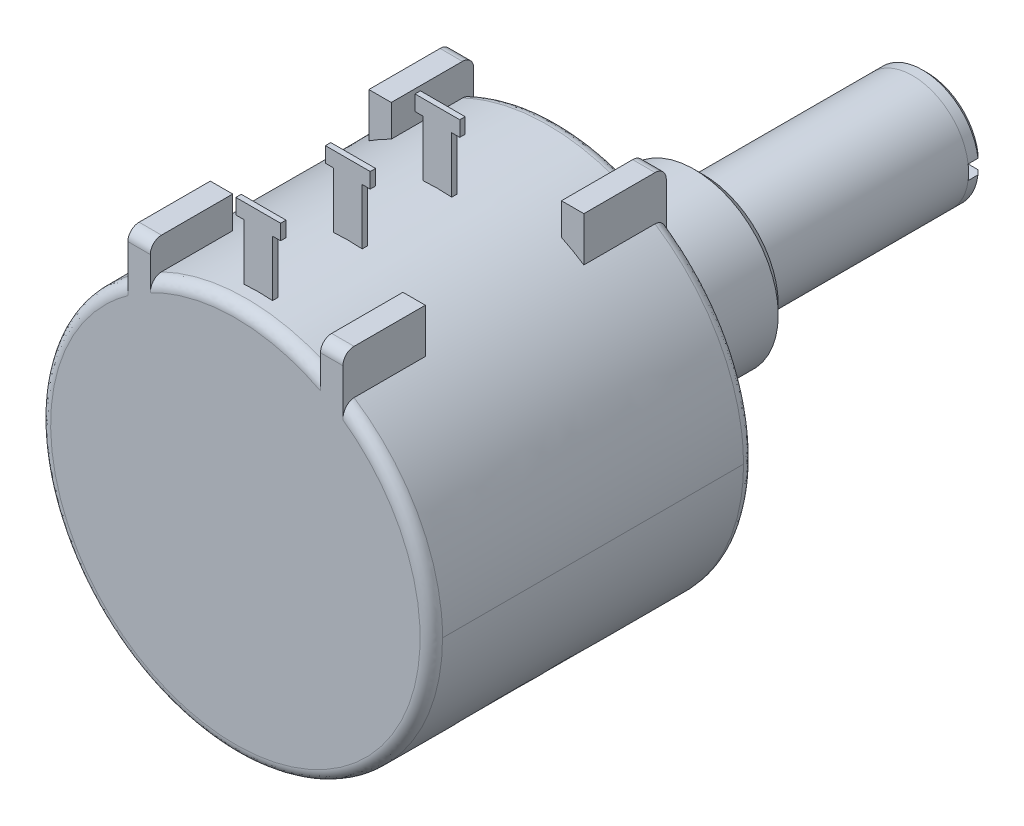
ISO-10303-21;
HEADER;
FILE_DESCRIPTION(('STEP AP214'),'2;1');
FILE_NAME('part.step','',(''),(''),'','','');
FILE_SCHEMA(('AUTOMOTIVE_DESIGN { 1 0 10303 214 1 1 1 1 }'));
ENDSEC;
DATA;
#1=APPLICATION_CONTEXT('core data for automotive mechanical design processes');
#2=APPLICATION_PROTOCOL_DEFINITION('international standard','automotive_design',2000,#1);
#3=PRODUCT_CONTEXT('',#1,'mechanical');
#4=PRODUCT('Part','Part','',(#3));
#5=PRODUCT_RELATED_PRODUCT_CATEGORY('part','',(#4));
#6=PRODUCT_DEFINITION_FORMATION('','',#4);
#7=PRODUCT_DEFINITION_CONTEXT('part definition',#1,'design');
#8=PRODUCT_DEFINITION('design','',#6,#7);
#9=PRODUCT_DEFINITION_SHAPE('','',#8);
#10=(LENGTH_UNIT() NAMED_UNIT(*) SI_UNIT(.MILLI.,.METRE.));
#11=(NAMED_UNIT(*) PLANE_ANGLE_UNIT() SI_UNIT($,.RADIAN.));
#12=(NAMED_UNIT(*) SI_UNIT($,.STERADIAN.) SOLID_ANGLE_UNIT());
#13=UNCERTAINTY_MEASURE_WITH_UNIT(LENGTH_MEASURE(1.E-05),#10,'distance_accuracy_value','');
#14=(GEOMETRIC_REPRESENTATION_CONTEXT(3) GLOBAL_UNCERTAINTY_ASSIGNED_CONTEXT((#13)) GLOBAL_UNIT_ASSIGNED_CONTEXT((#10,
#11,#12)) REPRESENTATION_CONTEXT('',''));
#15=CARTESIAN_POINT('',(0.,0.,0.));
#16=DIRECTION('',(0.,0.,1.));
#17=DIRECTION('',(1.,0.,0.));
#18=AXIS2_PLACEMENT_3D('',#15,#16,#17);
#19=CARTESIAN_POINT('',(0.,7.20127082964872E-13,-20.066));
#20=DIRECTION('',(0.,0.,1.));
#21=DIRECTION('',(1.,0.,0.));
#22=AXIS2_PLACEMENT_3D('',#19,#20,#21);
#23=PLANE('',#22);
#24=DIRECTION('',(-1.,0.,0.));
#25=VECTOR('',#24,1.);
#26=CARTESIAN_POINT('',(-3.1488829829,0.4064,-20.066));
#27=LINE('',#26,#25);
#28=CARTESIAN_POINT('',(3.14912656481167,0.406399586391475,-20.066));
#29=VERTEX_POINT('',#28);
#30=CARTESIAN_POINT('',(-3.14912728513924,0.406399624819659,-20.066));
#31=VERTEX_POINT('',#30);
#32=EDGE_CURVE('E423',#29,#31,#27,.T.);
#33=ORIENTED_EDGE('',*,*,#32,.F.);
#34=CARTESIAN_POINT('',(3.14936610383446,0.406430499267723,-20.066));
#35=CARTESIAN_POINT('',(3.15364671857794,0.372933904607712,-20.066));
#36=CARTESIAN_POINT('',(3.15738489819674,0.339368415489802,-20.066));
#37=CARTESIAN_POINT('',(3.16379589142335,0.272021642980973,-20.066));
#38=CARTESIAN_POINT('',(3.16646507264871,0.238240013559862,-20.066));
#39=CARTESIAN_POINT('',(3.17073816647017,0.170461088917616,-20.066));
#40=CARTESIAN_POINT('',(3.17233736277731,0.136463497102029,-20.066));
#41=CARTESIAN_POINT('',(3.17447042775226,0.0683106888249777,-20.066));
#42=CARTESIAN_POINT('',(3.17500037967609,0.0341553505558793,-20.066));
#43=CARTESIAN_POINT('',(3.1749996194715,-0.0342319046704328,-20.066));
#44=CARTESIAN_POINT('',(3.17446652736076,-0.0684638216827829,-20.066));
#45=CARTESIAN_POINT('',(3.17232298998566,-0.136660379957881,-20.066));
#46=CARTESIAN_POINT('',(3.17071991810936,-0.170625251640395,-20.066));
#47=CARTESIAN_POINT('',(3.16643946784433,-0.238345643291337,-20.066));
#48=CARTESIAN_POINT('',(3.16376658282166,-0.27210144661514,-20.066));
#49=CARTESIAN_POINT('',(3.15734840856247,-0.339403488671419,-20.066));
#50=CARTESIAN_POINT('',(3.15360652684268,-0.372950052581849,-20.066));
#51=CARTESIAN_POINT('',(3.14932267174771,-0.406427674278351,-20.066));
#52=B_SPLINE_CURVE_WITH_KNOTS('',3,(#34,#35,#36,#37,#38,#39,#40,#41,#42,#43,#44,#45,#46,#47,#48,
#49,#50,#51),.UNSPECIFIED.,.F.,.F.,(4,2,2,2,2,2,2,2,4),(0.,0.101301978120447,0.202945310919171,
0.305033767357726,0.407495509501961,0.510186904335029,0.612177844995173,0.713744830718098,
0.814991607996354),.UNSPECIFIED.);
#53=CARTESIAN_POINT('',(3.14910467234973,-0.406399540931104,-20.066));
#54=VERTEX_POINT('',#53);
#55=EDGE_CURVE('E435',#29,#54,#52,.T.);
#56=ORIENTED_EDGE('',*,*,#55,.T.);
#57=DIRECTION('',(1.,0.,0.));
#58=VECTOR('',#57,1.);
#59=CARTESIAN_POINT('',(3.1488829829,-0.406399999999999,-20.066));
#60=LINE('',#59,#58);
#61=CARTESIAN_POINT('',(-3.14910388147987,-0.40639953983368,-20.066));
#62=VERTEX_POINT('',#61);
#63=EDGE_CURVE('E428',#62,#54,#60,.T.);
#64=ORIENTED_EDGE('',*,*,#63,.F.);
#65=CARTESIAN_POINT('',(-3.14932110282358,-0.406427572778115,-20.066));
#66=CARTESIAN_POINT('',(-3.15360298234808,-0.372922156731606,-20.066));
#67=CARTESIAN_POINT('',(-3.15734291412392,-0.339347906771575,-20.066));
#68=CARTESIAN_POINT('',(-3.16375883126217,-0.271980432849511,-20.066));
#69=CARTESIAN_POINT('',(-3.16643108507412,-0.238186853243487,-20.066));
#70=CARTESIAN_POINT('',(-3.17071157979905,-0.170380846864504,-20.066));
#71=CARTESIAN_POINT('',(-3.17231500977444,-0.136368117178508,-20.066));
#72=CARTESIAN_POINT('',(-3.17445687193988,-0.0682370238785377,-20.066));
#73=CARTESIAN_POINT('',(-3.17499303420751,-0.0341185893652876,-20.066));
#74=CARTESIAN_POINT('',(-3.17500699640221,0.0342685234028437,-20.066));
#75=CARTESIAN_POINT('',(-3.17448013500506,0.0685372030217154,-20.066));
#76=CARTESIAN_POINT('',(-3.17234537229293,0.136755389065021,-20.066));
#77=CARTESIAN_POINT('',(-3.17074651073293,0.170705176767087,-20.066));
#78=CARTESIAN_POINT('',(-3.1664734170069,0.238398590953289,-20.066));
#79=CARTESIAN_POINT('',(-3.16380358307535,0.27214249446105,-20.066));
#80=CARTESIAN_POINT('',(-3.1573902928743,0.339423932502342,-20.066));
#81=CARTESIAN_POINT('',(-3.15365014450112,0.372961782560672,-20.066));
#82=CARTESIAN_POINT('',(-3.14936753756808,0.406430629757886,-20.066));
#83=B_SPLINE_CURVE_WITH_KNOTS('',3,(#65,#66,#67,#68,#69,#70,#71,#72,#73,#74,#75,#76,#77,#78,#79,
#80,#81,#82),.UNSPECIFIED.,.F.,.F.,(4,2,2,2,2,2,2,2,4),(0.,0.10132872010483,0.203008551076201,
0.305143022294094,0.407494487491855,0.510295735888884,0.612240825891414,0.71377146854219,
0.814991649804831),.UNSPECIFIED.);
#84=EDGE_CURVE('E449',#62,#31,#83,.T.);
#85=ORIENTED_EDGE('',*,*,#84,.T.);
#86=EDGE_LOOP('',(#33,#56,#64,#85));
#87=FACE_BOUND('',#86,.T.);
#88=ADVANCED_FACE('F53',(#87),#23,.F.);
#89=CARTESIAN_POINT('',(0.8128,-11.1145,17.0434));
#90=DIRECTION('',(1.,0.,0.));
#91=DIRECTION('',(0.,0.,-1.));
#92=AXIS2_PLACEMENT_3D('',#89,#90,#91);
#93=PLANE('',#92);
#94=DIRECTION('',(0.,1.,0.));
#95=VECTOR('',#94,1.);
#96=CARTESIAN_POINT('',(0.8128,-11.1145,16.7386));
#97=LINE('',#96,#95);
#98=CARTESIAN_POINT('',(0.812799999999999,11.0827348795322,16.7386));
#99=VERTEX_POINT('',#98);
#100=CARTESIAN_POINT('',(0.8128,14.2494,16.7386));
#101=VERTEX_POINT('',#100);
#102=EDGE_CURVE('E1834',#99,#101,#97,.T.);
#103=ORIENTED_EDGE('',*,*,#102,.T.);
#104=DIRECTION('',(0.,0.,-1.));
#105=VECTOR('',#104,1.);
#106=CARTESIAN_POINT('',(0.8128,14.2494,16.7386));
#107=LINE('',#106,#105);
#108=CARTESIAN_POINT('',(0.8128,14.2494,17.0434));
#109=VERTEX_POINT('',#108);
#110=EDGE_CURVE('E1785',#109,#101,#107,.T.);
#111=ORIENTED_EDGE('',*,*,#110,.F.);
#112=DIRECTION('',(0.,1.,0.));
#113=VECTOR('',#112,1.);
#114=CARTESIAN_POINT('',(0.8128,-11.1145,17.0434));
#115=LINE('',#114,#113);
#116=CARTESIAN_POINT('',(0.8128,11.0827348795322,17.0434));
#117=VERTEX_POINT('',#116);
#118=EDGE_CURVE('E1826',#117,#109,#115,.T.);
#119=ORIENTED_EDGE('',*,*,#118,.F.);
#120=DIRECTION('',(0.,0.,1.));
#121=VECTOR('',#120,1.);
#122=CARTESIAN_POINT('',(0.812799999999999,11.0827348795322,9.1694));
#123=LINE('',#122,#121);
#124=EDGE_CURVE('E1837',#99,#117,#123,.T.);
#125=ORIENTED_EDGE('',*,*,#124,.F.);
#126=EDGE_LOOP('',(#103,#111,#119,#125));
#127=FACE_BOUND('',#126,.T.);
#128=ADVANCED_FACE('F1688',(#127),#93,.T.);
#129=CARTESIAN_POINT('',(-0.8128,-11.1145,16.7386));
#130=DIRECTION('',(-1.,0.,0.));
#131=DIRECTION('',(0.,0.,1.));
#132=AXIS2_PLACEMENT_3D('',#129,#130,#131);
#133=PLANE('',#132);
#134=DIRECTION('',(0.,1.,0.));
#135=VECTOR('',#134,1.);
#136=CARTESIAN_POINT('',(-0.8128,-11.1145,17.0434));
#137=LINE('',#136,#135);
#138=CARTESIAN_POINT('',(-0.8128,11.0827348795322,17.0434));
#139=VERTEX_POINT('',#138);
#140=CARTESIAN_POINT('',(-0.8128,14.2494,17.0434));
#141=VERTEX_POINT('',#140);
#142=EDGE_CURVE('E1829',#139,#141,#137,.T.);
#143=ORIENTED_EDGE('',*,*,#142,.T.);
#144=DIRECTION('',(0.,0.,1.));
#145=VECTOR('',#144,1.);
#146=CARTESIAN_POINT('',(-0.8128,14.2494,17.0434));
#147=LINE('',#146,#145);
#148=CARTESIAN_POINT('',(-0.8128,14.2494,16.7386));
#149=VERTEX_POINT('',#148);
#150=EDGE_CURVE('E1803',#149,#141,#147,.T.);
#151=ORIENTED_EDGE('',*,*,#150,.F.);
#152=DIRECTION('',(0.,1.,0.));
#153=VECTOR('',#152,1.);
#154=CARTESIAN_POINT('',(-0.8128,-11.1145,16.7386));
#155=LINE('',#154,#153);
#156=CARTESIAN_POINT('',(-0.812799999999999,11.0827348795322,16.7386));
#157=VERTEX_POINT('',#156);
#158=EDGE_CURVE('E1831',#157,#149,#155,.T.);
#159=ORIENTED_EDGE('',*,*,#158,.F.);
#160=DIRECTION('',(0.,0.,1.));
#161=VECTOR('',#160,1.);
#162=CARTESIAN_POINT('',(-0.812799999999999,11.0827348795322,9.1694));
#163=LINE('',#162,#161);
#164=EDGE_CURVE('E1847',#139,#157,#163,.F.);
#165=ORIENTED_EDGE('',*,*,#164,.F.);
#166=EDGE_LOOP('',(#143,#151,#159,#165));
#167=FACE_BOUND('',#166,.T.);
#168=ADVANCED_FACE('F1693',(#167),#133,.T.);
#169=CARTESIAN_POINT('',(0.8128,-11.1145,11.9634));
#170=DIRECTION('',(1.,0.,0.));
#171=DIRECTION('',(0.,0.,-1.));
#172=AXIS2_PLACEMENT_3D('',#169,#170,#171);
#173=PLANE('',#172);
#174=DIRECTION('',(0.,1.,0.));
#175=VECTOR('',#174,1.);
#176=CARTESIAN_POINT('',(0.8128,-11.1145,11.6586));
#177=LINE('',#176,#175);
#178=CARTESIAN_POINT('',(0.812800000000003,11.0827348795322,11.6586));
#179=VERTEX_POINT('',#178);
#180=CARTESIAN_POINT('',(0.8128,14.2494,11.6586));
#181=VERTEX_POINT('',#180);
#182=EDGE_CURVE('E3235',#179,#181,#177,.T.);
#183=ORIENTED_EDGE('',*,*,#182,.T.);
#184=DIRECTION('',(0.,0.,-1.));
#185=VECTOR('',#184,1.);
#186=CARTESIAN_POINT('',(0.8128,14.2494,11.6586));
#187=LINE('',#186,#185);
#188=CARTESIAN_POINT('',(0.8128,14.2494,11.9634));
#189=VERTEX_POINT('',#188);
#190=EDGE_CURVE('E1846',#189,#181,#187,.T.);
#191=ORIENTED_EDGE('',*,*,#190,.F.);
#192=DIRECTION('',(0.,1.,0.));
#193=VECTOR('',#192,1.);
#194=CARTESIAN_POINT('',(0.8128,-11.1145,11.9634));
#195=LINE('',#194,#193);
#196=CARTESIAN_POINT('',(0.8128,11.0827348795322,11.9634));
#197=VERTEX_POINT('',#196);
#198=EDGE_CURVE('E3198',#197,#189,#195,.T.);
#199=ORIENTED_EDGE('',*,*,#198,.F.);
#200=DIRECTION('',(0.,0.,1.));
#201=VECTOR('',#200,1.);
#202=CARTESIAN_POINT('',(0.812800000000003,11.0827348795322,9.1694));
#203=LINE('',#202,#201);
#204=EDGE_CURVE('E3238',#179,#197,#203,.T.);
#205=ORIENTED_EDGE('',*,*,#204,.F.);
#206=EDGE_LOOP('',(#183,#191,#199,#205));
#207=FACE_BOUND('',#206,.T.);
#208=ADVANCED_FACE('F1880',(#207),#173,.T.);
#209=CARTESIAN_POINT('',(-0.8128,-11.1145,11.6586));
#210=DIRECTION('',(-1.,0.,0.));
#211=DIRECTION('',(0.,0.,1.));
#212=AXIS2_PLACEMENT_3D('',#209,#210,#211);
#213=PLANE('',#212);
#214=DIRECTION('',(0.,1.,0.));
#215=VECTOR('',#214,1.);
#216=CARTESIAN_POINT('',(-0.8128,-11.1145,11.9634));
#217=LINE('',#216,#215);
#218=CARTESIAN_POINT('',(-0.8128,11.0827348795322,11.9634));
#219=VERTEX_POINT('',#218);
#220=CARTESIAN_POINT('',(-0.8128,14.2494,11.9634));
#221=VERTEX_POINT('',#220);
#222=EDGE_CURVE('E3230',#219,#221,#217,.T.);
#223=ORIENTED_EDGE('',*,*,#222,.T.);
#224=DIRECTION('',(0.,0.,1.));
#225=VECTOR('',#224,1.);
#226=CARTESIAN_POINT('',(-0.8128,14.2494,11.9634));
#227=LINE('',#226,#225);
#228=CARTESIAN_POINT('',(-0.8128,14.2494,11.6586));
#229=VERTEX_POINT('',#228);
#230=EDGE_CURVE('E3200',#229,#221,#227,.T.);
#231=ORIENTED_EDGE('',*,*,#230,.F.);
#232=DIRECTION('',(0.,1.,0.));
#233=VECTOR('',#232,1.);
#234=CARTESIAN_POINT('',(-0.8128,-11.1145,11.6586));
#235=LINE('',#234,#233);
#236=CARTESIAN_POINT('',(-0.812799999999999,11.0827348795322,11.6586));
#237=VERTEX_POINT('',#236);
#238=EDGE_CURVE('E3232',#237,#229,#235,.T.);
#239=ORIENTED_EDGE('',*,*,#238,.F.);
#240=DIRECTION('',(0.,0.,1.));
#241=VECTOR('',#240,1.);
#242=CARTESIAN_POINT('',(-0.812799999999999,11.0827348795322,9.1694));
#243=LINE('',#242,#241);
#244=EDGE_CURVE('E3247',#219,#237,#243,.F.);
#245=ORIENTED_EDGE('',*,*,#244,.F.);
#246=EDGE_LOOP('',(#223,#231,#239,#245));
#247=FACE_BOUND('',#246,.T.);
#248=ADVANCED_FACE('F1685',(#247),#213,.T.);
#249=CARTESIAN_POINT('',(0.8128,-11.1145,6.8834));
#250=DIRECTION('',(1.,0.,0.));
#251=DIRECTION('',(0.,0.,-1.));
#252=AXIS2_PLACEMENT_3D('',#249,#250,#251);
#253=PLANE('',#252);
#254=DIRECTION('',(0.,1.,0.));
#255=VECTOR('',#254,1.);
#256=CARTESIAN_POINT('',(0.8128,-11.1145,6.5786));
#257=LINE('',#256,#255);
#258=CARTESIAN_POINT('',(0.812800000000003,11.0827348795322,6.5786));
#259=VERTEX_POINT('',#258);
#260=CARTESIAN_POINT('',(0.8128,14.2494,6.5786));
#261=VERTEX_POINT('',#260);
#262=EDGE_CURVE('E1638',#259,#261,#257,.T.);
#263=ORIENTED_EDGE('',*,*,#262,.T.);
#264=DIRECTION('',(0.,0.,-1.));
#265=VECTOR('',#264,1.);
#266=CARTESIAN_POINT('',(0.8128,14.2494,6.5786));
#267=LINE('',#266,#265);
#268=CARTESIAN_POINT('',(0.8128,14.2494,6.8834));
#269=VERTEX_POINT('',#268);
#270=EDGE_CURVE('E3246',#269,#261,#267,.T.);
#271=ORIENTED_EDGE('',*,*,#270,.F.);
#272=DIRECTION('',(0.,1.,0.));
#273=VECTOR('',#272,1.);
#274=CARTESIAN_POINT('',(0.8128,-11.1145,6.8834));
#275=LINE('',#274,#273);
#276=CARTESIAN_POINT('',(0.8128,11.0827348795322,6.8834));
#277=VERTEX_POINT('',#276);
#278=EDGE_CURVE('E3307',#277,#269,#275,.T.);
#279=ORIENTED_EDGE('',*,*,#278,.F.);
#280=DIRECTION('',(0.,0.,1.));
#281=VECTOR('',#280,1.);
#282=CARTESIAN_POINT('',(0.812800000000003,11.0827348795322,9.1694));
#283=LINE('',#282,#281);
#284=EDGE_CURVE('E1635',#259,#277,#283,.T.);
#285=ORIENTED_EDGE('',*,*,#284,.F.);
#286=EDGE_LOOP('',(#263,#271,#279,#285));
#287=FACE_BOUND('',#286,.T.);
#288=ADVANCED_FACE('F1656',(#287),#253,.T.);
#289=CARTESIAN_POINT('',(-0.8128,-11.1145,6.5786));
#290=DIRECTION('',(-1.,0.,0.));
#291=DIRECTION('',(0.,0.,1.));
#292=AXIS2_PLACEMENT_3D('',#289,#290,#291);
#293=PLANE('',#292);
#294=DIRECTION('',(0.,1.,0.));
#295=VECTOR('',#294,1.);
#296=CARTESIAN_POINT('',(-0.8128,-11.1145,6.8834));
#297=LINE('',#296,#295);
#298=CARTESIAN_POINT('',(-0.8128,11.0827348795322,6.8834));
#299=VERTEX_POINT('',#298);
#300=CARTESIAN_POINT('',(-0.8128,14.2494,6.8834));
#301=VERTEX_POINT('',#300);
#302=EDGE_CURVE('E3310',#299,#301,#297,.T.);
#303=ORIENTED_EDGE('',*,*,#302,.T.);
#304=DIRECTION('',(0.,0.,1.));
#305=VECTOR('',#304,1.);
#306=CARTESIAN_POINT('',(-0.8128,14.2494,6.8834));
#307=LINE('',#306,#305);
#308=CARTESIAN_POINT('',(-0.8128,14.2494,6.5786));
#309=VERTEX_POINT('',#308);
#310=EDGE_CURVE('E3284',#309,#301,#307,.T.);
#311=ORIENTED_EDGE('',*,*,#310,.F.);
#312=DIRECTION('',(0.,1.,0.));
#313=VECTOR('',#312,1.);
#314=CARTESIAN_POINT('',(-0.8128,-11.1145,6.5786));
#315=LINE('',#314,#313);
#316=CARTESIAN_POINT('',(-0.812799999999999,11.0827348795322,6.5786));
#317=VERTEX_POINT('',#316);
#318=EDGE_CURVE('E3311',#317,#309,#315,.T.);
#319=ORIENTED_EDGE('',*,*,#318,.F.);
#320=DIRECTION('',(0.,0.,1.));
#321=VECTOR('',#320,1.);
#322=CARTESIAN_POINT('',(-0.812799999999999,11.0827348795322,9.1694));
#323=LINE('',#322,#321);
#324=EDGE_CURVE('E1646',#299,#317,#323,.F.);
#325=ORIENTED_EDGE('',*,*,#324,.F.);
#326=EDGE_LOOP('',(#303,#311,#319,#325));
#327=FACE_BOUND('',#326,.T.);
#328=ADVANCED_FACE('F577',(#327),#293,.T.);
#329=CARTESIAN_POINT('',(-10.5356014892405,-10.4776599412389,0.));
#330=DIRECTION('',(0.,0.,1.));
#331=DIRECTION('',(1.,0.,0.));
#332=AXIS2_PLACEMENT_3D('',#329,#330,#331);
#333=PLANE('',#332);
#334=CARTESIAN_POINT('',(0.,-6.24066770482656E-13,0.));
#335=DIRECTION('',(0.,0.,1.));
#336=DIRECTION('',(1.,0.,0.));
#337=AXIS2_PLACEMENT_3D('',#334,#335,#336);
#338=CIRCLE('',#337,6.35000000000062);
#339=CARTESIAN_POINT('',(6.35000000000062,-6.24066770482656E-13,0.));
#340=VERTEX_POINT('',#339);
#341=EDGE_CURVE('E1578',#340,#340,#338,.F.);
#342=ORIENTED_EDGE('',*,*,#341,.F.);
#343=EDGE_LOOP('',(#342));
#344=FACE_BOUND('',#343,.T.);
#345=CARTESIAN_POINT('',(-6.25467115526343,9.18513717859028,0.635000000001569));
#346=CARTESIAN_POINT('',(-6.25467115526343,9.18513717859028,0.));
#347=CARTESIAN_POINT('',(-5.8972613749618,8.66027219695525,0.));
#348=CARTESIAN_POINT('',(-5.99571346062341,9.36151750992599,0.635000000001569));
#349=CARTESIAN_POINT('',(-5.99571346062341,9.36151750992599,0.));
#350=CARTESIAN_POINT('',(-5.65310126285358,8.82657365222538,0.));
#351=CARTESIAN_POINT('',(-5.72926193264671,9.52688770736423,0.635000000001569));
#352=CARTESIAN_POINT('',(-5.72926193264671,9.52688770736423,0.));
#353=CARTESIAN_POINT('',(-5.40187553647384,8.98249412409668,0.));
#354=CARTESIAN_POINT('',(-5.18324180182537,9.83461758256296,0.635000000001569));
#355=CARTESIAN_POINT('',(-5.18324180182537,9.83461758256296,0.));
#356=CARTESIAN_POINT('',(-4.88705655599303,9.2726394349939,0.));
#357=CARTESIAN_POINT('',(-4.90366785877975,9.97696778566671,0.635000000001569));
#358=CARTESIAN_POINT('',(-4.90366785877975,9.97696778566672,0.));
#359=CARTESIAN_POINT('',(-4.62345826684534,9.40685534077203,0.));
#360=CARTESIAN_POINT('',(-4.33523098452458,10.2367250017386,0.635000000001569));
#361=CARTESIAN_POINT('',(-4.33523098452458,10.2367250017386,0.));
#362=CARTESIAN_POINT('',(-4.08750349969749,9.65176928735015,0.));
#363=CARTESIAN_POINT('',(-4.04643523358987,10.3542790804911,0.635000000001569));
#364=CARTESIAN_POINT('',(-4.04643523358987,10.3542790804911,0.));
#365=CARTESIAN_POINT('',(-3.8152103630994,9.76260599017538,0.));
#366=CARTESIAN_POINT('',(-3.4601271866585,10.5646631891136,0.635000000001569));
#367=CARTESIAN_POINT('',(-3.4601271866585,10.5646631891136,0.));
#368=CARTESIAN_POINT('',(-3.26240563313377,9.96096814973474,0.));
#369=CARTESIAN_POINT('',(-3.16261930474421,10.6575055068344,0.635000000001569));
#370=CARTESIAN_POINT('',(-3.16261930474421,10.6575055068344,0.));
#371=CARTESIAN_POINT('',(-2.98189820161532,10.0485051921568,0.));
#372=CARTESIAN_POINT('',(-2.59595264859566,10.8085324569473,0.635000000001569));
#373=CARTESIAN_POINT('',(-2.59595264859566,10.8085324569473,0.));
#374=CARTESIAN_POINT('',(-2.44761249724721,10.1909020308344,0.));
#375=CARTESIAN_POINT('',(-2.32753032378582,10.8694950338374,0.635000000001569));
#376=CARTESIAN_POINT('',(-2.32753032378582,10.8694950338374,0.));
#377=CARTESIAN_POINT('',(-2.19452859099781,10.2483810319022,0.));
#378=CARTESIAN_POINT('',(-1.78667020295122,10.9713835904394,0.635000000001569));
#379=CARTESIAN_POINT('',(-1.78667020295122,10.9713835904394,0.));
#380=CARTESIAN_POINT('',(-1.6845747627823,10.3444473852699,0.));
#381=CARTESIAN_POINT('',(-1.51422915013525,11.0122922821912,0.635000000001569));
#382=CARTESIAN_POINT('',(-1.51422915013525,11.0122922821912,0.));
#383=CARTESIAN_POINT('',(-1.42770177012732,10.383018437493,0.));
#384=CARTESIAN_POINT('',(-0.930459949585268,11.0778745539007,0.635000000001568));
#385=CARTESIAN_POINT('',(-0.930459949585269,11.0778745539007,0.));
#386=CARTESIAN_POINT('',(-0.877290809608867,10.4448531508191,0.));
#387=CARTESIAN_POINT('',(-0.618801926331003,11.0996468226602,0.635000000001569));
#388=CARTESIAN_POINT('',(-0.618801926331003,11.0996468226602,0.));
#389=CARTESIAN_POINT('',(-0.583441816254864,10.4653812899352,0.));
#390=CARTESIAN_POINT('',(0.00535609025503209,11.1168855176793,0.635000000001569));
#391=CARTESIAN_POINT('',(0.00535609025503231,11.1168855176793,0.));
#392=CARTESIAN_POINT('',(0.00505002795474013,10.4816349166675,0.));
#393=CARTESIAN_POINT('',(0.317856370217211,11.1123414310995,0.635000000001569));
#394=CARTESIAN_POINT('',(0.317856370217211,11.1123414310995,0.));
#395=CARTESIAN_POINT('',(0.29969314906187,10.477350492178,0.));
#396=CARTESIAN_POINT('',(0.941694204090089,11.0769388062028,0.635000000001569));
#397=CARTESIAN_POINT('',(0.941694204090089,11.0769388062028,0.));
#398=CARTESIAN_POINT('',(0.887883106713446,10.4439708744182,0.));
#399=CARTESIAN_POINT('',(1.2530301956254,11.0460526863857,0.635000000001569));
#400=CARTESIAN_POINT('',(1.2530301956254,11.0460526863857,0.));
#401=CARTESIAN_POINT('',(1.1814284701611,10.4148496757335,0.));
#402=CARTESIAN_POINT('',(1.87209881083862,10.9581331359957,0.635000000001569));
#403=CARTESIAN_POINT('',(1.87209881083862,10.9581331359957,0.));
#404=CARTESIAN_POINT('',(1.76512173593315,10.3319540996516,0.));
#405=CARTESIAN_POINT('',(2.17983013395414,10.9010905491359,0.635000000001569));
#406=CARTESIAN_POINT('',(2.17983013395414,10.9010905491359,0.));
#407=CARTESIAN_POINT('',(2.05526841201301,10.278171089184,0.));
#408=CARTESIAN_POINT('',(2.78915264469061,10.7613154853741,0.635000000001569));
#409=CARTESIAN_POINT('',(2.78915264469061,10.7613154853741,0.));
#410=CARTESIAN_POINT('',(2.62977249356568,10.1463831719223,0.));
#411=CARTESIAN_POINT('',(3.09074837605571,10.6786028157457,0.635000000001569));
#412=CARTESIAN_POINT('',(3.09074837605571,10.6786028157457,0.));
#413=CARTESIAN_POINT('',(2.91413418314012,10.0683969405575,0.));
#414=CARTESIAN_POINT('',(3.68589875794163,10.4880615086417,0.635000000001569));
#415=CARTESIAN_POINT('',(3.68589875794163,10.4880615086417,0.));
#416=CARTESIAN_POINT('',(3.47527597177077,9.88874370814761,0.));
#417=CARTESIAN_POINT('',(3.97945341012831,10.3802328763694,0.635000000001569));
#418=CARTESIAN_POINT('',(3.97945341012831,10.3802328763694,0.));
#419=CARTESIAN_POINT('',(3.75205607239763,9.78707671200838,0.));
#420=CARTESIAN_POINT('',(4.55641737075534,10.1402333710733,0.635000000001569));
#421=CARTESIAN_POINT('',(4.55641737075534,10.1402333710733,0.));
#422=CARTESIAN_POINT('',(4.29605066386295,9.56079146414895,0.));
#423=CARTESIAN_POINT('',(4.83982726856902,10.0080639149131,0.635000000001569));
#424=CARTESIAN_POINT('',(4.83982726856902,10.0080639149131,0.));
#425=CARTESIAN_POINT('',(4.56326571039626,9.43617454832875,0.));
#426=CARTESIAN_POINT('',(5.39440821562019,9.72036858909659,0.635000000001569));
#427=CARTESIAN_POINT('',(5.39440821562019,9.72036858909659,0.));
#428=CARTESIAN_POINT('',(5.08615631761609,9.16491895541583,0.));
#429=CARTESIAN_POINT('',(5.66558348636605,9.56485085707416,0.635000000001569));
#430=CARTESIAN_POINT('',(5.66558348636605,9.56485085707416,0.));
#431=CARTESIAN_POINT('',(5.34183585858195,9.01828795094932,0.));
#432=CARTESIAN_POINT('',(6.1938131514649,9.23156732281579,0.635000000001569));
#433=CARTESIAN_POINT('',(6.1938131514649,9.23156732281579,0.));
#434=CARTESIAN_POINT('',(5.83988097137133,8.70404919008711,0.));
#435=CARTESIAN_POINT('',(6.45087072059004,9.05380655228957,0.635000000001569));
#436=CARTESIAN_POINT('',(6.45087072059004,9.05380655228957,0.));
#437=CARTESIAN_POINT('',(6.08224953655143,8.53644617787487,0.));
#438=CARTESIAN_POINT('',(6.94911092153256,8.67727116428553,0.635000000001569));
#439=CARTESIAN_POINT('',(6.94911092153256,8.67727116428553,0.));
#440=CARTESIAN_POINT('',(6.55201886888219,8.18142709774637,0.));
#441=CARTESIAN_POINT('',(7.19029332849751,8.47849624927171,0.635000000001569));
#442=CARTESIAN_POINT('',(7.19029332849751,8.47849624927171,0.));
#443=CARTESIAN_POINT('',(6.77941942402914,7.99401074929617,0.));
#444=CARTESIAN_POINT('',(7.65528819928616,8.06113295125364,0.635000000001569));
#445=CARTESIAN_POINT('',(7.65528819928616,8.06113295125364,0.));
#446=CARTESIAN_POINT('',(7.21784315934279,7.60049678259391,0.));
#447=CARTESIAN_POINT('',(7.87908328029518,7.84252520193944,0.635000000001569));
#448=CARTESIAN_POINT('',(7.87908328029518,7.84252520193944,0.));
#449=CARTESIAN_POINT('',(7.4288499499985,7.3943809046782,0.));
#450=CARTESIAN_POINT('',(8.30748542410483,7.38723574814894,0.635000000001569));
#451=CARTESIAN_POINT('',(8.30748542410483,7.38723574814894,0.));
#452=CARTESIAN_POINT('',(7.83277197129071,6.96510799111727,0.));
#453=CARTESIAN_POINT('',(8.51209158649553,7.15055319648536,0.635000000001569));
#454=CARTESIAN_POINT('',(8.51209158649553,7.15055319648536,0.));
#455=CARTESIAN_POINT('',(8.02568635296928,6.74195015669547,0.));
#456=CARTESIAN_POINT('',(8.70631573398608,6.90562977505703,0.635000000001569));
#457=CARTESIAN_POINT('',(8.70631573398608,6.90562977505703,0.));
#458=CARTESIAN_POINT('',(8.2088119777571,6.51102235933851,0.));
#459=(BOUNDED_SURFACE() B_SPLINE_SURFACE(3,2,((#345,#346,#347),(#348,#349,#350),(#351,#352,
#353),(#354,#355,#356),(#357,#358,#359),(#360,#361,#362),(#363,#364,#365),(#366,#367,#368),
(#369,#370,#371),(#372,#373,#374),(#375,#376,#377),(#378,#379,#380),(#381,#382,#383),(#384,#385,
#386),(#387,#388,#389),(#390,#391,#392),(#393,#394,#395),(#396,#397,#398),(#399,#400,#401),
(#402,#403,#404),(#405,#406,#407),(#408,#409,#410),(#411,#412,#413),(#414,#415,#416),(#417,#418,
#419),(#420,#421,#422),(#423,#424,#425),(#426,#427,#428),(#429,#430,#431),(#432,#433,#434),
(#435,#436,#437),(#438,#439,#440),(#441,#442,#443),(#444,#445,#446),(#447,#448,#449),(#450,#451,
#452),(#453,#454,#455),(#456,#457,#458)),.UNSPECIFIED.,.F.,.F.,
.F.) B_SPLINE_SURFACE_WITH_KNOTS((4,2,2,2,2,2,2,2,2,2,2,2,2,2,2,2,2,2,4),(3,3),(0.,
0.885978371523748,1.77232047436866,2.65324790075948,3.53373646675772,4.31162084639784,
5.09017464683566,5.97280406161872,6.85578609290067,7.73969378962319,8.62391114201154,
9.50744791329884,10.3909845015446,11.2744696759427,12.1576476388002,13.0406261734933,
13.9236172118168,14.807479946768,15.6913841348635),(0.,1.),
.UNSPECIFIED.) GEOMETRIC_REPRESENTATION_ITEM() RATIONAL_B_SPLINE_SURFACE(((1.,0.707106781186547,
1.),(1.,0.707106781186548,1.),(1.,0.707106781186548,1.),(1.,0.707106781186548,1.),(1.,
0.707106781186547,1.),(1.,0.707106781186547,1.),(1.,0.707106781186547,1.),(1.,0.707106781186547,
1.),(1.,0.707106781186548,1.),(1.,0.707106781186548,1.),(1.,0.707106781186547,1.),(1.,
0.707106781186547,1.),(1.,0.707106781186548,1.),(1.,0.707106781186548,1.),(1.,0.707106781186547,
1.),(1.,0.707106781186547,1.),(1.,0.707106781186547,1.),(1.,0.707106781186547,1.),(1.,
0.707106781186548,1.),(1.,0.707106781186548,1.),(1.,0.707106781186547,1.),(1.,0.707106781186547,
1.),(1.,0.707106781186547,1.),(1.,0.707106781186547,1.),(1.,0.707106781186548,1.),(1.,
0.707106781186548,1.),(1.,0.707106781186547,1.),(1.,0.707106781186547,1.),(1.,0.707106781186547,
1.),(1.,0.707106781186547,1.),(1.,0.707106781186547,1.),(1.,0.707106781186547,1.),(1.,
0.707106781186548,1.),(1.,0.707106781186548,1.),(1.,0.707106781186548,1.),(1.,0.707106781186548,
1.),(1.,0.707106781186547,1.),(1.,0.707106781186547,1.))) REPRESENTATION_ITEM('') SURFACE());
#460=CARTESIAN_POINT('',(-5.8972613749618,8.66027219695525,0.));
#461=CARTESIAN_POINT('',(-5.65310126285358,8.82657365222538,0.));
#462=CARTESIAN_POINT('',(-5.40187553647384,8.98249412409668,0.));
#463=CARTESIAN_POINT('',(-4.88705655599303,9.2726394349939,0.));
#464=CARTESIAN_POINT('',(-4.62345826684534,9.40685534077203,0.));
#465=CARTESIAN_POINT('',(-4.08750349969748,9.65176928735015,0.));
#466=CARTESIAN_POINT('',(-3.8152103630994,9.76260599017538,0.));
#467=CARTESIAN_POINT('',(-3.26240563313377,9.96096814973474,0.));
#468=CARTESIAN_POINT('',(-2.98189820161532,10.0485051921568,0.));
#469=CARTESIAN_POINT('',(-2.44761249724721,10.1909020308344,0.));
#470=CARTESIAN_POINT('',(-2.19452859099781,10.2483810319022,0.));
#471=CARTESIAN_POINT('',(-1.6845747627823,10.3444473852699,0.));
#472=CARTESIAN_POINT('',(-1.42770177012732,10.383018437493,0.));
#473=CARTESIAN_POINT('',(-0.877290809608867,10.4448531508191,0.));
#474=CARTESIAN_POINT('',(-0.583441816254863,10.4653812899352,0.));
#475=CARTESIAN_POINT('',(0.00505002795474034,10.4816349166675,0.));
#476=CARTESIAN_POINT('',(0.29969314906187,10.477350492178,0.));
#477=CARTESIAN_POINT('',(0.887883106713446,10.4439708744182,0.));
#478=CARTESIAN_POINT('',(1.18142847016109,10.4148496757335,0.));
#479=CARTESIAN_POINT('',(1.76512173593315,10.3319540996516,0.));
#480=CARTESIAN_POINT('',(2.05526841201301,10.278171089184,0.));
#481=CARTESIAN_POINT('',(2.62977249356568,10.1463831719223,0.));
#482=CARTESIAN_POINT('',(2.91413418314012,10.0683969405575,0.));
#483=CARTESIAN_POINT('',(3.47527597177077,9.88874370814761,0.));
#484=CARTESIAN_POINT('',(3.75205607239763,9.78707671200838,0.));
#485=CARTESIAN_POINT('',(4.29605066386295,9.56079146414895,0.));
#486=CARTESIAN_POINT('',(4.56326571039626,9.43617454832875,0.));
#487=CARTESIAN_POINT('',(5.08615631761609,9.16491895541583,0.));
#488=CARTESIAN_POINT('',(5.34183585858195,9.01828795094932,0.));
#489=CARTESIAN_POINT('',(5.83988097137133,8.70404919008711,0.));
#490=CARTESIAN_POINT('',(6.08224953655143,8.53644617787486,0.));
#491=CARTESIAN_POINT('',(6.55201886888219,8.18142709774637,0.));
#492=CARTESIAN_POINT('',(6.77941942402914,7.99401074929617,0.));
#493=CARTESIAN_POINT('',(7.21784315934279,7.60049678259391,0.));
#494=CARTESIAN_POINT('',(7.4288499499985,7.3943809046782,0.));
#495=CARTESIAN_POINT('',(7.83277197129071,6.96510799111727,0.));
#496=CARTESIAN_POINT('',(8.02568635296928,6.74195015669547,0.));
#497=CARTESIAN_POINT('',(8.2088119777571,6.51102235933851,0.));
#498=B_SPLINE_CURVE_WITH_KNOTS('',3,(#460,#461,#462,#463,#464,#465,#466,#467,#468,#469,#470,
#471,#472,#473,#474,#475,#476,#477,#478,#479,#480,#481,#482,#483,#484,#485,#486,#487,#488,#489,
#490,#491,#492,#493,#494,#495,#496,#497),.UNSPECIFIED.,.F.,.F.,(4,2,2,2,2,2,2,2,2,2,2,2,2,2,2,2,
2,2,4),(0.,0.885978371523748,1.77232047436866,2.65324790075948,3.53373646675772,
4.31162084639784,5.09017464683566,5.97280406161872,6.85578609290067,7.73969378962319,
8.62391114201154,9.50744791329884,10.3909845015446,11.2744696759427,12.1576476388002,
13.0406261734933,13.9236172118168,14.807479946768,15.6913841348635),.UNSPECIFIED.);
#499=CARTESIAN_POINT('',(-4.826,9.29987796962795,0.));
#500=VERTEX_POINT('',#499);
#501=CARTESIAN_POINT('',(4.82600000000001,9.29987796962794,0.));
#502=VERTEX_POINT('',#501);
#503=EDGE_CURVE('E1992',#500,#502,#498,.T.);
#504=ORIENTED_EDGE('',*,*,#503,.T.);
#505=DIRECTION('',(0.,-1.,0.));
#506=VECTOR('',#505,1.);
#507=CARTESIAN_POINT('',(4.826,11.811,0.));
#508=LINE('',#507,#506);
#509=CARTESIAN_POINT('',(4.826,11.1759999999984,0.));
#510=VERTEX_POINT('',#509);
#511=EDGE_CURVE('E1613',#510,#502,#508,.T.);
#512=ORIENTED_EDGE('',*,*,#511,.F.);
#513=DIRECTION('',(-1.,0.,0.));
#514=VECTOR('',#513,1.);
#515=CARTESIAN_POINT('',(-10.5356014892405,11.1759999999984,0.));
#516=LINE('',#515,#514);
#517=CARTESIAN_POINT('',(6.096,11.1759999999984,0.));
#518=VERTEX_POINT('',#517);
#519=EDGE_CURVE('E1974',#510,#518,#516,.F.);
#520=ORIENTED_EDGE('',*,*,#519,.T.);
#521=DIRECTION('',(0.,1.,0.));
#522=VECTOR('',#521,1.);
#523=CARTESIAN_POINT('',(6.096,0.349670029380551,0.));
#524=LINE('',#523,#522);
#525=CARTESIAN_POINT('',(6.09599999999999,8.52154858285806,0.));
#526=VERTEX_POINT('',#525);
#527=EDGE_CURVE('E950',#526,#518,#524,.T.);
#528=ORIENTED_EDGE('',*,*,#527,.F.);
#529=CARTESIAN_POINT('',(-5.45762098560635,8.94384589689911,0.));
#530=CARTESIAN_POINT('',(-14.201224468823,3.60841476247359,0.));
#531=CARTESIAN_POINT('',(-11.7708564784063,-5.24966003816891,0.));
#532=CARTESIAN_POINT('',(-5.29370841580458,-9.04182821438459,0.));
#533=CARTESIAN_POINT('',(11.9429902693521,-19.1333777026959,0.));
#534=CARTESIAN_POINT('',(22.9858191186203,-2.12603186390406,0.));
#535=CARTESIAN_POINT('',(5.59524319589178,8.85840052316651,0.));
#536=(BOUNDED_CURVE() B_SPLINE_CURVE(3,(#529,#530,#531,#532,#533,#534,#535),.UNSPECIFIED.,.F.,
.F.) B_SPLINE_CURVE_WITH_KNOTS((4,3,4),(0.373579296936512,1.,1.98478964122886),
.UNSPECIFIED.) CURVE() GEOMETRIC_REPRESENTATION_ITEM() RATIONAL_B_SPLINE_CURVE((1.24626067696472,
0.99953956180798,1.36407598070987,2.3398699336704,0.805834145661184,0.782500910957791,2.26987022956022)) REPRESENTATION_ITEM(''));
#537=CARTESIAN_POINT('',(-6.09600000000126,8.52154858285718,0.));
#538=VERTEX_POINT('',#537);
#539=EDGE_CURVE('E1569',#538,#526,#536,.T.);
#540=ORIENTED_EDGE('',*,*,#539,.F.);
#541=DIRECTION('',(0.,-1.,0.));
#542=VECTOR('',#541,1.);
#543=CARTESIAN_POINT('',(-6.096,0.349670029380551,0.));
#544=LINE('',#543,#542);
#545=CARTESIAN_POINT('',(-6.096,11.1759999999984,0.));
#546=VERTEX_POINT('',#545);
#547=EDGE_CURVE('E1428',#546,#538,#544,.T.);
#548=ORIENTED_EDGE('',*,*,#547,.F.);
#549=DIRECTION('',(-1.,0.,0.));
#550=VECTOR('',#549,1.);
#551=CARTESIAN_POINT('',(-10.5356014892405,11.1759999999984,0.));
#552=LINE('',#551,#550);
#553=CARTESIAN_POINT('',(-4.826,11.1759999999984,0.));
#554=VERTEX_POINT('',#553);
#555=EDGE_CURVE('E1986',#546,#554,#552,.F.);
#556=ORIENTED_EDGE('',*,*,#555,.T.);
#557=DIRECTION('',(0.,-1.,0.));
#558=VECTOR('',#557,1.);
#559=CARTESIAN_POINT('',(-4.826,11.1124992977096,0.));
#560=LINE('',#559,#558);
#561=EDGE_CURVE('E1592',#554,#500,#560,.T.);
#562=ORIENTED_EDGE('',*,*,#561,.T.);
#563=EDGE_LOOP('',(#504,#512,#520,#528,#540,#548,#556,#562));
#564=FACE_BOUND('',#563,.T.);
#565=ADVANCED_FACE('F572',(#344,#564),#333,.F.);
#566=CARTESIAN_POINT('',(-4.825,9.2902023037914,4.6736));
#567=DIRECTION('',(0.,0.,-1.));
#568=DIRECTION('',(-1.,0.,0.));
#569=AXIS2_PLACEMENT_3D('',#566,#567,#568);
#570=PLANE('',#569);
#571=CARTESIAN_POINT('',(-4.82600000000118,10.0098641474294,4.6736));
#572=CARTESIAN_POINT('',(-5.04553941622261,9.90399968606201,4.6736));
#573=CARTESIAN_POINT('',(-5.2611424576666,9.79117896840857,4.6736));
#574=CARTESIAN_POINT('',(-5.68447579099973,9.5516250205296,4.6736));
#575=CARTESIAN_POINT('',(-5.89220608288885,9.42489179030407,4.6736));
#576=CARTESIAN_POINT('',(-6.09600000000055,9.2912023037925,4.6736));
#577=B_SPLINE_CURVE_WITH_KNOTS('',3,(#571,#572,#573,#574,#575,#576),.UNSPECIFIED.,.F.,.F.,(4,2,
4),(0.,0.730012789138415,1.46002557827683),.UNSPECIFIED.);
#578=CARTESIAN_POINT('',(-4.82600000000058,10.0098641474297,4.6736));
#579=VERTEX_POINT('',#578);
#580=CARTESIAN_POINT('',(-6.09600000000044,9.29120230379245,4.6736));
#581=VERTEX_POINT('',#580);
#582=EDGE_CURVE('E739',#579,#581,#577,.T.);
#583=ORIENTED_EDGE('',*,*,#582,.F.);
#584=DIRECTION('',(0.,-1.,0.));
#585=VECTOR('',#584,1.);
#586=CARTESIAN_POINT('',(-4.826,11.1124992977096,4.6736));
#587=LINE('',#586,#585);
#588=CARTESIAN_POINT('',(-4.826,11.811,4.6736));
#589=VERTEX_POINT('',#588);
#590=EDGE_CURVE('E1121',#589,#579,#587,.T.);
#591=ORIENTED_EDGE('',*,*,#590,.F.);
#592=DIRECTION('',(1.,0.,0.));
#593=VECTOR('',#592,1.);
#594=CARTESIAN_POINT('',(-4.826,11.811,4.6736));
#595=LINE('',#594,#593);
#596=CARTESIAN_POINT('',(-6.096,11.811,4.6736));
#597=VERTEX_POINT('',#596);
#598=EDGE_CURVE('E1608',#597,#589,#595,.T.);
#599=ORIENTED_EDGE('',*,*,#598,.F.);
#600=DIRECTION('',(0.,1.,0.));
#601=VECTOR('',#600,1.);
#602=CARTESIAN_POINT('',(-6.096,10.161774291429,4.6736));
#603=LINE('',#602,#601);
#604=EDGE_CURVE('E2068',#581,#597,#603,.T.);
#605=ORIENTED_EDGE('',*,*,#604,.F.);
#606=EDGE_LOOP('',(#583,#591,#599,#605));
#607=FACE_BOUND('',#606,.T.);
#608=ADVANCED_FACE('F576',(#607),#570,.F.);
#609=CARTESIAN_POINT('',(-6.096,8.51154858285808,4.6746));
#610=DIRECTION('',(-1.,0.,0.));
#611=DIRECTION('',(0.,1.,0.));
#612=AXIS2_PLACEMENT_3D('',#609,#610,#611);
#613=PLANE('',#612);
#614=DIRECTION('',(0.,0.,1.));
#615=VECTOR('',#614,1.);
#616=CARTESIAN_POINT('',(-6.096,11.811,4.6736));
#617=LINE('',#616,#615);
#618=CARTESIAN_POINT('',(-6.096,11.811,0.635000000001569));
#619=VERTEX_POINT('',#618);
#620=EDGE_CURVE('E1611',#619,#597,#617,.T.);
#621=ORIENTED_EDGE('',*,*,#620,.F.);
#622=CARTESIAN_POINT('',(-6.096,11.1759999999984,0.635000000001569));
#623=DIRECTION('',(-1.,0.,0.));
#624=DIRECTION('',(0.,0.,1.));
#625=AXIS2_PLACEMENT_3D('',#622,#623,#624);
#626=CIRCLE('',#625,0.635000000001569);
#627=EDGE_CURVE('E2010',#619,#546,#626,.T.);
#628=ORIENTED_EDGE('',*,*,#627,.T.);
#629=ORIENTED_EDGE('',*,*,#547,.T.);
#630=CARTESIAN_POINT('',(-6.096,8.52154858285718,0.));
#631=CARTESIAN_POINT('',(-6.096,8.54848026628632,1.32626497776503E-06));
#632=CARTESIAN_POINT('',(-6.096,8.57541527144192,0.00113357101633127));
#633=CARTESIAN_POINT('',(-6.096,8.62906769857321,0.00568933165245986));
#634=CARTESIAN_POINT('',(-6.096,8.65578528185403,0.00911095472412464));
#635=CARTESIAN_POINT('',(-6.096,8.7089679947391,0.0182997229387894));
#636=CARTESIAN_POINT('',(-6.096,8.73543096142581,0.0240795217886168));
#637=CARTESIAN_POINT('',(-6.096,8.78775738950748,0.0380277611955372));
#638=CARTESIAN_POINT('',(-6.096,8.81361992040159,0.0461996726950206));
#639=CARTESIAN_POINT('',(-6.096,8.87949479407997,0.070517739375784));
#640=CARTESIAN_POINT('',(-6.096,8.91884334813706,0.088523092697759));
#641=CARTESIAN_POINT('',(-6.096,8.99402208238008,0.130719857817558));
#642=CARTESIAN_POINT('',(-6.096,9.02985819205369,0.1549005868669));
#643=CARTESIAN_POINT('',(-6.096,9.09118991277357,0.204917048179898));
#644=CARTESIAN_POINT('',(-6.096,9.11742010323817,0.22984933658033));
#645=CARTESIAN_POINT('',(-6.096,9.16543757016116,0.28373191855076));
#646=CARTESIAN_POINT('',(-6.096,9.18722368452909,0.312683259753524));
#647=CARTESIAN_POINT('',(-6.096,9.22541086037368,0.37426464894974));
#648=CARTESIAN_POINT('',(-6.096,9.24177125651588,0.4069201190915));
#649=CARTESIAN_POINT('',(-6.096,9.26784470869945,0.474762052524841));
#650=CARTESIAN_POINT('',(-6.096,9.27757248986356,0.50994271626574));
#651=CARTESIAN_POINT('',(-6.096,9.28616210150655,0.56044768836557));
#652=CARTESIAN_POINT('',(-6.096,9.2880502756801,0.575302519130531));
#653=CARTESIAN_POINT('',(-6.096,9.29056959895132,0.605101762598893));
#654=CARTESIAN_POINT('',(-6.096,9.29120213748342,0.620046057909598));
#655=CARTESIAN_POINT('',(-6.096,9.29120230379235,0.635));
#656=B_SPLINE_CURVE_WITH_KNOTS('',3,(#630,#631,#632,#633,#634,#635,#636,#637,#638,#639,#640,
#641,#642,#643,#644,#645,#646,#647,#648,#649,#650,#651,#652,#653,#654,#655),.UNSPECIFIED.,.F.,
.F.,(4,2,2,2,2,2,2,2,2,2,2,2,4),(0.,0.0807760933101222,0.161485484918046,0.242633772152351,
0.323900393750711,0.45316110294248,0.582199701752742,0.690324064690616,0.798476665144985,
0.907422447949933,1.01612556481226,1.06100478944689,1.10583432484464),.UNSPECIFIED.);
#657=CARTESIAN_POINT('',(-6.09600000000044,9.2912023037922,0.635));
#658=VERTEX_POINT('',#657);
#659=EDGE_CURVE('E1038',#538,#658,#656,.T.);
#660=ORIENTED_EDGE('',*,*,#659,.T.);
#661=DIRECTION('',(0.,0.,-1.));
#662=VECTOR('',#661,1.);
#663=CARTESIAN_POINT('',(-6.09600000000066,9.29120230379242,9.1694));
#664=LINE('',#663,#662);
#665=EDGE_CURVE('E2071',#581,#658,#664,.T.);
#666=ORIENTED_EDGE('',*,*,#665,.F.);
#667=ORIENTED_EDGE('',*,*,#604,.T.);
#668=EDGE_LOOP('',(#621,#628,#629,#660,#666,#667));
#669=FACE_BOUND('',#668,.T.);
#670=ADVANCED_FACE('F1049',(#669),#613,.T.);
#671=CARTESIAN_POINT('',(-10.5356014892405,-10.4776599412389,18.3388));
#672=DIRECTION('',(0.,0.,1.));
#673=DIRECTION('',(1.,0.,0.));
#674=AXIS2_PLACEMENT_3D('',#671,#672,#673);
#675=PLANE('',#674);
#676=CARTESIAN_POINT('',(6.25467115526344,9.18513717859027,17.7037999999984));
#677=CARTESIAN_POINT('',(6.25467115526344,9.18513717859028,18.3388));
#678=CARTESIAN_POINT('',(5.89726137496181,8.66027219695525,18.3388));
#679=CARTESIAN_POINT('',(5.99571346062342,9.36151750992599,17.7037999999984));
#680=CARTESIAN_POINT('',(5.99571346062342,9.36151750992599,18.3388));
#681=CARTESIAN_POINT('',(5.65310126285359,8.82657365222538,18.3388));
#682=CARTESIAN_POINT('',(5.72926193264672,9.52688770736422,17.7037999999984));
#683=CARTESIAN_POINT('',(5.72926193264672,9.52688770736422,18.3388));
#684=CARTESIAN_POINT('',(5.40187553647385,8.98249412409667,18.3388));
#685=CARTESIAN_POINT('',(5.18324180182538,9.83461758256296,17.7037999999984));
#686=CARTESIAN_POINT('',(5.18324180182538,9.83461758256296,18.3388));
#687=CARTESIAN_POINT('',(4.88705655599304,9.27263943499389,18.3388));
#688=CARTESIAN_POINT('',(4.90366785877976,9.97696778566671,17.7037999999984));
#689=CARTESIAN_POINT('',(4.90366785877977,9.97696778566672,18.3388));
#690=CARTESIAN_POINT('',(4.62345826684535,9.40685534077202,18.3388));
#691=CARTESIAN_POINT('',(4.33523098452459,10.2367250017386,17.7037999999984));
#692=CARTESIAN_POINT('',(4.33523098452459,10.2367250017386,18.3388));
#693=CARTESIAN_POINT('',(4.08750349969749,9.65176928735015,18.3388));
#694=CARTESIAN_POINT('',(4.04643523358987,10.3542790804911,17.7037999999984));
#695=CARTESIAN_POINT('',(4.04643523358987,10.3542790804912,18.3388));
#696=CARTESIAN_POINT('',(3.81521036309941,9.76260599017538,18.3388));
#697=CARTESIAN_POINT('',(3.4601271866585,10.5646631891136,17.7037999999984));
#698=CARTESIAN_POINT('',(3.4601271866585,10.5646631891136,18.3388));
#699=CARTESIAN_POINT('',(3.26240563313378,9.96096814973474,18.3388));
#700=CARTESIAN_POINT('',(3.16261930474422,10.6575055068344,17.7037999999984));
#701=CARTESIAN_POINT('',(3.16261930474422,10.6575055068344,18.3388));
#702=CARTESIAN_POINT('',(2.98189820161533,10.0485051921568,18.3388));
#703=CARTESIAN_POINT('',(2.59595264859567,10.8085324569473,17.7037999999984));
#704=CARTESIAN_POINT('',(2.59595264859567,10.8085324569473,18.3388));
#705=CARTESIAN_POINT('',(2.44761249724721,10.1909020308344,18.3388));
#706=CARTESIAN_POINT('',(2.32753032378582,10.8694950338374,17.7037999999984));
#707=CARTESIAN_POINT('',(2.32753032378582,10.8694950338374,18.3388));
#708=CARTESIAN_POINT('',(2.19452859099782,10.2483810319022,18.3388));
#709=CARTESIAN_POINT('',(1.78667020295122,10.9713835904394,17.7037999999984));
#710=CARTESIAN_POINT('',(1.78667020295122,10.9713835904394,18.3388));
#711=CARTESIAN_POINT('',(1.68457476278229,10.34444738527,18.3388));
#712=CARTESIAN_POINT('',(1.51422915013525,11.0122922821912,17.7037999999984));
#713=CARTESIAN_POINT('',(1.51422915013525,11.0122922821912,18.3388));
#714=CARTESIAN_POINT('',(1.42770177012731,10.383018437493,18.3388));
#715=CARTESIAN_POINT('',(0.930459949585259,11.0778745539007,17.7037999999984));
#716=CARTESIAN_POINT('',(0.930459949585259,11.0778745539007,18.3388));
#717=CARTESIAN_POINT('',(0.877290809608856,10.4448531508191,18.3388));
#718=CARTESIAN_POINT('',(0.618801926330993,11.0996468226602,17.7037999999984));
#719=CARTESIAN_POINT('',(0.618801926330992,11.0996468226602,18.3388));
#720=CARTESIAN_POINT('',(0.583441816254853,10.4653812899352,18.3388));
#721=CARTESIAN_POINT('',(-0.00535609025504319,11.1168855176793,17.7037999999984));
#722=CARTESIAN_POINT('',(-0.00535609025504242,11.1168855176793,18.3388));
#723=CARTESIAN_POINT('',(-0.00505002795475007,10.4816349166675,18.3388));
#724=CARTESIAN_POINT('',(-0.317856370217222,11.1123414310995,17.7037999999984));
#725=CARTESIAN_POINT('',(-0.317856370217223,11.1123414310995,18.3388));
#726=CARTESIAN_POINT('',(-0.299693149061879,10.477350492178,18.3388));
#727=CARTESIAN_POINT('',(-0.9416942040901,11.0769388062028,17.7037999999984));
#728=CARTESIAN_POINT('',(-0.941694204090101,11.0769388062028,18.3388));
#729=CARTESIAN_POINT('',(-0.887883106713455,10.4439708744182,18.3388));
#730=CARTESIAN_POINT('',(-1.25303019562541,11.0460526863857,17.7037999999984));
#731=CARTESIAN_POINT('',(-1.25303019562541,11.0460526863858,18.3388));
#732=CARTESIAN_POINT('',(-1.1814284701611,10.4148496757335,18.3388));
#733=CARTESIAN_POINT('',(-1.87209881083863,10.9581331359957,17.7037999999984));
#734=CARTESIAN_POINT('',(-1.87209881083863,10.9581331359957,18.3388));
#735=CARTESIAN_POINT('',(-1.76512173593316,10.3319540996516,18.3388));
#736=CARTESIAN_POINT('',(-2.17983013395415,10.9010905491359,17.7037999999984));
#737=CARTESIAN_POINT('',(-2.17983013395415,10.9010905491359,18.3388));
#738=CARTESIAN_POINT('',(-2.05526841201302,10.278171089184,18.3388));
#739=CARTESIAN_POINT('',(-2.78915264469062,10.7613154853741,17.7037999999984));
#740=CARTESIAN_POINT('',(-2.78915264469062,10.7613154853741,18.3388));
#741=CARTESIAN_POINT('',(-2.62977249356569,10.1463831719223,18.3388));
#742=CARTESIAN_POINT('',(-3.09074837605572,10.6786028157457,17.7037999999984));
#743=CARTESIAN_POINT('',(-3.09074837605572,10.6786028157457,18.3388));
#744=CARTESIAN_POINT('',(-2.91413418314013,10.0683969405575,18.3388));
#745=CARTESIAN_POINT('',(-3.68589875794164,10.4880615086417,17.7037999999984));
#746=CARTESIAN_POINT('',(-3.68589875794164,10.4880615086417,18.3388));
#747=CARTESIAN_POINT('',(-3.47527597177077,9.88874370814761,18.3388));
#748=CARTESIAN_POINT('',(-3.97945341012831,10.3802328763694,17.7037999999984));
#749=CARTESIAN_POINT('',(-3.97945341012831,10.3802328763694,18.3388));
#750=CARTESIAN_POINT('',(-3.75205607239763,9.78707671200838,18.3388));
#751=CARTESIAN_POINT('',(-4.55641737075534,10.1402333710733,17.7037999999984));
#752=CARTESIAN_POINT('',(-4.55641737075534,10.1402333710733,18.3388));
#753=CARTESIAN_POINT('',(-4.29605066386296,9.56079146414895,18.3388));
#754=CARTESIAN_POINT('',(-4.83982726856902,10.0080639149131,17.7037999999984));
#755=CARTESIAN_POINT('',(-4.83982726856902,10.0080639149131,18.3388));
#756=CARTESIAN_POINT('',(-4.56326571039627,9.43617454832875,18.3388));
#757=CARTESIAN_POINT('',(-5.39440821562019,9.72036858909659,17.7037999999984));
#758=CARTESIAN_POINT('',(-5.39440821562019,9.72036858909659,18.3388));
#759=CARTESIAN_POINT('',(-5.0861563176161,9.16491895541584,18.3388));
#760=CARTESIAN_POINT('',(-5.66558348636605,9.56485085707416,17.7037999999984));
#761=CARTESIAN_POINT('',(-5.66558348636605,9.56485085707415,18.3388));
#762=CARTESIAN_POINT('',(-5.34183585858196,9.01828795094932,18.3388));
#763=CARTESIAN_POINT('',(-6.1938131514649,9.23156732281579,17.7037999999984));
#764=CARTESIAN_POINT('',(-6.1938131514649,9.23156732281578,18.3388));
#765=CARTESIAN_POINT('',(-5.83988097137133,8.70404919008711,18.3388));
#766=CARTESIAN_POINT('',(-6.45087072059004,9.05380655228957,17.7037999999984));
#767=CARTESIAN_POINT('',(-6.45087072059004,9.05380655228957,18.3388));
#768=CARTESIAN_POINT('',(-6.08224953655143,8.53644617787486,18.3388));
#769=CARTESIAN_POINT('',(-6.94911092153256,8.67727116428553,17.7037999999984));
#770=CARTESIAN_POINT('',(-6.94911092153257,8.67727116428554,18.3388));
#771=CARTESIAN_POINT('',(-6.55201886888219,8.18142709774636,18.3388));
#772=CARTESIAN_POINT('',(-7.19029332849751,8.47849624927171,17.7037999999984));
#773=CARTESIAN_POINT('',(-7.19029332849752,8.47849624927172,18.3388));
#774=CARTESIAN_POINT('',(-6.77941942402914,7.99401074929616,18.3388));
#775=CARTESIAN_POINT('',(-7.65528819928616,8.06113295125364,17.7037999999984));
#776=CARTESIAN_POINT('',(-7.65528819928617,8.06113295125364,18.3388));
#777=CARTESIAN_POINT('',(-7.21784315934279,7.60049678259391,18.3388));
#778=CARTESIAN_POINT('',(-7.87908328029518,7.84252520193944,17.7037999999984));
#779=CARTESIAN_POINT('',(-7.87908328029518,7.84252520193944,18.3388));
#780=CARTESIAN_POINT('',(-7.4288499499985,7.3943809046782,18.3388));
#781=CARTESIAN_POINT('',(-8.30748542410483,7.38723574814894,17.7037999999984));
#782=CARTESIAN_POINT('',(-8.30748542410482,7.38723574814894,18.3388));
#783=CARTESIAN_POINT('',(-7.83277197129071,6.96510799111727,18.3388));
#784=CARTESIAN_POINT('',(-8.51209158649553,7.15055319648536,17.7037999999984));
#785=CARTESIAN_POINT('',(-8.51209158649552,7.15055319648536,18.3388));
#786=CARTESIAN_POINT('',(-8.02568635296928,6.74195015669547,18.3388));
#787=CARTESIAN_POINT('',(-8.70631573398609,6.90562977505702,17.7037999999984));
#788=CARTESIAN_POINT('',(-8.70631573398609,6.90562977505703,18.3388));
#789=CARTESIAN_POINT('',(-8.2088119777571,6.51102235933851,18.3388));
#790=(BOUNDED_SURFACE() B_SPLINE_SURFACE(3,2,((#676,#677,#678),(#679,#680,#681),(#682,#683,
#684),(#685,#686,#687),(#688,#689,#690),(#691,#692,#693),(#694,#695,#696),(#697,#698,#699),
(#700,#701,#702),(#703,#704,#705),(#706,#707,#708),(#709,#710,#711),(#712,#713,#714),(#715,#716,
#717),(#718,#719,#720),(#721,#722,#723),(#724,#725,#726),(#727,#728,#729),(#730,#731,#732),
(#733,#734,#735),(#736,#737,#738),(#739,#740,#741),(#742,#743,#744),(#745,#746,#747),(#748,#749,
#750),(#751,#752,#753),(#754,#755,#756),(#757,#758,#759),(#760,#761,#762),(#763,#764,#765),
(#766,#767,#768),(#769,#770,#771),(#772,#773,#774),(#775,#776,#777),(#778,#779,#780),(#781,#782,
#783),(#784,#785,#786),(#787,#788,#789)),.UNSPECIFIED.,.F.,.F.,
.F.) B_SPLINE_SURFACE_WITH_KNOTS((4,2,2,2,2,2,2,2,2,2,2,2,2,2,2,2,2,2,4),(3,3),(0.,
0.88597837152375,1.77232047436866,2.65324790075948,3.53373646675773,4.31162084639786,
5.09017464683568,5.97280406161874,6.8557860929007,7.73969378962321,8.62391114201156,
9.50744791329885,10.3909845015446,11.2744696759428,12.1576476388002,13.0406261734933,
13.9236172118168,14.807479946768,15.6913841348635),(0.,1.),
.UNSPECIFIED.) GEOMETRIC_REPRESENTATION_ITEM() RATIONAL_B_SPLINE_SURFACE(((1.,0.707106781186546,
1.),(1.,0.707106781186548,1.),(1.,0.707106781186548,1.),(1.,0.707106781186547,1.),(1.,
0.707106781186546,1.),(1.,0.707106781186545,1.),(1.,0.707106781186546,1.),(1.,0.707106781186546,
1.),(1.,0.707106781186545,1.),(1.,0.707106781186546,1.),(1.,0.707106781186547,1.),(1.,
0.707106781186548,1.),(1.,0.707106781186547,1.),(1.,0.707106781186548,1.),(1.,0.707106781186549,
1.),(1.,0.70710678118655,1.),(1.,0.707106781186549,1.),(1.,0.707106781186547,1.),(1.,
0.707106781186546,1.),(1.,0.707106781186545,1.),(1.,0.707106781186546,1.),(1.,0.707106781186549,
1.),(1.,0.707106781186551,1.),(1.,0.707106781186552,1.),(1.,0.70710678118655,1.),(1.,
0.707106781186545,1.),(1.,0.707106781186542,1.),(1.,0.707106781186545,1.),(1.,0.707106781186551,
1.),(1.,0.707106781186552,1.),(1.,0.707106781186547,1.),(1.,0.707106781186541,1.),(1.,
0.70710678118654,1.),(1.,0.707106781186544,1.),(1.,0.707106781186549,1.),(1.,0.707106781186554,
1.),(1.,0.707106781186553,1.),(1.,0.707106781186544,1.))) REPRESENTATION_ITEM('') SURFACE());
#791=CARTESIAN_POINT('',(5.89726137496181,8.66027219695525,18.3388));
#792=CARTESIAN_POINT('',(5.65310126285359,8.82657365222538,18.3388));
#793=CARTESIAN_POINT('',(5.40187553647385,8.98249412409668,18.3388));
#794=CARTESIAN_POINT('',(4.88705655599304,9.27263943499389,18.3388));
#795=CARTESIAN_POINT('',(4.62345826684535,9.40685534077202,18.3388));
#796=CARTESIAN_POINT('',(4.08750349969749,9.65176928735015,18.3388));
#797=CARTESIAN_POINT('',(3.81521036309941,9.76260599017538,18.3388));
#798=CARTESIAN_POINT('',(3.26240563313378,9.96096814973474,18.3388));
#799=CARTESIAN_POINT('',(2.98189820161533,10.0485051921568,18.3388));
#800=CARTESIAN_POINT('',(2.44761249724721,10.1909020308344,18.3388));
#801=CARTESIAN_POINT('',(2.19452859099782,10.2483810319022,18.3388));
#802=CARTESIAN_POINT('',(1.68457476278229,10.34444738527,18.3388));
#803=CARTESIAN_POINT('',(1.42770177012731,10.383018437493,18.3388));
#804=CARTESIAN_POINT('',(0.877290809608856,10.4448531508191,18.3388));
#805=CARTESIAN_POINT('',(0.583441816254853,10.4653812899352,18.3388));
#806=CARTESIAN_POINT('',(-0.00505002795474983,10.4816349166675,18.3388));
#807=CARTESIAN_POINT('',(-0.299693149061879,10.477350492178,18.3388));
#808=CARTESIAN_POINT('',(-0.887883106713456,10.4439708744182,18.3388));
#809=CARTESIAN_POINT('',(-1.1814284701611,10.4148496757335,18.3388));
#810=CARTESIAN_POINT('',(-1.76512173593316,10.3319540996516,18.3388));
#811=CARTESIAN_POINT('',(-2.05526841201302,10.278171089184,18.3388));
#812=CARTESIAN_POINT('',(-2.62977249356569,10.1463831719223,18.3388));
#813=CARTESIAN_POINT('',(-2.91413418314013,10.0683969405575,18.3388));
#814=CARTESIAN_POINT('',(-3.47527597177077,9.88874370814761,18.3388));
#815=CARTESIAN_POINT('',(-3.75205607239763,9.78707671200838,18.3388));
#816=CARTESIAN_POINT('',(-4.29605066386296,9.56079146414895,18.3388));
#817=CARTESIAN_POINT('',(-4.56326571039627,9.43617454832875,18.3388));
#818=CARTESIAN_POINT('',(-5.0861563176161,9.16491895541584,18.3388));
#819=CARTESIAN_POINT('',(-5.34183585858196,9.01828795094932,18.3388));
#820=CARTESIAN_POINT('',(-5.83988097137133,8.70404919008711,18.3388));
#821=CARTESIAN_POINT('',(-6.08224953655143,8.53644617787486,18.3388));
#822=CARTESIAN_POINT('',(-6.55201886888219,8.18142709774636,18.3388));
#823=CARTESIAN_POINT('',(-6.77941942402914,7.99401074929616,18.3388));
#824=CARTESIAN_POINT('',(-7.21784315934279,7.60049678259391,18.3388));
#825=CARTESIAN_POINT('',(-7.4288499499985,7.3943809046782,18.3388));
#826=CARTESIAN_POINT('',(-7.83277197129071,6.96510799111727,18.3388));
#827=CARTESIAN_POINT('',(-8.02568635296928,6.74195015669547,18.3388));
#828=CARTESIAN_POINT('',(-8.2088119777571,6.51102235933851,18.3388));
#829=B_SPLINE_CURVE_WITH_KNOTS('',3,(#791,#792,#793,#794,#795,#796,#797,#798,#799,#800,#801,
#802,#803,#804,#805,#806,#807,#808,#809,#810,#811,#812,#813,#814,#815,#816,#817,#818,#819,#820,
#821,#822,#823,#824,#825,#826,#827,#828),.UNSPECIFIED.,.F.,.F.,(4,2,2,2,2,2,2,2,2,2,2,2,2,2,2,2,
2,2,4),(0.,0.88597837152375,1.77232047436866,2.65324790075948,3.53373646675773,4.31162084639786,
5.09017464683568,5.97280406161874,6.8557860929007,7.73969378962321,8.62391114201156,
9.50744791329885,10.3909845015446,11.2744696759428,12.1576476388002,13.0406261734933,
13.9236172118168,14.807479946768,15.6913841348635),.UNSPECIFIED.);
#830=CARTESIAN_POINT('',(4.826,9.29987796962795,18.3388));
#831=VERTEX_POINT('',#830);
#832=CARTESIAN_POINT('',(-4.82600000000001,9.29987796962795,18.3388));
#833=VERTEX_POINT('',#832);
#834=EDGE_CURVE('E1960',#831,#833,#829,.T.);
#835=ORIENTED_EDGE('',*,*,#834,.T.);
#836=DIRECTION('',(0.,-1.,0.));
#837=VECTOR('',#836,1.);
#838=CARTESIAN_POINT('',(-4.826,11.811,18.3388));
#839=LINE('',#838,#837);
#840=CARTESIAN_POINT('',(-4.826,11.1759999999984,18.3388));
#841=VERTEX_POINT('',#840);
#842=EDGE_CURVE('E1594',#841,#833,#839,.T.);
#843=ORIENTED_EDGE('',*,*,#842,.F.);
#844=DIRECTION('',(1.,0.,0.));
#845=VECTOR('',#844,1.);
#846=CARTESIAN_POINT('',(-6.096,11.1759999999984,18.3388));
#847=LINE('',#846,#845);
#848=CARTESIAN_POINT('',(-6.096,11.1759999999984,18.3388));
#849=VERTEX_POINT('',#848);
#850=EDGE_CURVE('E1957',#841,#849,#847,.F.);
#851=ORIENTED_EDGE('',*,*,#850,.T.);
#852=DIRECTION('',(0.,1.,0.));
#853=VECTOR('',#852,1.);
#854=CARTESIAN_POINT('',(-6.096,10.161774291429,18.3388));
#855=LINE('',#854,#853);
#856=CARTESIAN_POINT('',(-6.09599999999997,8.52154858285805,18.3388000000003));
#857=VERTEX_POINT('',#856);
#858=EDGE_CURVE('E931',#857,#849,#855,.T.);
#859=ORIENTED_EDGE('',*,*,#858,.F.);
#860=CARTESIAN_POINT('',(5.45762098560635,8.94384589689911,18.3388000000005));
#861=CARTESIAN_POINT('',(14.201224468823,3.60841476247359,18.3388000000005));
#862=CARTESIAN_POINT('',(11.7708564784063,-5.24966003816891,18.3388000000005));
#863=CARTESIAN_POINT('',(5.29370841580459,-9.04182821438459,18.3388000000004));
#864=CARTESIAN_POINT('',(-11.9430675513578,-19.1334229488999,18.3388000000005));
#865=CARTESIAN_POINT('',(-22.9858542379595,-2.12597777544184,18.3388000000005));
#866=CARTESIAN_POINT('',(-5.59521542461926,8.85841806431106,18.3388000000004));
#867=(BOUNDED_CURVE() B_SPLINE_CURVE(3,(#860,#861,#862,#863,#864,#865,#866),.UNSPECIFIED.,.F.,
.F.) B_SPLINE_CURVE_WITH_KNOTS((4,3,4),(0.0152088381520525,0.641629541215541,1.62642070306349),
.UNSPECIFIED.) CURVE() GEOMETRIC_REPRESENTATION_ITEM() RATIONAL_B_SPLINE_CURVE((1.24626067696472,
0.999539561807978,1.36407598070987,2.3398699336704,0.805831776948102,0.78250083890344,2.26987711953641)) REPRESENTATION_ITEM(''));
#868=CARTESIAN_POINT('',(6.09600000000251,8.52154858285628,18.3388000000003));
#869=VERTEX_POINT('',#868);
#870=EDGE_CURVE('E2172',#869,#857,#867,.T.);
#871=ORIENTED_EDGE('',*,*,#870,.F.);
#872=DIRECTION('',(0.,-1.,0.));
#873=VECTOR('',#872,1.);
#874=CARTESIAN_POINT('',(6.096,10.161774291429,18.3388));
#875=LINE('',#874,#873);
#876=CARTESIAN_POINT('',(6.096,11.1759999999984,18.3388));
#877=VERTEX_POINT('',#876);
#878=EDGE_CURVE('E793',#877,#869,#875,.T.);
#879=ORIENTED_EDGE('',*,*,#878,.F.);
#880=DIRECTION('',(1.,0.,0.));
#881=VECTOR('',#880,1.);
#882=CARTESIAN_POINT('',(4.826,11.1759999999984,18.3388));
#883=LINE('',#882,#881);
#884=CARTESIAN_POINT('',(4.826,11.1759999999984,18.3388));
#885=VERTEX_POINT('',#884);
#886=EDGE_CURVE('E1955',#877,#885,#883,.F.);
#887=ORIENTED_EDGE('',*,*,#886,.T.);
#888=DIRECTION('',(0.,-1.,0.));
#889=VECTOR('',#888,1.);
#890=CARTESIAN_POINT('',(4.826,11.1124992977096,18.3388));
#891=LINE('',#890,#889);
#892=EDGE_CURVE('E1625',#885,#831,#891,.T.);
#893=ORIENTED_EDGE('',*,*,#892,.T.);
#894=EDGE_LOOP('',(#835,#843,#851,#859,#871,#879,#887,#893));
#895=FACE_BOUND('',#894,.T.);
#896=ADVANCED_FACE('F543',(#895),#675,.T.);
#897=CARTESIAN_POINT('',(-6.097,9.2902023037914,13.6652));
#898=DIRECTION('',(0.,0.,-1.));
#899=DIRECTION('',(0.,1.,0.));
#900=AXIS2_PLACEMENT_3D('',#897,#898,#899);
#901=PLANE('',#900);
#902=DIRECTION('',(0.,-1.,0.));
#903=VECTOR('',#902,1.);
#904=CARTESIAN_POINT('',(-6.096,10.161774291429,13.6652));
#905=LINE('',#904,#903);
#906=CARTESIAN_POINT('',(-6.096,11.811,13.6652));
#907=VERTEX_POINT('',#906);
#908=CARTESIAN_POINT('',(-6.09600000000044,9.29120230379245,13.6652));
#909=VERTEX_POINT('',#908);
#910=EDGE_CURVE('E974',#907,#909,#905,.T.);
#911=ORIENTED_EDGE('',*,*,#910,.F.);
#912=DIRECTION('',(-1.,0.,0.));
#913=VECTOR('',#912,1.);
#914=CARTESIAN_POINT('',(-6.096,11.811,13.6652));
#915=LINE('',#914,#913);
#916=CARTESIAN_POINT('',(-4.826,11.811,13.6652));
#917=VERTEX_POINT('',#916);
#918=EDGE_CURVE('E1600',#917,#907,#915,.T.);
#919=ORIENTED_EDGE('',*,*,#918,.F.);
#920=DIRECTION('',(0.,-1.,0.));
#921=VECTOR('',#920,1.);
#922=CARTESIAN_POINT('',(-4.826,11.811,13.6652));
#923=LINE('',#922,#921);
#924=CARTESIAN_POINT('',(-4.826,10.00986414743,13.6652));
#925=VERTEX_POINT('',#924);
#926=EDGE_CURVE('E1596',#917,#925,#923,.T.);
#927=ORIENTED_EDGE('',*,*,#926,.T.);
#928=CARTESIAN_POINT('',(-4.82600000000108,10.0098641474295,13.6652));
#929=CARTESIAN_POINT('',(-5.04553941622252,9.90399968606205,13.6652));
#930=CARTESIAN_POINT('',(-5.26114245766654,9.7911789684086,13.6652));
#931=CARTESIAN_POINT('',(-5.68447579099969,9.55162502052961,13.6652));
#932=CARTESIAN_POINT('',(-5.89220608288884,9.42489179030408,13.6652));
#933=CARTESIAN_POINT('',(-6.09600000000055,9.29120230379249,13.6652));
#934=B_SPLINE_CURVE_WITH_KNOTS('',3,(#928,#929,#930,#931,#932,#933),.UNSPECIFIED.,.F.,.F.,(4,2,
4),(0.,0.730012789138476,1.46002557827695),.UNSPECIFIED.);
#935=EDGE_CURVE('E737',#925,#909,#934,.T.);
#936=ORIENTED_EDGE('',*,*,#935,.T.);
#937=EDGE_LOOP('',(#911,#919,#927,#936));
#938=FACE_BOUND('',#937,.T.);
#939=ADVANCED_FACE('F743',(#938),#901,.T.);
#940=CARTESIAN_POINT('',(-6.096,8.51154858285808,18.3488));
#941=DIRECTION('',(-1.,0.,0.));
#942=DIRECTION('',(0.,1.,0.));
#943=AXIS2_PLACEMENT_3D('',#940,#941,#942);
#944=PLANE('',#943);
#945=ORIENTED_EDGE('',*,*,#858,.T.);
#946=CARTESIAN_POINT('',(-6.096,11.1759999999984,17.7037999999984));
#947=DIRECTION('',(-1.,0.,0.));
#948=DIRECTION('',(0.,0.,1.));
#949=AXIS2_PLACEMENT_3D('',#946,#947,#948);
#950=CIRCLE('',#949,0.635000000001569);
#951=CARTESIAN_POINT('',(-6.096,11.811,17.7037999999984));
#952=VERTEX_POINT('',#951);
#953=EDGE_CURVE('E2005',#849,#952,#950,.T.);
#954=ORIENTED_EDGE('',*,*,#953,.T.);
#955=DIRECTION('',(0.,0.,1.));
#956=VECTOR('',#955,1.);
#957=CARTESIAN_POINT('',(-6.096,11.811,18.3388));
#958=LINE('',#957,#956);
#959=EDGE_CURVE('E1597',#907,#952,#958,.T.);
#960=ORIENTED_EDGE('',*,*,#959,.F.);
#961=ORIENTED_EDGE('',*,*,#910,.T.);
#962=DIRECTION('',(0.,0.,-1.));
#963=VECTOR('',#962,1.);
#964=CARTESIAN_POINT('',(-6.09600000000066,9.29120230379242,9.1694));
#965=LINE('',#964,#963);
#966=CARTESIAN_POINT('',(-6.0960000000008,9.2912023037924,17.7038));
#967=VERTEX_POINT('',#966);
#968=EDGE_CURVE('E715',#967,#909,#965,.T.);
#969=ORIENTED_EDGE('',*,*,#968,.F.);
#970=CARTESIAN_POINT('',(-6.096,8.52154858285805,18.3388000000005));
#971=CARTESIAN_POINT('',(-6.096,8.54848026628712,18.3387986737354));
#972=CARTESIAN_POINT('',(-6.096,8.57541527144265,18.3376664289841));
#973=CARTESIAN_POINT('',(-6.096,8.6290676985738,18.3331106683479));
#974=CARTESIAN_POINT('',(-6.096,8.65578528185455,18.3296890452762));
#975=CARTESIAN_POINT('',(-6.096,8.70896799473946,18.3205002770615));
#976=CARTESIAN_POINT('',(-6.096,8.73543096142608,18.3147204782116));
#977=CARTESIAN_POINT('',(-6.096,8.78775738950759,18.3007722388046));
#978=CARTESIAN_POINT('',(-6.096,8.81361992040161,18.2926003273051));
#979=CARTESIAN_POINT('',(-6.096,8.87949479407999,18.2682822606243));
#980=CARTESIAN_POINT('',(-6.096,8.91884334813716,18.2502769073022));
#981=CARTESIAN_POINT('',(-6.096,8.99402208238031,18.2080801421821));
#982=CARTESIAN_POINT('',(-6.096,9.02985819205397,18.1838994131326));
#983=CARTESIAN_POINT('',(-6.096,9.09118991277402,18.1338829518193));
#984=CARTESIAN_POINT('',(-6.096,9.11742010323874,18.1089506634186));
#985=CARTESIAN_POINT('',(-6.096,9.16543757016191,18.0550680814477));
#986=CARTESIAN_POINT('',(-6.096,9.1872236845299,18.0261167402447));
#987=CARTESIAN_POINT('',(-6.096,9.22541086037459,17.9645353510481));
#988=CARTESIAN_POINT('',(-6.096,9.24177125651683,17.9318798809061));
#989=CARTESIAN_POINT('',(-6.096,9.26784470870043,17.8640379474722));
#990=CARTESIAN_POINT('',(-6.09600000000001,9.27757248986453,17.8288572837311));
#991=CARTESIAN_POINT('',(-6.096,9.28616210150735,17.7783523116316));
#992=CARTESIAN_POINT('',(-6.096,9.28805027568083,17.7634974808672));
#993=CARTESIAN_POINT('',(-6.096,9.29056959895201,17.7336982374));
#994=CARTESIAN_POINT('',(-6.096,9.29120213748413,17.7187539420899));
#995=CARTESIAN_POINT('',(-6.096,9.29120230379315,17.7038));
#996=B_SPLINE_CURVE_WITH_KNOTS('',3,(#970,#971,#972,#973,#974,#975,#976,#977,#978,#979,#980,
#981,#982,#983,#984,#985,#986,#987,#988,#989,#990,#991,#992,#993,#994,#995),.UNSPECIFIED.,.F.,
.F.,(4,2,2,2,2,2,2,2,2,2,2,2,4),(0.,0.0807760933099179,0.161485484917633,0.242633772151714,
0.323900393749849,0.453161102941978,0.582199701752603,0.690324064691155,0.798476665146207,
0.907422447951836,1.01612556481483,1.06100478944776,1.10583432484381),.UNSPECIFIED.);
#997=EDGE_CURVE('E1018',#857,#967,#996,.T.);
#998=ORIENTED_EDGE('',*,*,#997,.F.);
#999=EDGE_LOOP('',(#945,#954,#960,#961,#969,#998));
#1000=FACE_BOUND('',#999,.T.);
#1001=ADVANCED_FACE('F579',(#1000),#944,.T.);
#1002=CARTESIAN_POINT('',(6.097,9.2902023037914,4.6736));
#1003=DIRECTION('',(0.,0.,-1.));
#1004=DIRECTION('',(-1.,0.,0.));
#1005=AXIS2_PLACEMENT_3D('',#1002,#1003,#1004);
#1006=PLANE('',#1005);
#1007=DIRECTION('',(0.,-1.,0.));
#1008=VECTOR('',#1007,1.);
#1009=CARTESIAN_POINT('',(6.096,10.161774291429,4.6736));
#1010=LINE('',#1009,#1008);
#1011=CARTESIAN_POINT('',(6.096,11.811,4.6736));
#1012=VERTEX_POINT('',#1011);
#1013=CARTESIAN_POINT('',(6.09600000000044,9.29120230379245,4.6736));
#1014=VERTEX_POINT('',#1013);
#1015=EDGE_CURVE('E766',#1012,#1014,#1010,.T.);
#1016=ORIENTED_EDGE('',*,*,#1015,.F.);
#1017=DIRECTION('',(1.,0.,0.));
#1018=VECTOR('',#1017,1.);
#1019=CARTESIAN_POINT('',(6.096,11.811,4.6736));
#1020=LINE('',#1019,#1018);
#1021=CARTESIAN_POINT('',(4.826,11.811,4.6736));
#1022=VERTEX_POINT('',#1021);
#1023=EDGE_CURVE('E1619',#1022,#1012,#1020,.T.);
#1024=ORIENTED_EDGE('',*,*,#1023,.F.);
#1025=DIRECTION('',(0.,-1.,0.));
#1026=VECTOR('',#1025,1.);
#1027=CARTESIAN_POINT('',(4.826,11.811,4.6736));
#1028=LINE('',#1027,#1026);
#1029=CARTESIAN_POINT('',(4.826,10.00986414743,4.6736));
#1030=VERTEX_POINT('',#1029);
#1031=EDGE_CURVE('E1615',#1022,#1030,#1028,.T.);
#1032=ORIENTED_EDGE('',*,*,#1031,.T.);
#1033=CARTESIAN_POINT('',(6.09600000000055,9.29120230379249,4.6736));
#1034=CARTESIAN_POINT('',(5.89220608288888,9.42489179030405,4.6736));
#1035=CARTESIAN_POINT('',(5.68447579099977,9.55162502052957,4.6736));
#1036=CARTESIAN_POINT('',(5.26114245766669,9.79117896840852,4.6736));
#1037=CARTESIAN_POINT('',(5.04553941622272,9.90399968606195,4.6736));
#1038=CARTESIAN_POINT('',(4.82600000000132,10.0098641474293,4.6736));
#1039=B_SPLINE_CURVE_WITH_KNOTS('',3,(#1033,#1034,#1035,#1036,#1037,#1038),.UNSPECIFIED.,.F.,
.F.,(4,2,4),(0.,0.730012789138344,1.46002557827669),.UNSPECIFIED.);
#1040=EDGE_CURVE('E973',#1014,#1030,#1039,.T.);
#1041=ORIENTED_EDGE('',*,*,#1040,.F.);
#1042=EDGE_LOOP('',(#1016,#1024,#1032,#1041));
#1043=FACE_BOUND('',#1042,.T.);
#1044=ADVANCED_FACE('F977',(#1043),#1006,.F.);
#1045=CARTESIAN_POINT('',(6.096,11.812,4.6746));
#1046=DIRECTION('',(1.,0.,0.));
#1047=DIRECTION('',(0.,-1.,0.));
#1048=AXIS2_PLACEMENT_3D('',#1045,#1046,#1047);
#1049=PLANE('',#1048);
#1050=ORIENTED_EDGE('',*,*,#527,.T.);
#1051=CARTESIAN_POINT('',(6.096,11.1759999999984,0.635000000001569));
#1052=DIRECTION('',(1.,0.,0.));
#1053=DIRECTION('',(0.,0.,-1.));
#1054=AXIS2_PLACEMENT_3D('',#1051,#1052,#1053);
#1055=CIRCLE('',#1054,0.635000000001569);
#1056=CARTESIAN_POINT('',(6.096,11.811,0.635000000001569));
#1057=VERTEX_POINT('',#1056);
#1058=EDGE_CURVE('E2019',#518,#1057,#1055,.T.);
#1059=ORIENTED_EDGE('',*,*,#1058,.T.);
#1060=DIRECTION('',(0.,0.,-1.));
#1061=VECTOR('',#1060,1.);
#1062=CARTESIAN_POINT('',(6.096,11.811,0.));
#1063=LINE('',#1062,#1061);
#1064=EDGE_CURVE('E1616',#1012,#1057,#1063,.T.);
#1065=ORIENTED_EDGE('',*,*,#1064,.F.);
#1066=ORIENTED_EDGE('',*,*,#1015,.T.);
#1067=DIRECTION('',(0.,0.,1.));
#1068=VECTOR('',#1067,1.);
#1069=CARTESIAN_POINT('',(6.09600000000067,9.29120230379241,9.1694));
#1070=LINE('',#1069,#1068);
#1071=CARTESIAN_POINT('',(6.0960000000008,9.2912023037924,0.635));
#1072=VERTEX_POINT('',#1071);
#1073=EDGE_CURVE('E948',#1072,#1014,#1070,.T.);
#1074=ORIENTED_EDGE('',*,*,#1073,.F.);
#1075=CARTESIAN_POINT('',(6.096,9.29120230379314,0.635));
#1076=CARTESIAN_POINT('',(6.096,9.29120360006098,0.61925345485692));
#1077=CARTESIAN_POINT('',(6.096,9.29050122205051,0.603515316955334));
#1078=CARTESIAN_POINT('',(6.096,9.28770878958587,0.572168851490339));
#1079=CARTESIAN_POINT('',(6.096,9.28561929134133,0.556560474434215));
#1080=CARTESIAN_POINT('',(6.096,9.27733026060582,0.510256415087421));
#1081=CARTESIAN_POINT('',(6.096,9.26910967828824,0.479900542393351));
#1082=CARTESIAN_POINT('',(6.096,9.24771684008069,0.421058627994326));
#1083=CARTESIAN_POINT('',(6.096,9.23454991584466,0.392570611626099));
#1084=CARTESIAN_POINT('',(6.096,9.20387026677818,0.33801956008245));
#1085=CARTESIAN_POINT('',(6.096,9.18635329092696,0.311958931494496));
#1086=CARTESIAN_POINT('',(6.096,9.14656324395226,0.261316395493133));
#1087=CARTESIAN_POINT('',(6.096,9.1240756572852,0.236903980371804));
#1088=CARTESIAN_POINT('',(6.096,9.07578982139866,0.191556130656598));
#1089=CARTESIAN_POINT('',(6.09599999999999,9.04998602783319,0.17062665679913));
#1090=CARTESIAN_POINT('',(6.09599999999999,8.99163973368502,0.129462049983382));
#1091=CARTESIAN_POINT('',(6.096,8.9586716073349,0.109831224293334));
#1092=CARTESIAN_POINT('',(6.096,8.89028589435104,0.0754428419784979));
#1093=CARTESIAN_POINT('',(6.096,8.85486655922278,0.0606888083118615));
#1094=CARTESIAN_POINT('',(6.096,8.7761039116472,0.0338505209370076));
#1095=CARTESIAN_POINT('',(6.096,8.73245200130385,0.0226736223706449));
#1096=CARTESIAN_POINT('',(6.096,8.64399171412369,0.00679652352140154));
#1097=CARTESIAN_POINT('',(6.09599999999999,8.59918342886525,0.00209581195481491));
#1098=CARTESIAN_POINT('',(6.096,8.54339065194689,0.000186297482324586));
#1099=CARTESIAN_POINT('',(6.096,8.53246785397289,-1.99782421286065E-08));
#1100=CARTESIAN_POINT('',(6.096,8.52154858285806,0.));
#1101=B_SPLINE_CURVE_WITH_KNOTS('',3,(#1075,#1076,#1077,#1078,#1079,#1080,#1081,#1082,#1083,
#1084,#1085,#1086,#1087,#1088,#1089,#1090,#1091,#1092,#1093,#1094,#1095,#1096,#1097,#1098,#1099,
#1100),.UNSPECIFIED.,.F.,.F.,(4,2,2,2,2,2,2,2,2,2,2,2,4),(0.,0.0472076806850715,
0.0943964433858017,0.188237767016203,0.281978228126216,0.375810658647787,0.475002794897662,
0.574362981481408,0.689038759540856,0.803797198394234,0.938466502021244,1.07312517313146,
1.10589094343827),.UNSPECIFIED.);
#1102=EDGE_CURVE('E1057',#1072,#526,#1101,.T.);
#1103=ORIENTED_EDGE('',*,*,#1102,.T.);
#1104=EDGE_LOOP('',(#1050,#1059,#1065,#1066,#1074,#1103));
#1105=FACE_BOUND('',#1104,.T.);
#1106=ADVANCED_FACE('F754',(#1105),#1049,.T.);
#1107=CARTESIAN_POINT('',(4.825,9.2902023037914,13.6652));
#1108=DIRECTION('',(0.,0.,-1.));
#1109=DIRECTION('',(0.,1.,0.));
#1110=AXIS2_PLACEMENT_3D('',#1107,#1108,#1109);
#1111=PLANE('',#1110);
#1112=CARTESIAN_POINT('',(6.09600000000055,9.29120230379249,13.6652));
#1113=CARTESIAN_POINT('',(5.89220608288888,9.42489179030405,13.6652));
#1114=CARTESIAN_POINT('',(5.68447579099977,9.55162502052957,13.6652));
#1115=CARTESIAN_POINT('',(5.26114245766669,9.79117896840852,13.6652));
#1116=CARTESIAN_POINT('',(5.04553941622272,9.90399968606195,13.6652));
#1117=CARTESIAN_POINT('',(4.82600000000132,10.0098641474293,13.6652));
#1118=B_SPLINE_CURVE_WITH_KNOTS('',3,(#1112,#1113,#1114,#1115,#1116,#1117),.UNSPECIFIED.,.F.,
.F.,(4,2,4),(0.,0.730012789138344,1.46002557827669),.UNSPECIFIED.);
#1119=CARTESIAN_POINT('',(6.09600000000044,9.29120230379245,13.6652));
#1120=VERTEX_POINT('',#1119);
#1121=CARTESIAN_POINT('',(4.82600000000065,10.0098641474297,13.6652));
#1122=VERTEX_POINT('',#1121);
#1123=EDGE_CURVE('E764',#1120,#1122,#1118,.T.);
#1124=ORIENTED_EDGE('',*,*,#1123,.T.);
#1125=DIRECTION('',(0.,-1.,0.));
#1126=VECTOR('',#1125,1.);
#1127=CARTESIAN_POINT('',(4.826,11.1124992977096,13.6652));
#1128=LINE('',#1127,#1126);
#1129=CARTESIAN_POINT('',(4.826,11.811,13.6652));
#1130=VERTEX_POINT('',#1129);
#1131=EDGE_CURVE('E1624',#1130,#1122,#1128,.T.);
#1132=ORIENTED_EDGE('',*,*,#1131,.F.);
#1133=DIRECTION('',(-1.,0.,0.));
#1134=VECTOR('',#1133,1.);
#1135=CARTESIAN_POINT('',(4.826,11.811,13.6652));
#1136=LINE('',#1135,#1134);
#1137=CARTESIAN_POINT('',(6.096,11.811,13.6652));
#1138=VERTEX_POINT('',#1137);
#1139=EDGE_CURVE('E1629',#1138,#1130,#1136,.T.);
#1140=ORIENTED_EDGE('',*,*,#1139,.F.);
#1141=DIRECTION('',(0.,1.,0.));
#1142=VECTOR('',#1141,1.);
#1143=CARTESIAN_POINT('',(6.096,10.161774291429,13.6652));
#1144=LINE('',#1143,#1142);
#1145=EDGE_CURVE('E789',#1120,#1138,#1144,.T.);
#1146=ORIENTED_EDGE('',*,*,#1145,.F.);
#1147=EDGE_LOOP('',(#1124,#1132,#1140,#1146));
#1148=FACE_BOUND('',#1147,.T.);
#1149=ADVANCED_FACE('F750',(#1148),#1111,.T.);
#1150=CARTESIAN_POINT('',(6.096,11.812,18.3488));
#1151=DIRECTION('',(1.,0.,0.));
#1152=DIRECTION('',(0.,-1.,0.));
#1153=AXIS2_PLACEMENT_3D('',#1150,#1151,#1152);
#1154=PLANE('',#1153);
#1155=DIRECTION('',(0.,0.,-1.));
#1156=VECTOR('',#1155,1.);
#1157=CARTESIAN_POINT('',(6.096,11.811,13.6652));
#1158=LINE('',#1157,#1156);
#1159=CARTESIAN_POINT('',(6.096,11.811,17.7037999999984));
#1160=VERTEX_POINT('',#1159);
#1161=EDGE_CURVE('E1632',#1160,#1138,#1158,.T.);
#1162=ORIENTED_EDGE('',*,*,#1161,.F.);
#1163=CARTESIAN_POINT('',(6.096,11.1759999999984,17.7037999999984));
#1164=DIRECTION('',(1.,0.,0.));
#1165=DIRECTION('',(0.,0.,-1.));
#1166=AXIS2_PLACEMENT_3D('',#1163,#1164,#1165);
#1167=CIRCLE('',#1166,0.635000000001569);
#1168=EDGE_CURVE('E84',#1160,#877,#1167,.T.);
#1169=ORIENTED_EDGE('',*,*,#1168,.T.);
#1170=ORIENTED_EDGE('',*,*,#878,.T.);
#1171=CARTESIAN_POINT('',(6.096,9.29120230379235,17.7038));
#1172=CARTESIAN_POINT('',(6.096,9.29120360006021,17.7195465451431));
#1173=CARTESIAN_POINT('',(6.096,9.29050122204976,17.7352846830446));
#1174=CARTESIAN_POINT('',(6.096,9.28770878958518,17.7666311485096));
#1175=CARTESIAN_POINT('',(6.096,9.28561929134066,17.7822395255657));
#1176=CARTESIAN_POINT('',(6.096,9.27733026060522,17.8285435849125));
#1177=CARTESIAN_POINT('',(6.09599999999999,9.26910967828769,17.8588994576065));
#1178=CARTESIAN_POINT('',(6.096,9.24771684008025,17.9177413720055));
#1179=CARTESIAN_POINT('',(6.096,9.23454991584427,17.9462293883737));
#1180=CARTESIAN_POINT('',(6.096,9.20387026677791,18.0007804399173));
#1181=CARTESIAN_POINT('',(6.09599999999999,9.18635329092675,18.0268410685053));
#1182=CARTESIAN_POINT('',(6.09599999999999,9.14656324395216,18.0774836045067));
#1183=CARTESIAN_POINT('',(6.096,9.12407565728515,18.101896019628));
#1184=CARTESIAN_POINT('',(6.096,9.07578982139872,18.1472438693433));
#1185=CARTESIAN_POINT('',(6.09599999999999,9.0499860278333,18.1681733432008));
#1186=CARTESIAN_POINT('',(6.09599999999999,8.99163973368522,18.2093379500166));
#1187=CARTESIAN_POINT('',(6.096,8.95867160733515,18.2289687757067));
#1188=CARTESIAN_POINT('',(6.096,8.89028589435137,18.2633571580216));
#1189=CARTESIAN_POINT('',(6.096,8.85486655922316,18.2781111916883));
#1190=CARTESIAN_POINT('',(6.096,8.77610391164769,18.3049494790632));
#1191=CARTESIAN_POINT('',(6.096,8.7324520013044,18.3161263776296));
#1192=CARTESIAN_POINT('',(6.096,8.64399171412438,18.3320034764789));
#1193=CARTESIAN_POINT('',(6.09599999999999,8.59918342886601,18.3367041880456));
#1194=CARTESIAN_POINT('',(6.096,8.54339065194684,18.3386137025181));
#1195=CARTESIAN_POINT('',(6.096,8.53246785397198,18.3388000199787));
#1196=CARTESIAN_POINT('',(6.096,8.52154858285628,18.3388000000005));
#1197=B_SPLINE_CURVE_WITH_KNOTS('',3,(#1171,#1172,#1173,#1174,#1175,#1176,#1177,#1178,#1179,
#1180,#1181,#1182,#1183,#1184,#1185,#1186,#1187,#1188,#1189,#1190,#1191,#1192,#1193,#1194,#1195,
#1196),.UNSPECIFIED.,.F.,.F.,(4,2,2,2,2,2,2,2,2,2,2,2,4),(0.,0.0472076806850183,
0.094396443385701,0.188237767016,0.281978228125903,0.375810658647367,0.475002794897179,
0.574362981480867,0.689038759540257,0.803797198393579,0.938466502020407,1.07312517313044,
1.10589094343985),.UNSPECIFIED.);
#1198=CARTESIAN_POINT('',(6.09600000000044,9.2912023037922,17.7038));
#1199=VERTEX_POINT('',#1198);
#1200=EDGE_CURVE('E1019',#1199,#869,#1197,.T.);
#1201=ORIENTED_EDGE('',*,*,#1200,.F.);
#1202=DIRECTION('',(0.,0.,1.));
#1203=VECTOR('',#1202,1.);
#1204=CARTESIAN_POINT('',(6.09600000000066,9.29120230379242,9.1694));
#1205=LINE('',#1204,#1203);
#1206=EDGE_CURVE('E1523',#1120,#1199,#1205,.T.);
#1207=ORIENTED_EDGE('',*,*,#1206,.F.);
#1208=ORIENTED_EDGE('',*,*,#1145,.T.);
#1209=EDGE_LOOP('',(#1162,#1169,#1170,#1201,#1207,#1208));
#1210=FACE_BOUND('',#1209,.T.);
#1211=ADVANCED_FACE('F753',(#1210),#1154,.T.);
#1212=CARTESIAN_POINT('',(-5.93410970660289,9.39495991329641,17.6814726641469));
#1213=CARTESIAN_POINT('',(-5.94146327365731,9.40660217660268,18.0728603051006));
#1214=CARTESIAN_POINT('',(-5.79391758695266,9.17300592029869,18.3506287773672));
#1215=CARTESIAN_POINT('',(-5.58471770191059,8.84179793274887,18.3384956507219));
#1216=CARTESIAN_POINT('',(-24.3780749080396,-2.25474524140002,17.6814726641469));
#1217=CARTESIAN_POINT('',(-24.4082842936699,-2.25753932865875,18.0728603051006));
#1218=CARTESIAN_POINT('',(-23.8021479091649,-2.20147734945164,18.3506287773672));
#1219=CARTESIAN_POINT('',(-22.9427282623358,-2.1219890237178,18.338495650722));
#1220=CARTESIAN_POINT('',(-12.6664422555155,-20.2923073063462,17.6814726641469));
#1221=CARTESIAN_POINT('',(-12.6821385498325,-20.317453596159,18.0728603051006));
#1222=CARTESIAN_POINT('',(-12.3672001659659,-19.8129057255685,18.3506287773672));
#1223=CARTESIAN_POINT('',(-11.9206600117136,-19.0975248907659,18.338495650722));
#1224=CARTESIAN_POINT('',(5.61434084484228,-9.58947895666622,17.6814726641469));
#1225=CARTESIAN_POINT('',(5.62129815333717,-9.60136226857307,18.0728603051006));
#1226=CARTESIAN_POINT('',(5.48170319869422,-9.36292949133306,18.3506287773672));
#1227=CARTESIAN_POINT('',(5.28377637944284,-9.02486396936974,18.3384956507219));
#1228=CARTESIAN_POINT('',(12.4838006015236,-5.56762451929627,17.6814726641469));
#1229=CARTESIAN_POINT('',(12.4992705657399,-5.57452393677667,18.0728603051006));
#1230=CARTESIAN_POINT('',(12.1888733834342,-5.43609053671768,18.3506287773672));
#1231=CARTESIAN_POINT('',(11.7487720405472,-5.23981064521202,18.338495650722));
#1232=CARTESIAN_POINT('',(15.0613725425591,3.82697133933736,17.6814726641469));
#1233=CARTESIAN_POINT('',(15.080036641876,3.83171373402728,18.0728603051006));
#1234=CARTESIAN_POINT('',(14.7055507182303,3.736559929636,18.3506287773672));
#1235=CARTESIAN_POINT('',(14.1745801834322,3.60164466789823,18.338495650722));
#1236=CARTESIAN_POINT('',(5.78818136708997,9.48556198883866,17.6814726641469));
#1237=CARTESIAN_POINT('',(5.79535409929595,9.49731652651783,18.0728603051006));
#1238=CARTESIAN_POINT('',(5.6514367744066,9.2614675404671,18.3506287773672));
#1239=CARTESIAN_POINT('',(5.4473814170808,8.92706548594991,18.338495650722));
#1240=(BOUNDED_SURFACE() B_SPLINE_SURFACE(3,3,((#1212,#1213,#1214,#1215),(#1216,#1217,#1218,
#1219),(#1220,#1221,#1222,#1223),(#1224,#1225,#1226,#1227),(#1228,#1229,#1230,#1231),(#1232,
#1233,#1234,#1235),(#1236,#1237,#1238,#1239)),.UNSPECIFIED.,.F.,.F.,
.F.) B_SPLINE_SURFACE_WITH_KNOTS((4,3,4),(4,4),(0.0152088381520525,1.,1.62642070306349),
(0.040393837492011,0.956965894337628),
.UNSPECIFIED.) GEOMETRIC_REPRESENTATION_ITEM() RATIONAL_B_SPLINE_SURFACE(((2.30402356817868,
1.81667773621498,1.81527792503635,2.2998241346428),(0.794272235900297,0.626268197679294,
0.625785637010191,0.792824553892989),(0.817954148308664,0.64494092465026,0.644443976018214,
0.816463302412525),(2.37506930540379,1.87269591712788,1.87125294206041,2.3707403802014),
(1.3845961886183,1.09172714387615,1.09088593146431,1.38207255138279),(1.01457593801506,
0.799973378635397,0.799356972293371,1.01272671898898),(1.26500855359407,0.997434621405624,
0.996666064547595,1.26270288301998))) REPRESENTATION_ITEM('') SURFACE());
#1241=CARTESIAN_POINT('',(-11.1124999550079,-0.000999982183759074,17.7038));
#1242=CARTESIAN_POINT('',(-11.1130889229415,6.54402276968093,17.7038));
#1243=CARTESIAN_POINT('',(-6.47493159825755,11.1125,17.7038));
#1244=CARTESIAN_POINT('',(0.,11.1125,17.7038));
#1245=CARTESIAN_POINT('',(6.47493159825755,11.1125,17.7038));
#1246=CARTESIAN_POINT('',(11.1130889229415,6.54402276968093,17.7038));
#1247=CARTESIAN_POINT('',(11.1124999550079,-0.000999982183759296,17.7038));
#1248=(BOUNDED_CURVE() B_SPLINE_CURVE(3,(#1241,#1242,#1243,#1244,#1245,#1246,#1247),
.UNSPECIFIED.,.F.,.F.) B_SPLINE_CURVE_WITH_KNOTS((4,3,4),(0.0424720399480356,1.,
1.95752796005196),
.UNSPECIFIED.) CURVE() GEOMETRIC_REPRESENTATION_ITEM() RATIONAL_B_SPLINE_CURVE((1.15680020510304,
0.938029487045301,0.948183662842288,1.187262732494,0.948183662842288,0.938029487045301,1.15680020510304)) REPRESENTATION_ITEM(''));
#1249=CARTESIAN_POINT('',(-11.1125000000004,0.,17.7038));
#1250=VERTEX_POINT('',#1249);
#1251=EDGE_CURVE('E1553',#1250,#967,#1248,.T.);
#1252=CARTESIAN_POINT('',(11.0982092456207,0.563389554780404,17.7038));
#1253=CARTESIAN_POINT('',(11.4420394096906,-6.20971987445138,17.7038));
#1254=CARTESIAN_POINT('',(6.76702339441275,-11.1125,17.7038));
#1255=CARTESIAN_POINT('',(0.,-11.1125,17.7038));
#1256=CARTESIAN_POINT('',(-6.76702339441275,-11.1125,17.7038));
#1257=CARTESIAN_POINT('',(-11.4420394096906,-6.20971987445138,17.7038));
#1258=CARTESIAN_POINT('',(-11.0982092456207,0.563389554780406,17.7038));
#1259=(BOUNDED_CURVE() B_SPLINE_CURVE(3,(#1252,#1253,#1254,#1255,#1256,#1257,#1258),
.UNSPECIFIED.,.F.,.F.) B_SPLINE_CURVE_WITH_KNOTS((4,3,4),(0.00828559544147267,1.,
1.99171440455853),
.UNSPECIFIED.) CURVE() GEOMETRIC_REPRESENTATION_ITEM() RATIONAL_B_SPLINE_CURVE((1.18110782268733,
0.937596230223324,0.939647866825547,1.187262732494,0.939647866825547,0.937596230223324,1.18110782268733)) REPRESENTATION_ITEM(''));
#1260=CARTESIAN_POINT('',(11.1125000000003,0.,17.7038));
#1261=VERTEX_POINT('',#1260);
#1262=EDGE_CURVE('E1552',#1261,#1250,#1259,.T.);
#1263=CARTESIAN_POINT('',(-11.1124999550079,-0.000999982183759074,17.7038));
#1264=CARTESIAN_POINT('',(-11.1130889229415,6.54402276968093,17.7038));
#1265=CARTESIAN_POINT('',(-6.47493159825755,11.1125,17.7038));
#1266=CARTESIAN_POINT('',(0.,11.1125,17.7038));
#1267=CARTESIAN_POINT('',(6.47493159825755,11.1125,17.7038));
#1268=CARTESIAN_POINT('',(11.1130889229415,6.54402276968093,17.7038));
#1269=CARTESIAN_POINT('',(11.1124999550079,-0.000999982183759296,17.7038));
#1270=(BOUNDED_CURVE() B_SPLINE_CURVE(3,(#1263,#1264,#1265,#1266,#1267,#1268,#1269),
.UNSPECIFIED.,.F.,.F.) B_SPLINE_CURVE_WITH_KNOTS((4,3,4),(0.0424720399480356,1.,
1.95752796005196),
.UNSPECIFIED.) CURVE() GEOMETRIC_REPRESENTATION_ITEM() RATIONAL_B_SPLINE_CURVE((1.15680020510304,
0.938029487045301,0.948183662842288,1.187262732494,0.948183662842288,0.938029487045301,1.15680020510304)) REPRESENTATION_ITEM(''));
#1271=EDGE_CURVE('E1541',#1199,#1261,#1270,.T.);
#1272=ORIENTED_EDGE('',*,*,#1251,.F.);
#1273=ORIENTED_EDGE('',*,*,#1262,.F.);
#1274=ORIENTED_EDGE('',*,*,#1271,.F.);
#1275=ORIENTED_EDGE('',*,*,#1200,.T.);
#1276=ORIENTED_EDGE('',*,*,#870,.T.);
#1277=ORIENTED_EDGE('',*,*,#997,.T.);
#1278=EDGE_LOOP('',(#1272,#1273,#1274,#1275,#1276,#1277));
#1279=FACE_BOUND('',#1278,.T.);
#1280=ADVANCED_FACE('F981',(#1279),#1240,.T.);
#1281=CARTESIAN_POINT('',(11.1124999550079,-0.000999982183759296,0.));
#1282=CARTESIAN_POINT('',(11.1124999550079,-0.000999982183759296,0.211157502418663));
#1283=CARTESIAN_POINT('',(11.1124999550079,-0.000999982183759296,0.422315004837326));
#1284=CARTESIAN_POINT('',(11.1124999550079,-0.000999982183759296,0.633472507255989));
#1285=CARTESIAN_POINT('',(11.1124999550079,-0.000999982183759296,6.324090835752));
#1286=CARTESIAN_POINT('',(11.1124999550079,-0.000999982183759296,12.014709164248));
#1287=CARTESIAN_POINT('',(11.1124999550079,-0.000999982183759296,17.705327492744));
#1288=CARTESIAN_POINT('',(11.1124999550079,-0.000999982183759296,17.9164849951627));
#1289=CARTESIAN_POINT('',(11.1124999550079,-0.000999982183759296,18.1276424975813));
#1290=CARTESIAN_POINT('',(11.1124999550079,-0.000999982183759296,18.3388));
#1291=CARTESIAN_POINT('',(11.1130889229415,6.54402276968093,0.));
#1292=CARTESIAN_POINT('',(11.1130889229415,6.54402276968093,0.211157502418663));
#1293=CARTESIAN_POINT('',(11.1130889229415,6.54402276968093,0.422315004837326));
#1294=CARTESIAN_POINT('',(11.1130889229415,6.54402276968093,0.633472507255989));
#1295=CARTESIAN_POINT('',(11.1130889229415,6.54402276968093,6.324090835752));
#1296=CARTESIAN_POINT('',(11.1130889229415,6.54402276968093,12.014709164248));
#1297=CARTESIAN_POINT('',(11.1130889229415,6.54402276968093,17.705327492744));
#1298=CARTESIAN_POINT('',(11.1130889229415,6.54402276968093,17.9164849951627));
#1299=CARTESIAN_POINT('',(11.1130889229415,6.54402276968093,18.1276424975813));
#1300=CARTESIAN_POINT('',(11.1130889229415,6.54402276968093,18.3388));
#1301=CARTESIAN_POINT('',(6.47493159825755,11.1125,0.));
#1302=CARTESIAN_POINT('',(6.47493159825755,11.1125,0.211157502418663));
#1303=CARTESIAN_POINT('',(6.47493159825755,11.1125,0.422315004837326));
#1304=CARTESIAN_POINT('',(6.47493159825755,11.1125,0.633472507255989));
#1305=CARTESIAN_POINT('',(6.47493159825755,11.1125,6.324090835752));
#1306=CARTESIAN_POINT('',(6.47493159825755,11.1125,12.014709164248));
#1307=CARTESIAN_POINT('',(6.47493159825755,11.1125,17.705327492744));
#1308=CARTESIAN_POINT('',(6.47493159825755,11.1125,17.9164849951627));
#1309=CARTESIAN_POINT('',(6.47493159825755,11.1125,18.1276424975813));
#1310=CARTESIAN_POINT('',(6.47493159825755,11.1125,18.3388));
#1311=CARTESIAN_POINT('',(0.,11.1125,0.));
#1312=CARTESIAN_POINT('',(0.,11.1125,0.211157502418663));
#1313=CARTESIAN_POINT('',(0.,11.1125,0.422315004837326));
#1314=CARTESIAN_POINT('',(0.,11.1125,0.633472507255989));
#1315=CARTESIAN_POINT('',(0.,11.1125,6.324090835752));
#1316=CARTESIAN_POINT('',(0.,11.1125,12.014709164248));
#1317=CARTESIAN_POINT('',(0.,11.1125,17.705327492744));
#1318=CARTESIAN_POINT('',(0.,11.1125,17.9164849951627));
#1319=CARTESIAN_POINT('',(0.,11.1125,18.1276424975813));
#1320=CARTESIAN_POINT('',(0.,11.1125,18.3388));
#1321=CARTESIAN_POINT('',(-6.47493159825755,11.1125,0.));
#1322=CARTESIAN_POINT('',(-6.47493159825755,11.1125,0.211157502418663));
#1323=CARTESIAN_POINT('',(-6.47493159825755,11.1125,0.422315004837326));
#1324=CARTESIAN_POINT('',(-6.47493159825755,11.1125,0.633472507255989));
#1325=CARTESIAN_POINT('',(-6.47493159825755,11.1125,6.324090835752));
#1326=CARTESIAN_POINT('',(-6.47493159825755,11.1125,12.014709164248));
#1327=CARTESIAN_POINT('',(-6.47493159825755,11.1125,17.705327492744));
#1328=CARTESIAN_POINT('',(-6.47493159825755,11.1125,17.9164849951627));
#1329=CARTESIAN_POINT('',(-6.47493159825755,11.1125,18.1276424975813));
#1330=CARTESIAN_POINT('',(-6.47493159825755,11.1125,18.3388));
#1331=CARTESIAN_POINT('',(-11.1130889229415,6.54402276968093,0.));
#1332=CARTESIAN_POINT('',(-11.1130889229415,6.54402276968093,0.211157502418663));
#1333=CARTESIAN_POINT('',(-11.1130889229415,6.54402276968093,0.422315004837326));
#1334=CARTESIAN_POINT('',(-11.1130889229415,6.54402276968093,0.633472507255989));
#1335=CARTESIAN_POINT('',(-11.1130889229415,6.54402276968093,6.324090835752));
#1336=CARTESIAN_POINT('',(-11.1130889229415,6.54402276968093,12.014709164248));
#1337=CARTESIAN_POINT('',(-11.1130889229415,6.54402276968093,17.705327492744));
#1338=CARTESIAN_POINT('',(-11.1130889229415,6.54402276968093,17.9164849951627));
#1339=CARTESIAN_POINT('',(-11.1130889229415,6.54402276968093,18.1276424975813));
#1340=CARTESIAN_POINT('',(-11.1130889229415,6.54402276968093,18.3388));
#1341=CARTESIAN_POINT('',(-11.1124999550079,-0.000999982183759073,0.));
#1342=CARTESIAN_POINT('',(-11.1124999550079,-0.000999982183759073,0.211157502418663));
#1343=CARTESIAN_POINT('',(-11.1124999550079,-0.000999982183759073,0.422315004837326));
#1344=CARTESIAN_POINT('',(-11.1124999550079,-0.000999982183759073,0.633472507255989));
#1345=CARTESIAN_POINT('',(-11.1124999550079,-0.000999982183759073,6.324090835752));
#1346=CARTESIAN_POINT('',(-11.1124999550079,-0.000999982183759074,12.014709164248));
#1347=CARTESIAN_POINT('',(-11.1124999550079,-0.000999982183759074,17.705327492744));
#1348=CARTESIAN_POINT('',(-11.1124999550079,-0.000999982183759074,17.9164849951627));
#1349=CARTESIAN_POINT('',(-11.1124999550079,-0.000999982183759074,18.1276424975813));
#1350=CARTESIAN_POINT('',(-11.1124999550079,-0.000999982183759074,18.3388));
#1351=(BOUNDED_SURFACE() B_SPLINE_SURFACE(3,3,((#1281,#1282,#1283,#1284,#1285,#1286,#1287,#1288,
#1289,#1290),(#1291,#1292,#1293,#1294,#1295,#1296,#1297,#1298,#1299,#1300),(#1301,#1302,#1303,
#1304,#1305,#1306,#1307,#1308,#1309,#1310),(#1311,#1312,#1313,#1314,#1315,#1316,#1317,#1318,
#1319,#1320),(#1321,#1322,#1323,#1324,#1325,#1326,#1327,#1328,#1329,#1330),(#1331,#1332,#1333,
#1334,#1335,#1336,#1337,#1338,#1339,#1340),(#1341,#1342,#1343,#1344,#1345,#1346,#1347,#1348,
#1349,#1350)),.UNSPECIFIED.,.F.,.F.,.F.) B_SPLINE_SURFACE_WITH_KNOTS((4,3,4),(4,3,3,4),
(0.0424720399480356,1.,1.95752796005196),(0.,0.0249398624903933,0.697060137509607,0.722),
.UNSPECIFIED.) GEOMETRIC_REPRESENTATION_ITEM() RATIONAL_B_SPLINE_SURFACE(((1.15680020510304,
1.15680020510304,1.15680020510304,1.15680020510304,1.15680020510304,1.15680020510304,
1.15680020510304,1.15680020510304,1.15680020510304,1.15680020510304),(0.9380294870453,
0.9380294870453,0.9380294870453,0.9380294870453,0.938029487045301,0.938029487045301,
0.938029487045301,0.938029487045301,0.938029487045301,0.938029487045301),(0.948183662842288,
0.948183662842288,0.948183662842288,0.948183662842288,0.948183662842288,0.948183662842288,
0.948183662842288,0.948183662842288,0.948183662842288,0.948183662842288),(1.187262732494,
1.187262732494,1.187262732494,1.187262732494,1.187262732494,1.187262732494,1.187262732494,
1.187262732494,1.187262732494,1.187262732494),(0.948183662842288,0.948183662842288,
0.948183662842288,0.948183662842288,0.948183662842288,0.948183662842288,0.948183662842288,
0.948183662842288,0.948183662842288,0.948183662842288),(0.9380294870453,0.9380294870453,
0.9380294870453,0.9380294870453,0.938029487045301,0.938029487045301,0.938029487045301,
0.938029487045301,0.938029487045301,0.938029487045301),(1.15680020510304,1.15680020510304,
1.15680020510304,1.15680020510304,1.15680020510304,1.15680020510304,1.15680020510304,
1.15680020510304,1.15680020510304,1.15680020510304))) REPRESENTATION_ITEM('') SURFACE());
#1352=CARTESIAN_POINT('',(-0.8128,11.0827348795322,16.7386));
#1353=CARTESIAN_POINT('',(-0.541866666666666,11.1025782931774,16.7386));
#1354=CARTESIAN_POINT('',(-0.270933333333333,11.1125,16.7386));
#1355=CARTESIAN_POINT('',(0.270933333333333,11.1125,16.7386));
#1356=CARTESIAN_POINT('',(0.541866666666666,11.1025782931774,16.7386));
#1357=CARTESIAN_POINT('',(0.812799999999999,11.0827348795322,16.7386));
#1358=B_SPLINE_CURVE_WITH_KNOTS('',3,(#1352,#1353,#1354,#1355,#1356,#1357),.UNSPECIFIED.,.F.,
.F.,(4,2,4),(0.,0.813344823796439,1.62668964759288),.UNSPECIFIED.);
#1359=EDGE_CURVE('E1866',#157,#99,#1358,.T.);
#1360=CARTESIAN_POINT('',(0.8128,11.0827348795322,17.0434));
#1361=CARTESIAN_POINT('',(0.541866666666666,11.1025782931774,17.0434));
#1362=CARTESIAN_POINT('',(0.270933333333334,11.1125,17.0434));
#1363=CARTESIAN_POINT('',(-0.270933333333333,11.1125,17.0434));
#1364=CARTESIAN_POINT('',(-0.541866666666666,11.1025782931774,17.0434));
#1365=CARTESIAN_POINT('',(-0.812799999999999,11.0827348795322,17.0434));
#1366=B_SPLINE_CURVE_WITH_KNOTS('',3,(#1360,#1361,#1362,#1363,#1364,#1365),.UNSPECIFIED.,.F.,
.F.,(4,2,4),(0.,0.813344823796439,1.62668964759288),.UNSPECIFIED.);
#1367=EDGE_CURVE('E1838',#117,#139,#1366,.T.);
#1368=CARTESIAN_POINT('',(-0.8128,11.0827348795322,11.6586));
#1369=CARTESIAN_POINT('',(-0.541866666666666,11.1025782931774,11.6586));
#1370=CARTESIAN_POINT('',(-0.270933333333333,11.1125,11.6586));
#1371=CARTESIAN_POINT('',(0.270933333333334,11.1125,11.6586));
#1372=CARTESIAN_POINT('',(0.541866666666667,11.1025782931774,11.6586));
#1373=CARTESIAN_POINT('',(0.8128,11.0827348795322,11.6586));
#1374=B_SPLINE_CURVE_WITH_KNOTS('',3,(#1368,#1369,#1370,#1371,#1372,#1373),.UNSPECIFIED.,.F.,
.F.,(4,2,4),(0.,0.813344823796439,1.62668964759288),.UNSPECIFIED.);
#1375=EDGE_CURVE('E3259',#237,#179,#1374,.T.);
#1376=CARTESIAN_POINT('',(0.8128,11.0827348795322,11.9634));
#1377=CARTESIAN_POINT('',(0.541866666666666,11.1025782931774,11.9634));
#1378=CARTESIAN_POINT('',(0.270933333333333,11.1125,11.9634));
#1379=CARTESIAN_POINT('',(-0.270933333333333,11.1125,11.9634));
#1380=CARTESIAN_POINT('',(-0.541866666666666,11.1025782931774,11.9634));
#1381=CARTESIAN_POINT('',(-0.812799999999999,11.0827348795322,11.9634));
#1382=B_SPLINE_CURVE_WITH_KNOTS('',3,(#1376,#1377,#1378,#1379,#1380,#1381),.UNSPECIFIED.,.F.,
.F.,(4,2,4),(0.,0.813344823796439,1.62668964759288),.UNSPECIFIED.);
#1383=EDGE_CURVE('E3239',#197,#219,#1382,.T.);
#1384=CARTESIAN_POINT('',(-0.8128,11.0827348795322,6.5786));
#1385=CARTESIAN_POINT('',(-0.541866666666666,11.1025782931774,6.5786));
#1386=CARTESIAN_POINT('',(-0.270933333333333,11.1125,6.5786));
#1387=CARTESIAN_POINT('',(0.270933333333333,11.1125,6.5786));
#1388=CARTESIAN_POINT('',(0.541866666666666,11.1025782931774,6.5786));
#1389=CARTESIAN_POINT('',(0.812799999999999,11.0827348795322,6.5786));
#1390=B_SPLINE_CURVE_WITH_KNOTS('',3,(#1384,#1385,#1386,#1387,#1388,#1389),.UNSPECIFIED.,.F.,
.F.,(4,2,4),(0.,0.813344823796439,1.62668964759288),.UNSPECIFIED.);
#1391=EDGE_CURVE('E1637',#317,#259,#1390,.T.);
#1392=CARTESIAN_POINT('',(0.8128,11.0827348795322,6.8834));
#1393=CARTESIAN_POINT('',(0.541866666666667,11.1025782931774,6.8834));
#1394=CARTESIAN_POINT('',(0.270933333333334,11.1125,6.8834));
#1395=CARTESIAN_POINT('',(-0.270933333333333,11.1125,6.8834));
#1396=CARTESIAN_POINT('',(-0.541866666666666,11.1025782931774,6.8834));
#1397=CARTESIAN_POINT('',(-0.812799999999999,11.0827348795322,6.8834));
#1398=B_SPLINE_CURVE_WITH_KNOTS('',3,(#1392,#1393,#1394,#1395,#1396,#1397),.UNSPECIFIED.,.F.,
.F.,(4,2,4),(0.,0.813344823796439,1.62668964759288),.UNSPECIFIED.);
#1399=EDGE_CURVE('E1634',#277,#299,#1398,.T.);
#1400=DIRECTION('',(0.,0.,1.));
#1401=VECTOR('',#1400,1.);
#1402=CARTESIAN_POINT('',(-4.82599999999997,10.00986414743,9.1694));
#1403=LINE('',#1402,#1401);
#1404=CARTESIAN_POINT('',(-4.82599999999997,10.00986414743,17.7037999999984));
#1405=VERTEX_POINT('',#1404);
#1406=EDGE_CURVE('E912',#925,#1405,#1403,.T.);
#1407=CARTESIAN_POINT('',(-8.70631573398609,6.90562977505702,17.7037999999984));
#1408=CARTESIAN_POINT('',(-8.51209158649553,7.15055319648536,17.7037999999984));
#1409=CARTESIAN_POINT('',(-8.30748542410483,7.38723574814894,17.7037999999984));
#1410=CARTESIAN_POINT('',(-7.87908328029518,7.84252520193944,17.7037999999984));
#1411=CARTESIAN_POINT('',(-7.65528819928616,8.06113295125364,17.7037999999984));
#1412=CARTESIAN_POINT('',(-7.19029332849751,8.4784962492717,17.7037999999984));
#1413=CARTESIAN_POINT('',(-6.94911092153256,8.67727116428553,17.7037999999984));
#1414=CARTESIAN_POINT('',(-6.45087072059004,9.05380655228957,17.7037999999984));
#1415=CARTESIAN_POINT('',(-6.1938131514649,9.23156732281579,17.7037999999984));
#1416=CARTESIAN_POINT('',(-5.66558348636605,9.56485085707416,17.7037999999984));
#1417=CARTESIAN_POINT('',(-5.39440821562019,9.72036858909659,17.7037999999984));
#1418=CARTESIAN_POINT('',(-4.83982726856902,10.0080639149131,17.7037999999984));
#1419=CARTESIAN_POINT('',(-4.55641737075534,10.1402333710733,17.7037999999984));
#1420=CARTESIAN_POINT('',(-3.97945341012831,10.3802328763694,17.7037999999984));
#1421=CARTESIAN_POINT('',(-3.68589875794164,10.4880615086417,17.7037999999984));
#1422=CARTESIAN_POINT('',(-3.09074837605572,10.6786028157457,17.7037999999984));
#1423=CARTESIAN_POINT('',(-2.78915264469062,10.7613154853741,17.7037999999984));
#1424=CARTESIAN_POINT('',(-2.17983013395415,10.9010905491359,17.7037999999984));
#1425=CARTESIAN_POINT('',(-1.87209881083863,10.9581331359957,17.7037999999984));
#1426=CARTESIAN_POINT('',(-1.25303019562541,11.0460526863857,17.7037999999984));
#1427=CARTESIAN_POINT('',(-0.9416942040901,11.0769388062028,17.7037999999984));
#1428=CARTESIAN_POINT('',(-0.317856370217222,11.1123414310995,17.7037999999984));
#1429=CARTESIAN_POINT('',(-0.00535609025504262,11.1168855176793,17.7037999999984));
#1430=CARTESIAN_POINT('',(0.618801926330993,11.0996468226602,17.7037999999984));
#1431=CARTESIAN_POINT('',(0.930459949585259,11.0778745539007,17.7037999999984));
#1432=CARTESIAN_POINT('',(1.51422915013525,11.0122922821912,17.7037999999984));
#1433=CARTESIAN_POINT('',(1.78667020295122,10.9713835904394,17.7037999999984));
#1434=CARTESIAN_POINT('',(2.32753032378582,10.8694950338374,17.7037999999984));
#1435=CARTESIAN_POINT('',(2.59595264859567,10.8085324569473,17.7037999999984));
#1436=CARTESIAN_POINT('',(3.16261930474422,10.6575055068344,17.7037999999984));
#1437=CARTESIAN_POINT('',(3.4601271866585,10.5646631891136,17.7037999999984));
#1438=CARTESIAN_POINT('',(4.04643523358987,10.3542790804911,17.7037999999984));
#1439=CARTESIAN_POINT('',(4.33523098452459,10.2367250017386,17.7037999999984));
#1440=CARTESIAN_POINT('',(4.90366785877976,9.97696778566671,17.7037999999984));
#1441=CARTESIAN_POINT('',(5.18324180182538,9.83461758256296,17.7037999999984));
#1442=CARTESIAN_POINT('',(5.72926193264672,9.52688770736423,17.7037999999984));
#1443=CARTESIAN_POINT('',(5.99571346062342,9.36151750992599,17.7037999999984));
#1444=CARTESIAN_POINT('',(6.25467115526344,9.18513717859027,17.7037999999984));
#1445=B_SPLINE_CURVE_WITH_KNOTS('',3,(#1407,#1408,#1409,#1410,#1411,#1412,#1413,#1414,#1415,
#1416,#1417,#1418,#1419,#1420,#1421,#1422,#1423,#1424,#1425,#1426,#1427,#1428,#1429,#1430,#1431,
#1432,#1433,#1434,#1435,#1436,#1437,#1438,#1439,#1440,#1441,#1442,#1443,#1444),.UNSPECIFIED.,
.F.,.F.,(4,2,2,2,2,2,2,2,2,2,2,2,2,2,2,2,2,2,4),(0.,0.883904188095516,1.7677669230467,
2.65075796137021,3.53373649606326,4.41691445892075,5.30039963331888,6.18393622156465,
7.06747299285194,7.95169034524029,8.8355980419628,9.71858007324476,10.6012094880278,
11.3797632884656,12.1576476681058,13.038136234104,13.9190636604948,14.8054057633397,
15.6913841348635),.UNSPECIFIED.);
#1446=CARTESIAN_POINT('',(4.82599999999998,10.00986414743,17.7037999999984));
#1447=VERTEX_POINT('',#1446);
#1448=EDGE_CURVE('E1970',#1405,#1447,#1445,.T.);
#1449=DIRECTION('',(0.,0.,-1.));
#1450=VECTOR('',#1449,1.);
#1451=CARTESIAN_POINT('',(4.82599999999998,10.00986414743,9.1694));
#1452=LINE('',#1451,#1450);
#1453=EDGE_CURVE('E916',#1447,#1122,#1452,.T.);
#1454=DIRECTION('',(0.,0.,1.));
#1455=VECTOR('',#1454,1.);
#1456=CARTESIAN_POINT('',(11.1125000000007,0.,9.1694));
#1457=LINE('',#1456,#1455);
#1458=CARTESIAN_POINT('',(11.1125000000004,0.,0.635));
#1459=VERTEX_POINT('',#1458);
#1460=EDGE_CURVE('E1546',#1459,#1261,#1457,.T.);
#1461=CARTESIAN_POINT('',(5.93434884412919,9.39527328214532,0.635));
#1462=CARTESIAN_POINT('',(24.3788990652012,-2.25488227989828,0.634999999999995));
#1463=CARTESIAN_POINT('',(12.6668078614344,-20.2929763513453,0.634999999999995));
#1464=CARTESIAN_POINT('',(-5.61453922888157,-9.58981780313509,0.635));
#1465=CARTESIAN_POINT('',(-12.4842417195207,-5.56782125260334,0.634999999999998));
#1466=CARTESIAN_POINT('',(-15.0619047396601,3.82710656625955,0.634999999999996));
#1467=CARTESIAN_POINT('',(-5.78838589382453,9.48589716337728,0.634999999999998));
#1468=(BOUNDED_CURVE() B_SPLINE_CURVE(3,(#1461,#1462,#1463,#1464,#1465,#1466,#1467),
.UNSPECIFIED.,.F.,.F.) B_SPLINE_CURVE_WITH_KNOTS((4,3,4),(0.373579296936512,1.35836893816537,
1.98478964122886),
.UNSPECIFIED.) CURVE() GEOMETRIC_REPRESENTATION_ITEM() RATIONAL_B_SPLINE_CURVE((2.26987022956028,
0.782500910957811,0.805834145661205,2.33986993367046,1.36407598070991,0.999539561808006,1.24626067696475)) REPRESENTATION_ITEM(''));
#1469=EDGE_CURVE('E1564',#1072,#1459,#1468,.T.);
#1470=DIRECTION('',(0.,0.,-1.));
#1471=VECTOR('',#1470,1.);
#1472=CARTESIAN_POINT('',(4.82599999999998,10.00986414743,9.1694));
#1473=LINE('',#1472,#1471);
#1474=CARTESIAN_POINT('',(4.82599999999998,10.00986414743,0.635000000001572));
#1475=VERTEX_POINT('',#1474);
#1476=EDGE_CURVE('E1400',#1030,#1475,#1473,.T.);
#1477=CARTESIAN_POINT('',(8.70631573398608,6.90562977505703,0.635000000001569));
#1478=CARTESIAN_POINT('',(8.51209158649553,7.15055319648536,0.635000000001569));
#1479=CARTESIAN_POINT('',(8.30748542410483,7.38723574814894,0.635000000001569));
#1480=CARTESIAN_POINT('',(7.87908328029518,7.84252520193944,0.635000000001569));
#1481=CARTESIAN_POINT('',(7.65528819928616,8.06113295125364,0.635000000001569));
#1482=CARTESIAN_POINT('',(7.19029332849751,8.47849624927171,0.635000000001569));
#1483=CARTESIAN_POINT('',(6.94911092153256,8.67727116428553,0.635000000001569));
#1484=CARTESIAN_POINT('',(6.45087072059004,9.05380655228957,0.635000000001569));
#1485=CARTESIAN_POINT('',(6.1938131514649,9.23156732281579,0.635000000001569));
#1486=CARTESIAN_POINT('',(5.66558348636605,9.56485085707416,0.635000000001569));
#1487=CARTESIAN_POINT('',(5.39440821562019,9.72036858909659,0.635000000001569));
#1488=CARTESIAN_POINT('',(4.83982726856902,10.0080639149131,0.635000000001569));
#1489=CARTESIAN_POINT('',(4.55641737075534,10.1402333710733,0.635000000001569));
#1490=CARTESIAN_POINT('',(3.97945341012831,10.3802328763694,0.635000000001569));
#1491=CARTESIAN_POINT('',(3.68589875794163,10.4880615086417,0.635000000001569));
#1492=CARTESIAN_POINT('',(3.09074837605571,10.6786028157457,0.635000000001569));
#1493=CARTESIAN_POINT('',(2.78915264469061,10.7613154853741,0.635000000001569));
#1494=CARTESIAN_POINT('',(2.17983013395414,10.9010905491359,0.635000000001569));
#1495=CARTESIAN_POINT('',(1.87209881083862,10.9581331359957,0.635000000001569));
#1496=CARTESIAN_POINT('',(1.2530301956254,11.0460526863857,0.635000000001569));
#1497=CARTESIAN_POINT('',(0.941694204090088,11.0769388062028,0.635000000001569));
#1498=CARTESIAN_POINT('',(0.317856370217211,11.1123414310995,0.635000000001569));
#1499=CARTESIAN_POINT('',(0.00535609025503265,11.1168855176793,0.635000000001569));
#1500=CARTESIAN_POINT('',(-0.618801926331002,11.0996468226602,0.635000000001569));
#1501=CARTESIAN_POINT('',(-0.930459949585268,11.0778745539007,0.635000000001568));
#1502=CARTESIAN_POINT('',(-1.51422915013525,11.0122922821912,0.635000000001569));
#1503=CARTESIAN_POINT('',(-1.78667020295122,10.9713835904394,0.635000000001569));
#1504=CARTESIAN_POINT('',(-2.32753032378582,10.8694950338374,0.635000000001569));
#1505=CARTESIAN_POINT('',(-2.59595264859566,10.8085324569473,0.635000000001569));
#1506=CARTESIAN_POINT('',(-3.16261930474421,10.6575055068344,0.635000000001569));
#1507=CARTESIAN_POINT('',(-3.4601271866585,10.5646631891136,0.635000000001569));
#1508=CARTESIAN_POINT('',(-4.04643523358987,10.3542790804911,0.635000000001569));
#1509=CARTESIAN_POINT('',(-4.33523098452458,10.2367250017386,0.635000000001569));
#1510=CARTESIAN_POINT('',(-4.90366785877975,9.97696778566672,0.635000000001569));
#1511=CARTESIAN_POINT('',(-5.18324180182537,9.83461758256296,0.635000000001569));
#1512=CARTESIAN_POINT('',(-5.72926193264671,9.52688770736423,0.635000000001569));
#1513=CARTESIAN_POINT('',(-5.99571346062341,9.36151750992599,0.635000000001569));
#1514=CARTESIAN_POINT('',(-6.25467115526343,9.18513717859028,0.635000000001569));
#1515=B_SPLINE_CURVE_WITH_KNOTS('',3,(#1477,#1478,#1479,#1480,#1481,#1482,#1483,#1484,#1485,
#1486,#1487,#1488,#1489,#1490,#1491,#1492,#1493,#1494,#1495,#1496,#1497,#1498,#1499,#1500,#1501,
#1502,#1503,#1504,#1505,#1506,#1507,#1508,#1509,#1510,#1511,#1512,#1513,#1514),.UNSPECIFIED.,
.F.,.F.,(4,2,2,2,2,2,2,2,2,2,2,2,2,2,2,2,2,2,4),(0.,0.883904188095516,1.7677669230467,
2.65075796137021,3.53373649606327,4.41691445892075,5.30039963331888,6.18393622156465,
7.06747299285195,7.9516903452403,8.83559804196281,9.71858007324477,10.6012094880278,
11.3797632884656,12.1576476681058,13.038136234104,13.9190636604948,14.8054057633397,
15.6913841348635),.UNSPECIFIED.);
#1516=CARTESIAN_POINT('',(-4.82599999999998,10.00986414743,0.635000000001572));
#1517=VERTEX_POINT('',#1516);
#1518=EDGE_CURVE('E1967',#1475,#1517,#1515,.T.);
#1519=DIRECTION('',(0.,0.,1.));
#1520=VECTOR('',#1519,1.);
#1521=CARTESIAN_POINT('',(-4.82599999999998,10.00986414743,9.1694));
#1522=LINE('',#1521,#1520);
#1523=EDGE_CURVE('E1412',#1517,#579,#1522,.T.);
#1524=CARTESIAN_POINT('',(5.93434884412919,9.39527328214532,0.635000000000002));
#1525=CARTESIAN_POINT('',(24.3788990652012,-2.25488227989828,0.634999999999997));
#1526=CARTESIAN_POINT('',(12.6668078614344,-20.2929763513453,0.634999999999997));
#1527=CARTESIAN_POINT('',(-5.61453922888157,-9.58981780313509,0.635000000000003));
#1528=CARTESIAN_POINT('',(-12.4842417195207,-5.56782125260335,0.635));
#1529=CARTESIAN_POINT('',(-15.0619047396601,3.82710656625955,0.634999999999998));
#1530=CARTESIAN_POINT('',(-5.78838589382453,9.48589716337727,0.635));
#1531=(BOUNDED_CURVE() B_SPLINE_CURVE(3,(#1524,#1525,#1526,#1527,#1528,#1529,#1530),
.UNSPECIFIED.,.F.,.F.) B_SPLINE_CURVE_WITH_KNOTS((4,3,4),(0.373579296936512,1.35836893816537,
1.98478964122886),
.UNSPECIFIED.) CURVE() GEOMETRIC_REPRESENTATION_ITEM() RATIONAL_B_SPLINE_CURVE((2.26987022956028,
0.782500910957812,0.805834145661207,2.33986993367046,1.36407598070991,0.999539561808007,1.24626067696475)) REPRESENTATION_ITEM(''));
#1532=CARTESIAN_POINT('',(-11.1125000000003,0.,0.635));
#1533=VERTEX_POINT('',#1532);
#1534=EDGE_CURVE('E1576',#1533,#658,#1531,.T.);
#1535=DIRECTION('',(0.,0.,-1.));
#1536=VECTOR('',#1535,1.);
#1537=CARTESIAN_POINT('',(-11.1125000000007,0.,9.1694));
#1538=LINE('',#1537,#1536);
#1539=EDGE_CURVE('E1558',#1250,#1533,#1538,.T.);
#1540=ORIENTED_EDGE('',*,*,#1359,.T.);
#1541=ORIENTED_EDGE('',*,*,#124,.T.);
#1542=ORIENTED_EDGE('',*,*,#1367,.T.);
#1543=ORIENTED_EDGE('',*,*,#164,.T.);
#1544=EDGE_LOOP('',(#1540,#1541,#1542,#1543));
#1545=FACE_BOUND('',#1544,.T.);
#1546=ORIENTED_EDGE('',*,*,#1375,.T.);
#1547=ORIENTED_EDGE('',*,*,#204,.T.);
#1548=ORIENTED_EDGE('',*,*,#1383,.T.);
#1549=ORIENTED_EDGE('',*,*,#244,.T.);
#1550=EDGE_LOOP('',(#1546,#1547,#1548,#1549));
#1551=FACE_BOUND('',#1550,.T.);
#1552=ORIENTED_EDGE('',*,*,#1391,.T.);
#1553=ORIENTED_EDGE('',*,*,#284,.T.);
#1554=ORIENTED_EDGE('',*,*,#1399,.T.);
#1555=ORIENTED_EDGE('',*,*,#324,.T.);
#1556=EDGE_LOOP('',(#1552,#1553,#1554,#1555));
#1557=FACE_BOUND('',#1556,.T.);
#1558=ORIENTED_EDGE('',*,*,#1406,.T.);
#1559=ORIENTED_EDGE('',*,*,#1448,.T.);
#1560=ORIENTED_EDGE('',*,*,#1453,.T.);
#1561=ORIENTED_EDGE('',*,*,#1123,.F.);
#1562=ORIENTED_EDGE('',*,*,#1206,.T.);
#1563=ORIENTED_EDGE('',*,*,#1271,.T.);
#1564=ORIENTED_EDGE('',*,*,#1460,.F.);
#1565=ORIENTED_EDGE('',*,*,#1469,.F.);
#1566=ORIENTED_EDGE('',*,*,#1073,.T.);
#1567=ORIENTED_EDGE('',*,*,#1040,.T.);
#1568=ORIENTED_EDGE('',*,*,#1476,.T.);
#1569=ORIENTED_EDGE('',*,*,#1518,.T.);
#1570=ORIENTED_EDGE('',*,*,#1523,.T.);
#1571=ORIENTED_EDGE('',*,*,#582,.T.);
#1572=ORIENTED_EDGE('',*,*,#665,.T.);
#1573=ORIENTED_EDGE('',*,*,#1534,.F.);
#1574=ORIENTED_EDGE('',*,*,#1539,.F.);
#1575=ORIENTED_EDGE('',*,*,#1251,.T.);
#1576=ORIENTED_EDGE('',*,*,#968,.T.);
#1577=ORIENTED_EDGE('',*,*,#935,.F.);
#1578=EDGE_LOOP('',(#1558,#1559,#1560,#1561,#1562,#1563,#1564,#1565,#1566,#1567,#1568,#1569,
#1570,#1571,#1572,#1573,#1574,#1575,#1576,#1577));
#1579=FACE_BOUND('',#1578,.T.);
#1580=ADVANCED_FACE('F547',(#1545,#1551,#1557,#1579),#1351,.T.);
#1581=CARTESIAN_POINT('',(-5.4473814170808,8.9270654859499,0.000304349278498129));
#1582=CARTESIAN_POINT('',(-5.65143677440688,9.26146754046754,-0.0118287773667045));
#1583=CARTESIAN_POINT('',(-5.79535409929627,9.49731652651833,0.265939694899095));
#1584=CARTESIAN_POINT('',(-5.78818136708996,9.48556198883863,0.657327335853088));
#1585=CARTESIAN_POINT('',(-14.1745801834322,3.60164466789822,0.000304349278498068));
#1586=CARTESIAN_POINT('',(-14.705550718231,3.73655992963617,-0.0118287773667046));
#1587=CARTESIAN_POINT('',(-15.0800366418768,3.83171373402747,0.265939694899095));
#1588=CARTESIAN_POINT('',(-15.061372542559,3.82697133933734,0.657327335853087));
#1589=CARTESIAN_POINT('',(-11.7487720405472,-5.23981064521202,0.000304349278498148));
#1590=CARTESIAN_POINT('',(-12.1888733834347,-5.43609053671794,-0.0118287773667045));
#1591=CARTESIAN_POINT('',(-12.4992705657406,-5.57452393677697,0.265939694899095));
#1592=CARTESIAN_POINT('',(-12.4838006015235,-5.56762451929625,0.657327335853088));
#1593=CARTESIAN_POINT('',(-5.28377637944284,-9.02486396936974,0.000304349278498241));
#1594=CARTESIAN_POINT('',(-5.48170319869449,-9.36292949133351,-0.0118287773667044));
#1595=CARTESIAN_POINT('',(-5.62129815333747,-9.60136226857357,0.265939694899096));
#1596=CARTESIAN_POINT('',(-5.61434084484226,-9.58947895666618,0.657327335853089));
#1597=CARTESIAN_POINT('',(11.9205828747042,-19.0974797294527,0.000304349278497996));
#1598=CARTESIAN_POINT('',(12.367120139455,-19.8128588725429,-0.0118287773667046));
#1599=CARTESIAN_POINT('',(12.6820564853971,-20.3174055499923,0.265939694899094));
#1600=CARTESIAN_POINT('',(12.6663602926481,-20.2922593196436,0.657327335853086));
#1601=CARTESIAN_POINT('',(22.9426932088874,-2.12204301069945,0.000304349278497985));
#1602=CARTESIAN_POINT('',(23.8021115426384,-2.20153335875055,-0.0118287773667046));
#1603=CARTESIAN_POINT('',(24.4082470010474,-2.25759676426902,0.265939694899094));
#1604=CARTESIAN_POINT('',(24.3780376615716,-2.25480260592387,0.657327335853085));
#1605=CARTESIAN_POINT('',(5.58474542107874,8.84178042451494,0.000304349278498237));
#1606=CARTESIAN_POINT('',(5.79394634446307,9.17298775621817,-0.0118287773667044));
#1607=CARTESIAN_POINT('',(5.94149276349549,9.40658354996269,0.265939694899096));
#1608=CARTESIAN_POINT('',(5.93413915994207,9.39494130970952,0.657327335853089));
#1609=(BOUNDED_SURFACE() B_SPLINE_SURFACE(3,3,((#1581,#1582,#1583,#1584),(#1585,#1586,#1587,
#1588),(#1589,#1590,#1591,#1592),(#1593,#1594,#1595,#1596),(#1597,#1598,#1599,#1600),(#1601,
#1602,#1603,#1604),(#1605,#1606,#1607,#1608)),.UNSPECIFIED.,.F.,.F.,
.F.) B_SPLINE_SURFACE_WITH_KNOTS((4,3,4),(4,4),(0.373579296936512,1.,1.98478964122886),
(0.0430341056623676,0.959606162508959),
.UNSPECIFIED.) GEOMETRIC_REPRESENTATION_ITEM() RATIONAL_B_SPLINE_SURFACE(((1.26270288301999,
0.996666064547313,0.997434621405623,1.26500855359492),(1.01272671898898,0.799356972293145,
0.799973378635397,1.01457593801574),(1.38207255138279,1.090885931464,1.09172714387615,
1.38459618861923),(2.37074038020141,1.87125294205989,1.87269591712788,2.37506930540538),
(0.816465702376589,0.644445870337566,0.644942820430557,0.817956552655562),(0.792824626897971,
0.625785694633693,0.626268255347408,0.794272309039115),(2.29981715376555,1.81527241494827,
1.81667222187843,2.30401657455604))) REPRESENTATION_ITEM('') SURFACE());
#1610=CARTESIAN_POINT('',(-11.0982092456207,0.563389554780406,0.635));
#1611=CARTESIAN_POINT('',(-11.4420394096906,-6.20971987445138,0.635));
#1612=CARTESIAN_POINT('',(-6.76702339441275,-11.1125,0.635));
#1613=CARTESIAN_POINT('',(0.,-11.1125,0.635));
#1614=CARTESIAN_POINT('',(6.76702339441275,-11.1125,0.635));
#1615=CARTESIAN_POINT('',(11.4420394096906,-6.20971987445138,0.635));
#1616=CARTESIAN_POINT('',(11.0982092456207,0.563389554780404,0.635));
#1617=(BOUNDED_CURVE() B_SPLINE_CURVE(3,(#1610,#1611,#1612,#1613,#1614,#1615,#1616),
.UNSPECIFIED.,.F.,.F.) B_SPLINE_CURVE_WITH_KNOTS((4,3,4),(0.00828559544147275,1.,
1.99171440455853),
.UNSPECIFIED.) CURVE() GEOMETRIC_REPRESENTATION_ITEM() RATIONAL_B_SPLINE_CURVE((1.18110782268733,
0.937596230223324,0.939647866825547,1.187262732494,0.939647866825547,0.937596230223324,1.18110782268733)) REPRESENTATION_ITEM(''));
#1618=EDGE_CURVE('E1561',#1533,#1459,#1617,.T.);
#1619=ORIENTED_EDGE('',*,*,#1469,.T.);
#1620=ORIENTED_EDGE('',*,*,#1618,.F.);
#1621=ORIENTED_EDGE('',*,*,#1534,.T.);
#1622=ORIENTED_EDGE('',*,*,#659,.F.);
#1623=ORIENTED_EDGE('',*,*,#539,.T.);
#1624=ORIENTED_EDGE('',*,*,#1102,.F.);
#1625=EDGE_LOOP('',(#1619,#1620,#1621,#1622,#1623,#1624));
#1626=FACE_BOUND('',#1625,.T.);
#1627=ADVANCED_FACE('F1060',(#1626),#1609,.T.);
#1628=CARTESIAN_POINT('',(-11.0982092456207,0.563389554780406,0.293624));
#1629=CARTESIAN_POINT('',(-11.0982092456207,0.563389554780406,6.210808));
#1630=CARTESIAN_POINT('',(-11.0982092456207,0.563389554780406,12.127992));
#1631=CARTESIAN_POINT('',(-11.0982092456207,0.563389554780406,18.045176));
#1632=CARTESIAN_POINT('',(-11.4420394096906,-6.20971987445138,0.293624));
#1633=CARTESIAN_POINT('',(-11.4420394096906,-6.20971987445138,6.210808));
#1634=CARTESIAN_POINT('',(-11.4420394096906,-6.20971987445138,12.127992));
#1635=CARTESIAN_POINT('',(-11.4420394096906,-6.20971987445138,18.045176));
#1636=CARTESIAN_POINT('',(-6.76702339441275,-11.1125,0.293624));
#1637=CARTESIAN_POINT('',(-6.76702339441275,-11.1125,6.210808));
#1638=CARTESIAN_POINT('',(-6.76702339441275,-11.1125,12.127992));
#1639=CARTESIAN_POINT('',(-6.76702339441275,-11.1125,18.045176));
#1640=CARTESIAN_POINT('',(0.,-11.1125,0.293624));
#1641=CARTESIAN_POINT('',(0.,-11.1125,6.210808));
#1642=CARTESIAN_POINT('',(0.,-11.1125,12.127992));
#1643=CARTESIAN_POINT('',(0.,-11.1125,18.045176));
#1644=CARTESIAN_POINT('',(6.76702339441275,-11.1125,0.293624));
#1645=CARTESIAN_POINT('',(6.76702339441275,-11.1125,6.210808));
#1646=CARTESIAN_POINT('',(6.76702339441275,-11.1125,12.127992));
#1647=CARTESIAN_POINT('',(6.76702339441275,-11.1125,18.045176));
#1648=CARTESIAN_POINT('',(11.4420394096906,-6.20971987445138,0.293624));
#1649=CARTESIAN_POINT('',(11.4420394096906,-6.20971987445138,6.210808));
#1650=CARTESIAN_POINT('',(11.4420394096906,-6.20971987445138,12.127992));
#1651=CARTESIAN_POINT('',(11.4420394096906,-6.20971987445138,18.045176));
#1652=CARTESIAN_POINT('',(11.0982092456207,0.563389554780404,0.293624));
#1653=CARTESIAN_POINT('',(11.0982092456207,0.563389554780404,6.210808));
#1654=CARTESIAN_POINT('',(11.0982092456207,0.563389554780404,12.127992));
#1655=CARTESIAN_POINT('',(11.0982092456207,0.563389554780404,18.045176));
#1656=(BOUNDED_SURFACE() B_SPLINE_SURFACE(3,3,((#1628,#1629,#1630,#1631),(#1632,#1633,#1634,
#1635),(#1636,#1637,#1638,#1639),(#1640,#1641,#1642,#1643),(#1644,#1645,#1646,#1647),(#1648,
#1649,#1650,#1651),(#1652,#1653,#1654,#1655)),.UNSPECIFIED.,.F.,.F.,
.F.) B_SPLINE_SURFACE_WITH_KNOTS((4,3,4),(4,4),(0.00828559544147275,1.,1.99171440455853),
(0.01156,0.71044),
.UNSPECIFIED.) GEOMETRIC_REPRESENTATION_ITEM() RATIONAL_B_SPLINE_SURFACE(((1.18110782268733,
1.18110782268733,1.18110782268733,1.18110782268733),(0.937596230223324,0.937596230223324,
0.937596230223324,0.937596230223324),(0.939647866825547,0.939647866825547,0.939647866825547,
0.939647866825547),(1.187262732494,1.187262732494,1.187262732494,1.187262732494),
(0.939647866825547,0.939647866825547,0.939647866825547,0.939647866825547),(0.937596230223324,
0.937596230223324,0.937596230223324,0.937596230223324),(1.18110782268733,1.18110782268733,
1.18110782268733,1.18110782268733))) REPRESENTATION_ITEM('') SURFACE());
#1657=ORIENTED_EDGE('',*,*,#1539,.T.);
#1658=ORIENTED_EDGE('',*,*,#1618,.T.);
#1659=ORIENTED_EDGE('',*,*,#1460,.T.);
#1660=ORIENTED_EDGE('',*,*,#1262,.T.);
#1661=EDGE_LOOP('',(#1657,#1658,#1659,#1660));
#1662=FACE_BOUND('',#1661,.T.);
#1663=ADVANCED_FACE('F1045',(#1662),#1656,.T.);
#1664=CARTESIAN_POINT('',(-4.826,11.1124992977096,0.));
#1665=DIRECTION('',(-1.,0.,0.));
#1666=DIRECTION('',(0.,0.,1.));
#1667=AXIS2_PLACEMENT_3D('',#1664,#1665,#1666);
#1668=PLANE('',#1667);
#1669=ORIENTED_EDGE('',*,*,#561,.F.);
#1670=CARTESIAN_POINT('',(-4.826,11.1759999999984,0.635000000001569));
#1671=DIRECTION('',(-1.,0.,0.));
#1672=DIRECTION('',(0.,0.,1.));
#1673=AXIS2_PLACEMENT_3D('',#1670,#1671,#1672);
#1674=CIRCLE('',#1673,0.635000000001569);
#1675=CARTESIAN_POINT('',(-4.826,11.811,0.635000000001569));
#1676=VERTEX_POINT('',#1675);
#1677=EDGE_CURVE('E2012',#554,#1676,#1674,.F.);
#1678=ORIENTED_EDGE('',*,*,#1677,.T.);
#1679=DIRECTION('',(0.,0.,-1.));
#1680=VECTOR('',#1679,1.);
#1681=CARTESIAN_POINT('',(-4.826,11.811,0.));
#1682=LINE('',#1681,#1680);
#1683=EDGE_CURVE('E1605',#589,#1676,#1682,.T.);
#1684=ORIENTED_EDGE('',*,*,#1683,.F.);
#1685=ORIENTED_EDGE('',*,*,#590,.T.);
#1686=ORIENTED_EDGE('',*,*,#1523,.F.);
#1687=CARTESIAN_POINT('',(-4.82599999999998,10.00986414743,0.635000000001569));
#1688=CARTESIAN_POINT('',(-4.82599999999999,10.0099029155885,0.601859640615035));
#1689=CARTESIAN_POINT('',(-4.826,10.0069823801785,0.568746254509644));
#1690=CARTESIAN_POINT('',(-4.826,9.99555940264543,0.503607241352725));
#1691=CARTESIAN_POINT('',(-4.826,9.98707576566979,0.471578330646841));
#1692=CARTESIAN_POINT('',(-4.826,9.96486420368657,0.409420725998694));
#1693=CARTESIAN_POINT('',(-4.826,9.951138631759,0.379291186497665));
#1694=CARTESIAN_POINT('',(-4.826,9.91900949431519,0.321632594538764));
#1695=CARTESIAN_POINT('',(-4.826,9.90060331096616,0.294105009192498));
#1696=CARTESIAN_POINT('',(-4.826,9.85897536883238,0.241251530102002));
#1697=CARTESIAN_POINT('',(-4.826,9.83559685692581,0.216049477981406));
#1698=CARTESIAN_POINT('',(-4.826,9.78527480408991,0.169516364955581));
#1699=CARTESIAN_POINT('',(-4.826,9.75833056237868,0.148186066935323));
#1700=CARTESIAN_POINT('',(-4.826,9.69896017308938,0.107873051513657));
#1701=CARTESIAN_POINT('',(-4.826,9.66625683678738,0.0892990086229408));
#1702=CARTESIAN_POINT('',(-4.826,9.5983999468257,0.0573068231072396));
#1703=CARTESIAN_POINT('',(-4.826,9.56324416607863,0.0438934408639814));
#1704=CARTESIAN_POINT('',(-4.826,9.49044771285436,0.0220575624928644));
#1705=CARTESIAN_POINT('',(-4.826,9.45276657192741,0.0137707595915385));
#1706=CARTESIAN_POINT('',(-4.826,9.37667533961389,0.00274439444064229));
#1707=CARTESIAN_POINT('',(-4.826,9.33826685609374,-6.22438482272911E-06));
#1708=CARTESIAN_POINT('',(-4.826,9.29987796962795,0.));
#1709=B_SPLINE_CURVE_WITH_KNOTS('',3,(#1687,#1688,#1689,#1690,#1691,#1692,#1693,#1694,#1695,
#1696,#1697,#1698,#1699,#1700,#1701,#1702,#1703,#1704,#1705,#1706,#1707,#1708),.UNSPECIFIED.,
.F.,.F.,(4,2,2,2,2,2,2,2,2,2,4),(0.,0.0992516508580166,0.198169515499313,0.297043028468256,
0.395971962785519,0.498670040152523,0.601388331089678,0.713754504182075,0.826224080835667,
0.941555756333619,1.05665686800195),.UNSPECIFIED.);
#1710=EDGE_CURVE('E13',#1517,#500,#1709,.T.);
#1711=ORIENTED_EDGE('',*,*,#1710,.T.);
#1712=EDGE_LOOP('',(#1669,#1678,#1684,#1685,#1686,#1711));
#1713=FACE_BOUND('',#1712,.T.);
#1714=ADVANCED_FACE('F987',(#1713),#1668,.F.);
#1715=CARTESIAN_POINT('',(-4.826,11.811,13.6652));
#1716=DIRECTION('',(-1.,0.,0.));
#1717=DIRECTION('',(0.,0.,1.));
#1718=AXIS2_PLACEMENT_3D('',#1715,#1716,#1717);
#1719=PLANE('',#1718);
#1720=DIRECTION('',(0.,0.,-1.));
#1721=VECTOR('',#1720,1.);
#1722=CARTESIAN_POINT('',(-4.826,11.811,13.6652));
#1723=LINE('',#1722,#1721);
#1724=CARTESIAN_POINT('',(-4.826,11.811,17.7037999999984));
#1725=VERTEX_POINT('',#1724);
#1726=EDGE_CURVE('E1603',#1725,#917,#1723,.T.);
#1727=ORIENTED_EDGE('',*,*,#1726,.F.);
#1728=CARTESIAN_POINT('',(-4.826,11.1759999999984,17.7037999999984));
#1729=DIRECTION('',(-1.,0.,0.));
#1730=DIRECTION('',(0.,0.,1.));
#1731=AXIS2_PLACEMENT_3D('',#1728,#1729,#1730);
#1732=CIRCLE('',#1731,0.635000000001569);
#1733=EDGE_CURVE('E2003',#1725,#841,#1732,.F.);
#1734=ORIENTED_EDGE('',*,*,#1733,.T.);
#1735=ORIENTED_EDGE('',*,*,#842,.T.);
#1736=CARTESIAN_POINT('',(-4.82600000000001,9.29987796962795,18.3388));
#1737=CARTESIAN_POINT('',(-4.826,9.34369432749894,18.3388139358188));
#1738=CARTESIAN_POINT('',(-4.826,9.38754258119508,18.3352263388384));
#1739=CARTESIAN_POINT('',(-4.826,9.47420148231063,18.3208384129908));
#1740=CARTESIAN_POINT('',(-4.826,9.51700767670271,18.3100113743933));
#1741=CARTESIAN_POINT('',(-4.826,9.60022544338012,18.2811042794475));
#1742=CARTESIAN_POINT('',(-4.826,9.64063173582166,18.2630088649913));
#1743=CARTESIAN_POINT('',(-4.826,9.71744636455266,18.2197857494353));
#1744=CARTESIAN_POINT('',(-4.826,9.75386083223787,18.1946690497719));
#1745=CARTESIAN_POINT('',(-4.826,9.81867267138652,18.1399757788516));
#1746=CARTESIAN_POINT('',(-4.826,9.84746422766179,18.1108677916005));
#1747=CARTESIAN_POINT('',(-4.826,9.89901722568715,18.0476905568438));
#1748=CARTESIAN_POINT('',(-4.826,9.92178021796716,18.0136225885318));
#1749=CARTESIAN_POINT('',(-4.826,9.95791426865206,17.9456199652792));
#1750=CARTESIAN_POINT('',(-4.826,9.972046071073,17.9120880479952));
#1751=CARTESIAN_POINT('',(-4.826,9.99385715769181,17.8430228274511));
#1752=CARTESIAN_POINT('',(-4.826,10.0015513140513,17.8074943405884));
#1753=CARTESIAN_POINT('',(-4.826,10.0071758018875,17.7603562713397));
#1754=CARTESIAN_POINT('',(-4.826,10.0081832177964,17.7490597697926));
#1755=CARTESIAN_POINT('',(-4.826,10.0095257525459,17.7264440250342));
#1756=CARTESIAN_POINT('',(-4.826,10.0098618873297,17.715124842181));
#1757=CARTESIAN_POINT('',(-4.826,10.00986414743,17.7037999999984));
#1758=B_SPLINE_CURVE_WITH_KNOTS('',3,(#1736,#1737,#1738,#1739,#1740,#1741,#1742,#1743,#1744,
#1745,#1746,#1747,#1748,#1749,#1750,#1751,#1752,#1753,#1754,#1755,#1756,#1757),.UNSPECIFIED.,
.F.,.F.,(4,2,2,2,2,2,2,2,2,2,4),(0.,0.131354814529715,0.263196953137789,0.395319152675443,
0.527235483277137,0.649373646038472,0.771480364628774,0.880069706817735,0.98840748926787,
1.02241732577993,1.05637565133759),.UNSPECIFIED.);
#1759=EDGE_CURVE('E2025',#833,#1405,#1758,.T.);
#1760=ORIENTED_EDGE('',*,*,#1759,.T.);
#1761=ORIENTED_EDGE('',*,*,#1406,.F.);
#1762=ORIENTED_EDGE('',*,*,#926,.F.);
#1763=EDGE_LOOP('',(#1727,#1734,#1735,#1760,#1761,#1762));
#1764=FACE_BOUND('',#1763,.T.);
#1765=ADVANCED_FACE('F2037',(#1764),#1719,.F.);
#1766=CARTESIAN_POINT('',(0.,11.811,0.));
#1767=DIRECTION('',(0.,-1.,0.));
#1768=DIRECTION('',(0.,0.,-1.));
#1769=AXIS2_PLACEMENT_3D('',#1766,#1767,#1768);
#1770=PLANE('',#1769);
#1771=ORIENTED_EDGE('',*,*,#959,.T.);
#1772=DIRECTION('',(1.,0.,0.));
#1773=VECTOR('',#1772,1.);
#1774=CARTESIAN_POINT('',(-4.826,11.811,17.7037999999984));
#1775=LINE('',#1774,#1773);
#1776=EDGE_CURVE('E2000',#952,#1725,#1775,.T.);
#1777=ORIENTED_EDGE('',*,*,#1776,.T.);
#1778=ORIENTED_EDGE('',*,*,#1726,.T.);
#1779=ORIENTED_EDGE('',*,*,#918,.T.);
#1780=EDGE_LOOP('',(#1771,#1777,#1778,#1779));
#1781=FACE_BOUND('',#1780,.T.);
#1782=ADVANCED_FACE('F2041',(#1781),#1770,.F.);
#1783=CARTESIAN_POINT('',(0.,11.811,0.));
#1784=DIRECTION('',(0.,-1.,0.));
#1785=DIRECTION('',(0.,0.,-1.));
#1786=AXIS2_PLACEMENT_3D('',#1783,#1784,#1785);
#1787=PLANE('',#1786);
#1788=ORIENTED_EDGE('',*,*,#1683,.T.);
#1789=DIRECTION('',(-1.,0.,0.));
#1790=VECTOR('',#1789,1.);
#1791=CARTESIAN_POINT('',(0.,11.811,0.635000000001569));
#1792=LINE('',#1791,#1790);
#1793=EDGE_CURVE('E2007',#1676,#619,#1792,.T.);
#1794=ORIENTED_EDGE('',*,*,#1793,.T.);
#1795=ORIENTED_EDGE('',*,*,#620,.T.);
#1796=ORIENTED_EDGE('',*,*,#598,.T.);
#1797=EDGE_LOOP('',(#1788,#1794,#1795,#1796));
#1798=FACE_BOUND('',#1797,.T.);
#1799=ADVANCED_FACE('F2062',(#1798),#1787,.F.);
#1800=CARTESIAN_POINT('',(4.826,11.811,4.6736));
#1801=DIRECTION('',(1.,0.,0.));
#1802=DIRECTION('',(0.,0.,-1.));
#1803=AXIS2_PLACEMENT_3D('',#1800,#1801,#1802);
#1804=PLANE('',#1803);
#1805=DIRECTION('',(0.,0.,1.));
#1806=VECTOR('',#1805,1.);
#1807=CARTESIAN_POINT('',(4.826,11.811,4.6736));
#1808=LINE('',#1807,#1806);
#1809=CARTESIAN_POINT('',(4.826,11.811,0.635000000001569));
#1810=VERTEX_POINT('',#1809);
#1811=EDGE_CURVE('E1622',#1810,#1022,#1808,.T.);
#1812=ORIENTED_EDGE('',*,*,#1811,.F.);
#1813=CARTESIAN_POINT('',(4.826,11.1759999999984,0.635000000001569));
#1814=DIRECTION('',(1.,0.,0.));
#1815=DIRECTION('',(0.,0.,-1.));
#1816=AXIS2_PLACEMENT_3D('',#1813,#1814,#1815);
#1817=CIRCLE('',#1816,0.635000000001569);
#1818=EDGE_CURVE('E2017',#1810,#510,#1817,.F.);
#1819=ORIENTED_EDGE('',*,*,#1818,.T.);
#1820=ORIENTED_EDGE('',*,*,#511,.T.);
#1821=CARTESIAN_POINT('',(4.82600000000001,9.29987796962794,0.));
#1822=CARTESIAN_POINT('',(4.826,9.34369432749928,-1.39358185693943E-05));
#1823=CARTESIAN_POINT('',(4.826,9.38754258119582,0.0035736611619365));
#1824=CARTESIAN_POINT('',(4.826,9.47420148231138,0.0179615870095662));
#1825=CARTESIAN_POINT('',(4.826,9.51700767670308,0.0287886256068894));
#1826=CARTESIAN_POINT('',(4.826,9.60022544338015,0.0576957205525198));
#1827=CARTESIAN_POINT('',(4.826,9.64063173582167,0.0757911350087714));
#1828=CARTESIAN_POINT('',(4.826,9.71744636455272,0.11901425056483));
#1829=CARTESIAN_POINT('',(4.826,9.75386083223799,0.144130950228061));
#1830=CARTESIAN_POINT('',(4.826,9.81867267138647,0.198824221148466));
#1831=CARTESIAN_POINT('',(4.826,9.84746422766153,0.227932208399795));
#1832=CARTESIAN_POINT('',(4.826,9.89901722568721,0.291109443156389));
#1833=CARTESIAN_POINT('',(4.826,9.9217802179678,0.325177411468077));
#1834=CARTESIAN_POINT('',(4.826,9.95791426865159,0.393180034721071));
#1835=CARTESIAN_POINT('',(4.826,9.97204607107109,0.426711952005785));
#1836=CARTESIAN_POINT('',(4.826,9.99385715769,0.495777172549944));
#1837=CARTESIAN_POINT('',(4.826,10.0015513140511,0.531305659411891));
#1838=CARTESIAN_POINT('',(4.826,10.0071758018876,0.578443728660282));
#1839=CARTESIAN_POINT('',(4.826,10.0081832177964,0.589740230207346));
#1840=CARTESIAN_POINT('',(4.826,10.0095257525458,0.612355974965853));
#1841=CARTESIAN_POINT('',(4.826,10.0098618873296,0.623675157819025));
#1842=CARTESIAN_POINT('',(4.826,10.00986414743,0.63500000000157));
#1843=B_SPLINE_CURVE_WITH_KNOTS('',3,(#1821,#1822,#1823,#1824,#1825,#1826,#1827,#1828,#1829,
#1830,#1831,#1832,#1833,#1834,#1835,#1836,#1837,#1838,#1839,#1840,#1841,#1842),.UNSPECIFIED.,
.F.,.F.,(4,2,2,2,2,2,2,2,2,2,4),(0.,0.131354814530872,0.263196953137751,0.395319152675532,
0.527235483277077,0.649373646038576,0.771480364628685,0.880069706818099,0.988407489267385,
1.02241732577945,1.05637565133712),.UNSPECIFIED.);
#1844=EDGE_CURVE('E68',#502,#1475,#1843,.T.);
#1845=ORIENTED_EDGE('',*,*,#1844,.T.);
#1846=ORIENTED_EDGE('',*,*,#1476,.F.);
#1847=ORIENTED_EDGE('',*,*,#1031,.F.);
#1848=EDGE_LOOP('',(#1812,#1819,#1820,#1845,#1846,#1847));
#1849=FACE_BOUND('',#1848,.T.);
#1850=ADVANCED_FACE('F2588',(#1849),#1804,.F.);
#1851=CARTESIAN_POINT('',(0.,11.811,0.));
#1852=DIRECTION('',(0.,-1.,0.));
#1853=DIRECTION('',(0.,0.,-1.));
#1854=AXIS2_PLACEMENT_3D('',#1851,#1852,#1853);
#1855=PLANE('',#1854);
#1856=ORIENTED_EDGE('',*,*,#1064,.T.);
#1857=DIRECTION('',(-1.,0.,0.));
#1858=VECTOR('',#1857,1.);
#1859=CARTESIAN_POINT('',(0.,11.811,0.635000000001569));
#1860=LINE('',#1859,#1858);
#1861=EDGE_CURVE('E2014',#1057,#1810,#1860,.T.);
#1862=ORIENTED_EDGE('',*,*,#1861,.T.);
#1863=ORIENTED_EDGE('',*,*,#1811,.T.);
#1864=ORIENTED_EDGE('',*,*,#1023,.T.);
#1865=EDGE_LOOP('',(#1856,#1862,#1863,#1864));
#1866=FACE_BOUND('',#1865,.T.);
#1867=ADVANCED_FACE('F2596',(#1866),#1855,.F.);
#1868=CARTESIAN_POINT('',(4.826,11.1124992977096,18.3388));
#1869=DIRECTION('',(1.,0.,0.));
#1870=DIRECTION('',(0.,0.,-1.));
#1871=AXIS2_PLACEMENT_3D('',#1868,#1869,#1870);
#1872=PLANE('',#1871);
#1873=ORIENTED_EDGE('',*,*,#892,.F.);
#1874=CARTESIAN_POINT('',(4.826,11.1759999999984,17.7037999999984));
#1875=DIRECTION('',(1.,0.,0.));
#1876=DIRECTION('',(0.,0.,-1.));
#1877=AXIS2_PLACEMENT_3D('',#1874,#1875,#1876);
#1878=CIRCLE('',#1877,0.635000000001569);
#1879=CARTESIAN_POINT('',(4.826,11.811,17.7037999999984));
#1880=VERTEX_POINT('',#1879);
#1881=EDGE_CURVE('E76',#885,#1880,#1878,.F.);
#1882=ORIENTED_EDGE('',*,*,#1881,.T.);
#1883=DIRECTION('',(0.,0.,1.));
#1884=VECTOR('',#1883,1.);
#1885=CARTESIAN_POINT('',(4.826,11.811,18.3388));
#1886=LINE('',#1885,#1884);
#1887=EDGE_CURVE('E1627',#1130,#1880,#1886,.T.);
#1888=ORIENTED_EDGE('',*,*,#1887,.F.);
#1889=ORIENTED_EDGE('',*,*,#1131,.T.);
#1890=ORIENTED_EDGE('',*,*,#1453,.F.);
#1891=CARTESIAN_POINT('',(4.82599999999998,10.00986414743,17.7037999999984));
#1892=CARTESIAN_POINT('',(4.82599999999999,10.0099029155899,17.7369403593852));
#1893=CARTESIAN_POINT('',(4.826,10.0069823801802,17.7700537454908));
#1894=CARTESIAN_POINT('',(4.826,9.99555940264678,17.8351927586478));
#1895=CARTESIAN_POINT('',(4.826,9.98707576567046,17.8672216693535));
#1896=CARTESIAN_POINT('',(4.826,9.96486420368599,17.9293792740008));
#1897=CARTESIAN_POINT('',(4.826,9.95113863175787,17.9595088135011));
#1898=CARTESIAN_POINT('',(4.826,9.91900949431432,18.0171674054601));
#1899=CARTESIAN_POINT('',(4.826,9.90060331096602,18.0446949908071));
#1900=CARTESIAN_POINT('',(4.826,9.8589753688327,18.0975484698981));
#1901=CARTESIAN_POINT('',(4.826,9.83559685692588,18.1227505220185));
#1902=CARTESIAN_POINT('',(4.826,9.78527480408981,18.1692836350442));
#1903=CARTESIAN_POINT('',(4.826,9.75833056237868,18.1906139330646));
#1904=CARTESIAN_POINT('',(4.826,9.69896017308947,18.2309269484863));
#1905=CARTESIAN_POINT('',(4.826,9.66625683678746,18.249500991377));
#1906=CARTESIAN_POINT('',(4.826,9.59839994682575,18.2814931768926));
#1907=CARTESIAN_POINT('',(4.826,9.56324416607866,18.2949065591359));
#1908=CARTESIAN_POINT('',(4.826,9.49044771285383,18.3167424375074));
#1909=CARTESIAN_POINT('',(4.826,9.45276657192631,18.3250292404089));
#1910=CARTESIAN_POINT('',(4.826,9.37667533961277,18.3360556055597));
#1911=CARTESIAN_POINT('',(4.826,9.33826685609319,18.3388062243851));
#1912=CARTESIAN_POINT('',(4.826,9.29987796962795,18.3388));
#1913=B_SPLINE_CURVE_WITH_KNOTS('',3,(#1891,#1892,#1893,#1894,#1895,#1896,#1897,#1898,#1899,
#1900,#1901,#1902,#1903,#1904,#1905,#1906,#1907,#1908,#1909,#1910,#1911,#1912),.UNSPECIFIED.,
.F.,.F.,(4,2,2,2,2,2,2,2,2,2,4),(0.,0.0992516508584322,0.198169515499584,0.297043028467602,
0.395971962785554,0.498670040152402,0.601388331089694,0.71375450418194,0.82622408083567,
0.941555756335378,1.05665686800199),.UNSPECIFIED.);
#1914=EDGE_CURVE('E2032',#1447,#831,#1913,.T.);
#1915=ORIENTED_EDGE('',*,*,#1914,.T.);
#1916=EDGE_LOOP('',(#1873,#1882,#1888,#1889,#1890,#1915));
#1917=FACE_BOUND('',#1916,.T.);
#1918=ADVANCED_FACE('F2104',(#1917),#1872,.F.);
#1919=CARTESIAN_POINT('',(0.,11.811,0.));
#1920=DIRECTION('',(0.,-1.,0.));
#1921=DIRECTION('',(0.,0.,-1.));
#1922=AXIS2_PLACEMENT_3D('',#1919,#1920,#1921);
#1923=PLANE('',#1922);
#1924=ORIENTED_EDGE('',*,*,#1887,.T.);
#1925=DIRECTION('',(1.,0.,0.));
#1926=VECTOR('',#1925,1.);
#1927=CARTESIAN_POINT('',(6.096,11.811,17.7037999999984));
#1928=LINE('',#1927,#1926);
#1929=EDGE_CURVE('E2021',#1880,#1160,#1928,.T.);
#1930=ORIENTED_EDGE('',*,*,#1929,.T.);
#1931=ORIENTED_EDGE('',*,*,#1161,.T.);
#1932=ORIENTED_EDGE('',*,*,#1139,.T.);
#1933=EDGE_LOOP('',(#1924,#1930,#1931,#1932));
#1934=FACE_BOUND('',#1933,.T.);
#1935=ADVANCED_FACE('F1657',(#1934),#1923,.F.);
#1936=CARTESIAN_POINT('',(0.8128,-11.1145,6.5786));
#1937=DIRECTION('',(0.,0.,-1.));
#1938=DIRECTION('',(-1.,0.,0.));
#1939=AXIS2_PLACEMENT_3D('',#1936,#1937,#1938);
#1940=PLANE('',#1939);
#1941=ORIENTED_EDGE('',*,*,#1391,.F.);
#1942=ORIENTED_EDGE('',*,*,#318,.T.);
#1943=DIRECTION('',(1.,0.,0.));
#1944=VECTOR('',#1943,1.);
#1945=CARTESIAN_POINT('',(-1.27,14.2494,6.5786));
#1946=LINE('',#1945,#1944);
#1947=CARTESIAN_POINT('',(-1.27,14.2494,6.5786));
#1948=VERTEX_POINT('',#1947);
#1949=EDGE_CURVE('E3300',#1948,#309,#1946,.T.);
#1950=ORIENTED_EDGE('',*,*,#1949,.F.);
#1951=DIRECTION('',(0.,-1.,0.));
#1952=VECTOR('',#1951,1.);
#1953=CARTESIAN_POINT('',(-1.27,14.2494,6.5786));
#1954=LINE('',#1953,#1952);
#1955=CARTESIAN_POINT('',(-1.27,15.113,6.5786));
#1956=VERTEX_POINT('',#1955);
#1957=EDGE_CURVE('E3291',#1956,#1948,#1954,.T.);
#1958=ORIENTED_EDGE('',*,*,#1957,.F.);
#1959=DIRECTION('',(-1.,0.,0.));
#1960=VECTOR('',#1959,1.);
#1961=CARTESIAN_POINT('',(0.8128,15.113,6.5786));
#1962=LINE('',#1961,#1960);
#1963=CARTESIAN_POINT('',(1.27,15.113,6.5786));
#1964=VERTEX_POINT('',#1963);
#1965=EDGE_CURVE('E3303',#1964,#1956,#1962,.T.);
#1966=ORIENTED_EDGE('',*,*,#1965,.F.);
#1967=DIRECTION('',(0.,1.,0.));
#1968=VECTOR('',#1967,1.);
#1969=CARTESIAN_POINT('',(1.27,15.113,6.5786));
#1970=LINE('',#1969,#1968);
#1971=CARTESIAN_POINT('',(1.27,14.2494,6.5786));
#1972=VERTEX_POINT('',#1971);
#1973=EDGE_CURVE('E3272',#1972,#1964,#1970,.T.);
#1974=ORIENTED_EDGE('',*,*,#1973,.F.);
#1975=DIRECTION('',(-1.,0.,0.));
#1976=VECTOR('',#1975,1.);
#1977=CARTESIAN_POINT('',(1.27,14.2494,6.5786));
#1978=LINE('',#1977,#1976);
#1979=EDGE_CURVE('E3278',#1972,#261,#1978,.T.);
#1980=ORIENTED_EDGE('',*,*,#1979,.T.);
#1981=ORIENTED_EDGE('',*,*,#262,.F.);
#1982=EDGE_LOOP('',(#1941,#1942,#1950,#1958,#1966,#1974,#1980,#1981));
#1983=FACE_BOUND('',#1982,.T.);
#1984=ADVANCED_FACE('F1648',(#1983),#1940,.T.);
#1985=CARTESIAN_POINT('',(0.,15.113,0.));
#1986=DIRECTION('',(0.,1.,0.));
#1987=DIRECTION('',(0.,0.,1.));
#1988=AXIS2_PLACEMENT_3D('',#1985,#1986,#1987);
#1989=PLANE('',#1988);
#1990=DIRECTION('',(1.,0.,0.));
#1991=VECTOR('',#1990,1.);
#1992=CARTESIAN_POINT('',(-0.8128,15.113,6.8834));
#1993=LINE('',#1992,#1991);
#1994=CARTESIAN_POINT('',(-1.27,15.113,6.8834));
#1995=VERTEX_POINT('',#1994);
#1996=CARTESIAN_POINT('',(1.27,15.113,6.8834));
#1997=VERTEX_POINT('',#1996);
#1998=EDGE_CURVE('E3305',#1995,#1997,#1993,.T.);
#1999=ORIENTED_EDGE('',*,*,#1998,.T.);
#2000=DIRECTION('',(0.,0.,1.));
#2001=VECTOR('',#2000,1.);
#2002=CARTESIAN_POINT('',(1.27,15.113,6.8834));
#2003=LINE('',#2002,#2001);
#2004=EDGE_CURVE('E3275',#1964,#1997,#2003,.T.);
#2005=ORIENTED_EDGE('',*,*,#2004,.F.);
#2006=ORIENTED_EDGE('',*,*,#1965,.T.);
#2007=DIRECTION('',(0.,0.,-1.));
#2008=VECTOR('',#2007,1.);
#2009=CARTESIAN_POINT('',(-1.27,15.113,6.5786));
#2010=LINE('',#2009,#2008);
#2011=EDGE_CURVE('E3288',#1995,#1956,#2010,.T.);
#2012=ORIENTED_EDGE('',*,*,#2011,.F.);
#2013=EDGE_LOOP('',(#1999,#2005,#2006,#2012));
#2014=FACE_BOUND('',#2013,.T.);
#2015=ADVANCED_FACE('F1677',(#2014),#1989,.T.);
#2016=CARTESIAN_POINT('',(-0.8128,-11.1145,6.8834));
#2017=DIRECTION('',(0.,0.,1.));
#2018=DIRECTION('',(1.,0.,0.));
#2019=AXIS2_PLACEMENT_3D('',#2016,#2017,#2018);
#2020=PLANE('',#2019);
#2021=ORIENTED_EDGE('',*,*,#1399,.F.);
#2022=ORIENTED_EDGE('',*,*,#278,.T.);
#2023=DIRECTION('',(-1.,0.,0.));
#2024=VECTOR('',#2023,1.);
#2025=CARTESIAN_POINT('',(1.27,14.2494,6.8834));
#2026=LINE('',#2025,#2024);
#2027=CARTESIAN_POINT('',(1.27,14.2494,6.8834));
#2028=VERTEX_POINT('',#2027);
#2029=EDGE_CURVE('E3282',#2028,#269,#2026,.T.);
#2030=ORIENTED_EDGE('',*,*,#2029,.F.);
#2031=DIRECTION('',(0.,-1.,0.));
#2032=VECTOR('',#2031,1.);
#2033=CARTESIAN_POINT('',(1.27,14.2494,6.8834));
#2034=LINE('',#2033,#2032);
#2035=EDGE_CURVE('E3267',#1997,#2028,#2034,.T.);
#2036=ORIENTED_EDGE('',*,*,#2035,.F.);
#2037=ORIENTED_EDGE('',*,*,#1998,.F.);
#2038=DIRECTION('',(0.,1.,0.));
#2039=VECTOR('',#2038,1.);
#2040=CARTESIAN_POINT('',(-1.27,15.113,6.8834));
#2041=LINE('',#2040,#2039);
#2042=CARTESIAN_POINT('',(-1.27,14.2494,6.8834));
#2043=VERTEX_POINT('',#2042);
#2044=EDGE_CURVE('E3285',#2043,#1995,#2041,.T.);
#2045=ORIENTED_EDGE('',*,*,#2044,.F.);
#2046=DIRECTION('',(1.,0.,0.));
#2047=VECTOR('',#2046,1.);
#2048=CARTESIAN_POINT('',(-1.27,14.2494,6.8834));
#2049=LINE('',#2048,#2047);
#2050=EDGE_CURVE('E3295',#2043,#301,#2049,.T.);
#2051=ORIENTED_EDGE('',*,*,#2050,.T.);
#2052=ORIENTED_EDGE('',*,*,#302,.F.);
#2053=EDGE_LOOP('',(#2021,#2022,#2030,#2036,#2037,#2045,#2051,#2052));
#2054=FACE_BOUND('',#2053,.T.);
#2055=ADVANCED_FACE('F1672',(#2054),#2020,.T.);
#2056=CARTESIAN_POINT('',(-1.27,14.2494,6.8834));
#2057=DIRECTION('',(0.,1.,0.));
#2058=DIRECTION('',(0.,0.,1.));
#2059=AXIS2_PLACEMENT_3D('',#2056,#2057,#2058);
#2060=PLANE('',#2059);
#2061=ORIENTED_EDGE('',*,*,#310,.T.);
#2062=ORIENTED_EDGE('',*,*,#2050,.F.);
#2063=DIRECTION('',(0.,0.,1.));
#2064=VECTOR('',#2063,1.);
#2065=CARTESIAN_POINT('',(-1.27,14.2494,6.8834));
#2066=LINE('',#2065,#2064);
#2067=EDGE_CURVE('E3293',#1948,#2043,#2066,.T.);
#2068=ORIENTED_EDGE('',*,*,#2067,.F.);
#2069=ORIENTED_EDGE('',*,*,#1949,.T.);
#2070=EDGE_LOOP('',(#2061,#2062,#2068,#2069));
#2071=FACE_BOUND('',#2070,.T.);
#2072=ADVANCED_FACE('F1676',(#2071),#2060,.F.);
#2073=CARTESIAN_POINT('',(-1.27,0.,0.));
#2074=DIRECTION('',(1.,0.,0.));
#2075=DIRECTION('',(0.,0.,-1.));
#2076=AXIS2_PLACEMENT_3D('',#2073,#2074,#2075);
#2077=PLANE('',#2076);
#2078=ORIENTED_EDGE('',*,*,#2044,.T.);
#2079=ORIENTED_EDGE('',*,*,#2011,.T.);
#2080=ORIENTED_EDGE('',*,*,#1957,.T.);
#2081=ORIENTED_EDGE('',*,*,#2067,.T.);
#2082=EDGE_LOOP('',(#2078,#2079,#2080,#2081));
#2083=FACE_BOUND('',#2082,.T.);
#2084=ADVANCED_FACE('F2846',(#2083),#2077,.F.);
#2085=CARTESIAN_POINT('',(1.27,14.2494,6.5786));
#2086=DIRECTION('',(0.,1.,0.));
#2087=DIRECTION('',(0.,0.,1.));
#2088=AXIS2_PLACEMENT_3D('',#2085,#2086,#2087);
#2089=PLANE('',#2088);
#2090=ORIENTED_EDGE('',*,*,#270,.T.);
#2091=ORIENTED_EDGE('',*,*,#1979,.F.);
#2092=DIRECTION('',(0.,0.,-1.));
#2093=VECTOR('',#2092,1.);
#2094=CARTESIAN_POINT('',(1.27,14.2494,6.5786));
#2095=LINE('',#2094,#2093);
#2096=EDGE_CURVE('E3270',#2028,#1972,#2095,.T.);
#2097=ORIENTED_EDGE('',*,*,#2096,.F.);
#2098=ORIENTED_EDGE('',*,*,#2029,.T.);
#2099=EDGE_LOOP('',(#2090,#2091,#2097,#2098));
#2100=FACE_BOUND('',#2099,.T.);
#2101=ADVANCED_FACE('F2856',(#2100),#2089,.F.);
#2102=CARTESIAN_POINT('',(1.27,0.,0.));
#2103=DIRECTION('',(-1.,0.,0.));
#2104=DIRECTION('',(0.,0.,1.));
#2105=AXIS2_PLACEMENT_3D('',#2102,#2103,#2104);
#2106=PLANE('',#2105);
#2107=ORIENTED_EDGE('',*,*,#2035,.T.);
#2108=ORIENTED_EDGE('',*,*,#2096,.T.);
#2109=ORIENTED_EDGE('',*,*,#1973,.T.);
#2110=ORIENTED_EDGE('',*,*,#2004,.T.);
#2111=EDGE_LOOP('',(#2107,#2108,#2109,#2110));
#2112=FACE_BOUND('',#2111,.T.);
#2113=ADVANCED_FACE('F2895',(#2112),#2106,.F.);
#2114=CARTESIAN_POINT('',(0.8128,-11.1145,11.6586));
#2115=DIRECTION('',(0.,0.,-1.));
#2116=DIRECTION('',(-1.,0.,0.));
#2117=AXIS2_PLACEMENT_3D('',#2114,#2115,#2116);
#2118=PLANE('',#2117);
#2119=ORIENTED_EDGE('',*,*,#1375,.F.);
#2120=ORIENTED_EDGE('',*,*,#238,.T.);
#2121=DIRECTION('',(1.,0.,0.));
#2122=VECTOR('',#2121,1.);
#2123=CARTESIAN_POINT('',(-1.27,14.2494,11.6586));
#2124=LINE('',#2123,#2122);
#2125=CARTESIAN_POINT('',(-1.27,14.2494,11.6586));
#2126=VERTEX_POINT('',#2125);
#2127=EDGE_CURVE('E3222',#2126,#229,#2124,.T.);
#2128=ORIENTED_EDGE('',*,*,#2127,.F.);
#2129=DIRECTION('',(0.,-1.,0.));
#2130=VECTOR('',#2129,1.);
#2131=CARTESIAN_POINT('',(-1.27,14.2494,11.6586));
#2132=LINE('',#2131,#2130);
#2133=CARTESIAN_POINT('',(-1.27,15.113,11.6586));
#2134=VERTEX_POINT('',#2133);
#2135=EDGE_CURVE('E3215',#2134,#2126,#2132,.T.);
#2136=ORIENTED_EDGE('',*,*,#2135,.F.);
#2137=DIRECTION('',(-1.,0.,0.));
#2138=VECTOR('',#2137,1.);
#2139=CARTESIAN_POINT('',(0.8128,15.113,11.6586));
#2140=LINE('',#2139,#2138);
#2141=CARTESIAN_POINT('',(1.27,15.113,11.6586));
#2142=VERTEX_POINT('',#2141);
#2143=EDGE_CURVE('E3225',#2142,#2134,#2140,.T.);
#2144=ORIENTED_EDGE('',*,*,#2143,.F.);
#2145=DIRECTION('',(0.,1.,0.));
#2146=VECTOR('',#2145,1.);
#2147=CARTESIAN_POINT('',(1.27,15.113,11.6586));
#2148=LINE('',#2147,#2146);
#2149=CARTESIAN_POINT('',(1.27,14.2494,11.6586));
#2150=VERTEX_POINT('',#2149);
#2151=EDGE_CURVE('E3342',#2150,#2142,#2148,.T.);
#2152=ORIENTED_EDGE('',*,*,#2151,.F.);
#2153=DIRECTION('',(-1.,0.,0.));
#2154=VECTOR('',#2153,1.);
#2155=CARTESIAN_POINT('',(1.27,14.2494,11.6586));
#2156=LINE('',#2155,#2154);
#2157=EDGE_CURVE('E3201',#2150,#181,#2156,.T.);
#2158=ORIENTED_EDGE('',*,*,#2157,.T.);
#2159=ORIENTED_EDGE('',*,*,#182,.F.);
#2160=EDGE_LOOP('',(#2119,#2120,#2128,#2136,#2144,#2152,#2158,#2159));
#2161=FACE_BOUND('',#2160,.T.);
#2162=ADVANCED_FACE('F2905',(#2161),#2118,.T.);
#2163=CARTESIAN_POINT('',(0.,15.113,0.));
#2164=DIRECTION('',(0.,1.,0.));
#2165=DIRECTION('',(0.,0.,1.));
#2166=AXIS2_PLACEMENT_3D('',#2163,#2164,#2165);
#2167=PLANE('',#2166);
#2168=DIRECTION('',(1.,0.,0.));
#2169=VECTOR('',#2168,1.);
#2170=CARTESIAN_POINT('',(-0.8128,15.113,11.9634));
#2171=LINE('',#2170,#2169);
#2172=CARTESIAN_POINT('',(-1.27,15.113,11.9634));
#2173=VERTEX_POINT('',#2172);
#2174=CARTESIAN_POINT('',(1.27,15.113,11.9634));
#2175=VERTEX_POINT('',#2174);
#2176=EDGE_CURVE('E3227',#2173,#2175,#2171,.T.);
#2177=ORIENTED_EDGE('',*,*,#2176,.T.);
#2178=DIRECTION('',(0.,0.,1.));
#2179=VECTOR('',#2178,1.);
#2180=CARTESIAN_POINT('',(1.27,15.113,11.9634));
#2181=LINE('',#2180,#2179);
#2182=EDGE_CURVE('E3193',#2142,#2175,#2181,.T.);
#2183=ORIENTED_EDGE('',*,*,#2182,.F.);
#2184=ORIENTED_EDGE('',*,*,#2143,.T.);
#2185=DIRECTION('',(0.,0.,-1.));
#2186=VECTOR('',#2185,1.);
#2187=CARTESIAN_POINT('',(-1.27,15.113,11.6586));
#2188=LINE('',#2187,#2186);
#2189=EDGE_CURVE('E3212',#2173,#2134,#2188,.T.);
#2190=ORIENTED_EDGE('',*,*,#2189,.F.);
#2191=EDGE_LOOP('',(#2177,#2183,#2184,#2190));
#2192=FACE_BOUND('',#2191,.T.);
#2193=ADVANCED_FACE('F2957',(#2192),#2167,.T.);
#2194=CARTESIAN_POINT('',(-0.8128,-11.1145,11.9634));
#2195=DIRECTION('',(0.,0.,1.));
#2196=DIRECTION('',(1.,0.,0.));
#2197=AXIS2_PLACEMENT_3D('',#2194,#2195,#2196);
#2198=PLANE('',#2197);
#2199=ORIENTED_EDGE('',*,*,#1383,.F.);
#2200=ORIENTED_EDGE('',*,*,#198,.T.);
#2201=DIRECTION('',(-1.,0.,0.));
#2202=VECTOR('',#2201,1.);
#2203=CARTESIAN_POINT('',(1.27,14.2494,11.9634));
#2204=LINE('',#2203,#2202);
#2205=CARTESIAN_POINT('',(1.27,14.2494,11.9634));
#2206=VERTEX_POINT('',#2205);
#2207=EDGE_CURVE('E3195',#2206,#189,#2204,.T.);
#2208=ORIENTED_EDGE('',*,*,#2207,.F.);
#2209=DIRECTION('',(0.,-1.,0.));
#2210=VECTOR('',#2209,1.);
#2211=CARTESIAN_POINT('',(1.27,14.2494,11.9634));
#2212=LINE('',#2211,#2210);
#2213=EDGE_CURVE('E3187',#2175,#2206,#2212,.T.);
#2214=ORIENTED_EDGE('',*,*,#2213,.F.);
#2215=ORIENTED_EDGE('',*,*,#2176,.F.);
#2216=DIRECTION('',(0.,1.,0.));
#2217=VECTOR('',#2216,1.);
#2218=CARTESIAN_POINT('',(-1.27,15.113,11.9634));
#2219=LINE('',#2218,#2217);
#2220=CARTESIAN_POINT('',(-1.27,14.2494,11.9634));
#2221=VERTEX_POINT('',#2220);
#2222=EDGE_CURVE('E3204',#2221,#2173,#2219,.T.);
#2223=ORIENTED_EDGE('',*,*,#2222,.F.);
#2224=DIRECTION('',(1.,0.,0.));
#2225=VECTOR('',#2224,1.);
#2226=CARTESIAN_POINT('',(-1.27,14.2494,11.9634));
#2227=LINE('',#2226,#2225);
#2228=EDGE_CURVE('E3218',#2221,#221,#2227,.T.);
#2229=ORIENTED_EDGE('',*,*,#2228,.T.);
#2230=ORIENTED_EDGE('',*,*,#222,.F.);
#2231=EDGE_LOOP('',(#2199,#2200,#2208,#2214,#2215,#2223,#2229,#2230));
#2232=FACE_BOUND('',#2231,.T.);
#2233=ADVANCED_FACE('F2908',(#2232),#2198,.T.);
#2234=CARTESIAN_POINT('',(-1.27,14.2494,11.9634));
#2235=DIRECTION('',(0.,1.,0.));
#2236=DIRECTION('',(0.,0.,1.));
#2237=AXIS2_PLACEMENT_3D('',#2234,#2235,#2236);
#2238=PLANE('',#2237);
#2239=ORIENTED_EDGE('',*,*,#230,.T.);
#2240=ORIENTED_EDGE('',*,*,#2228,.F.);
#2241=DIRECTION('',(0.,0.,1.));
#2242=VECTOR('',#2241,1.);
#2243=CARTESIAN_POINT('',(-1.27,14.2494,11.9634));
#2244=LINE('',#2243,#2242);
#2245=EDGE_CURVE('E3217',#2126,#2221,#2244,.T.);
#2246=ORIENTED_EDGE('',*,*,#2245,.F.);
#2247=ORIENTED_EDGE('',*,*,#2127,.T.);
#2248=EDGE_LOOP('',(#2239,#2240,#2246,#2247));
#2249=FACE_BOUND('',#2248,.T.);
#2250=ADVANCED_FACE('F2924',(#2249),#2238,.F.);
#2251=CARTESIAN_POINT('',(-1.27,0.,0.));
#2252=DIRECTION('',(1.,0.,0.));
#2253=DIRECTION('',(0.,0.,-1.));
#2254=AXIS2_PLACEMENT_3D('',#2251,#2252,#2253);
#2255=PLANE('',#2254);
#2256=ORIENTED_EDGE('',*,*,#2222,.T.);
#2257=ORIENTED_EDGE('',*,*,#2189,.T.);
#2258=ORIENTED_EDGE('',*,*,#2135,.T.);
#2259=ORIENTED_EDGE('',*,*,#2245,.T.);
#2260=EDGE_LOOP('',(#2256,#2257,#2258,#2259));
#2261=FACE_BOUND('',#2260,.T.);
#2262=ADVANCED_FACE('F2929',(#2261),#2255,.F.);
#2263=CARTESIAN_POINT('',(1.27,14.2494,11.6586));
#2264=DIRECTION('',(0.,1.,0.));
#2265=DIRECTION('',(0.,0.,1.));
#2266=AXIS2_PLACEMENT_3D('',#2263,#2264,#2265);
#2267=PLANE('',#2266);
#2268=ORIENTED_EDGE('',*,*,#190,.T.);
#2269=ORIENTED_EDGE('',*,*,#2157,.F.);
#2270=DIRECTION('',(0.,0.,-1.));
#2271=VECTOR('',#2270,1.);
#2272=CARTESIAN_POINT('',(1.27,14.2494,11.6586));
#2273=LINE('',#2272,#2271);
#2274=EDGE_CURVE('E3190',#2206,#2150,#2273,.T.);
#2275=ORIENTED_EDGE('',*,*,#2274,.F.);
#2276=ORIENTED_EDGE('',*,*,#2207,.T.);
#2277=EDGE_LOOP('',(#2268,#2269,#2275,#2276));
#2278=FACE_BOUND('',#2277,.T.);
#2279=ADVANCED_FACE('F2941',(#2278),#2267,.F.);
#2280=CARTESIAN_POINT('',(1.27000000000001,0.,0.));
#2281=DIRECTION('',(-1.,0.,0.));
#2282=DIRECTION('',(0.,0.,1.));
#2283=AXIS2_PLACEMENT_3D('',#2280,#2281,#2282);
#2284=PLANE('',#2283);
#2285=ORIENTED_EDGE('',*,*,#2213,.T.);
#2286=ORIENTED_EDGE('',*,*,#2274,.T.);
#2287=ORIENTED_EDGE('',*,*,#2151,.T.);
#2288=ORIENTED_EDGE('',*,*,#2182,.T.);
#2289=EDGE_LOOP('',(#2285,#2286,#2287,#2288));
#2290=FACE_BOUND('',#2289,.T.);
#2291=ADVANCED_FACE('F1858',(#2290),#2284,.F.);
#2292=CARTESIAN_POINT('',(0.8128,-11.1145,16.7386));
#2293=DIRECTION('',(0.,0.,-1.));
#2294=DIRECTION('',(-1.,0.,0.));
#2295=AXIS2_PLACEMENT_3D('',#2292,#2293,#2294);
#2296=PLANE('',#2295);
#2297=ORIENTED_EDGE('',*,*,#1359,.F.);
#2298=ORIENTED_EDGE('',*,*,#158,.T.);
#2299=DIRECTION('',(1.,0.,0.));
#2300=VECTOR('',#2299,1.);
#2301=CARTESIAN_POINT('',(-1.27,14.2494,16.7386));
#2302=LINE('',#2301,#2300);
#2303=CARTESIAN_POINT('',(-1.27,14.2494,16.7386));
#2304=VERTEX_POINT('',#2303);
#2305=EDGE_CURVE('E1819',#2304,#149,#2302,.T.);
#2306=ORIENTED_EDGE('',*,*,#2305,.F.);
#2307=DIRECTION('',(0.,-1.,0.));
#2308=VECTOR('',#2307,1.);
#2309=CARTESIAN_POINT('',(-1.27,14.2494,16.7386));
#2310=LINE('',#2309,#2308);
#2311=CARTESIAN_POINT('',(-1.27,15.113,16.7386));
#2312=VERTEX_POINT('',#2311);
#2313=EDGE_CURVE('E1810',#2312,#2304,#2310,.T.);
#2314=ORIENTED_EDGE('',*,*,#2313,.F.);
#2315=DIRECTION('',(-1.,0.,0.));
#2316=VECTOR('',#2315,1.);
#2317=CARTESIAN_POINT('',(0.8128,15.113,16.7386));
#2318=LINE('',#2317,#2316);
#2319=CARTESIAN_POINT('',(1.27,15.113,16.7386));
#2320=VERTEX_POINT('',#2319);
#2321=EDGE_CURVE('E1822',#2320,#2312,#2318,.T.);
#2322=ORIENTED_EDGE('',*,*,#2321,.F.);
#2323=DIRECTION('',(0.,1.,0.));
#2324=VECTOR('',#2323,1.);
#2325=CARTESIAN_POINT('',(1.27,15.113,16.7386));
#2326=LINE('',#2325,#2324);
#2327=CARTESIAN_POINT('',(1.27,14.2494,16.7386));
#2328=VERTEX_POINT('',#2327);
#2329=EDGE_CURVE('E1791',#2328,#2320,#2326,.T.);
#2330=ORIENTED_EDGE('',*,*,#2329,.F.);
#2331=DIRECTION('',(-1.,0.,0.));
#2332=VECTOR('',#2331,1.);
#2333=CARTESIAN_POINT('',(1.27,14.2494,16.7386));
#2334=LINE('',#2333,#2332);
#2335=EDGE_CURVE('E1797',#2328,#101,#2334,.T.);
#2336=ORIENTED_EDGE('',*,*,#2335,.T.);
#2337=ORIENTED_EDGE('',*,*,#102,.F.);
#2338=EDGE_LOOP('',(#2297,#2298,#2306,#2314,#2322,#2330,#2336,#2337));
#2339=FACE_BOUND('',#2338,.T.);
#2340=ADVANCED_FACE('F1873',(#2339),#2296,.T.);
#2341=CARTESIAN_POINT('',(0.,15.113,0.));
#2342=DIRECTION('',(0.,1.,0.));
#2343=DIRECTION('',(0.,0.,1.));
#2344=AXIS2_PLACEMENT_3D('',#2341,#2342,#2343);
#2345=PLANE('',#2344);
#2346=DIRECTION('',(1.,0.,0.));
#2347=VECTOR('',#2346,1.);
#2348=CARTESIAN_POINT('',(-0.8128,15.113,17.0434));
#2349=LINE('',#2348,#2347);
#2350=CARTESIAN_POINT('',(-1.27,15.113,17.0434));
#2351=VERTEX_POINT('',#2350);
#2352=CARTESIAN_POINT('',(1.27,15.113,17.0434));
#2353=VERTEX_POINT('',#2352);
#2354=EDGE_CURVE('E1824',#2351,#2353,#2349,.T.);
#2355=ORIENTED_EDGE('',*,*,#2354,.T.);
#2356=DIRECTION('',(0.,0.,1.));
#2357=VECTOR('',#2356,1.);
#2358=CARTESIAN_POINT('',(1.27,15.113,17.0434));
#2359=LINE('',#2358,#2357);
#2360=EDGE_CURVE('E1794',#2320,#2353,#2359,.T.);
#2361=ORIENTED_EDGE('',*,*,#2360,.F.);
#2362=ORIENTED_EDGE('',*,*,#2321,.T.);
#2363=DIRECTION('',(0.,0.,-1.));
#2364=VECTOR('',#2363,1.);
#2365=CARTESIAN_POINT('',(-1.27,15.113,16.7386));
#2366=LINE('',#2365,#2364);
#2367=EDGE_CURVE('E1807',#2351,#2312,#2366,.T.);
#2368=ORIENTED_EDGE('',*,*,#2367,.F.);
#2369=EDGE_LOOP('',(#2355,#2361,#2362,#2368));
#2370=FACE_BOUND('',#2369,.T.);
#2371=ADVANCED_FACE('F1876',(#2370),#2345,.T.);
#2372=CARTESIAN_POINT('',(-0.8128,-11.1145,17.0434));
#2373=DIRECTION('',(0.,0.,1.));
#2374=DIRECTION('',(1.,0.,0.));
#2375=AXIS2_PLACEMENT_3D('',#2372,#2373,#2374);
#2376=PLANE('',#2375);
#2377=ORIENTED_EDGE('',*,*,#1367,.F.);
#2378=ORIENTED_EDGE('',*,*,#118,.T.);
#2379=DIRECTION('',(-1.,0.,0.));
#2380=VECTOR('',#2379,1.);
#2381=CARTESIAN_POINT('',(1.27,14.2494,17.0434));
#2382=LINE('',#2381,#2380);
#2383=CARTESIAN_POINT('',(1.27,14.2494,17.0434));
#2384=VERTEX_POINT('',#2383);
#2385=EDGE_CURVE('E1801',#2384,#109,#2382,.T.);
#2386=ORIENTED_EDGE('',*,*,#2385,.F.);
#2387=DIRECTION('',(0.,-1.,0.));
#2388=VECTOR('',#2387,1.);
#2389=CARTESIAN_POINT('',(1.27,14.2494,17.0434));
#2390=LINE('',#2389,#2388);
#2391=EDGE_CURVE('E1786',#2353,#2384,#2390,.T.);
#2392=ORIENTED_EDGE('',*,*,#2391,.F.);
#2393=ORIENTED_EDGE('',*,*,#2354,.F.);
#2394=DIRECTION('',(0.,1.,0.));
#2395=VECTOR('',#2394,1.);
#2396=CARTESIAN_POINT('',(-1.27,15.113,17.0434));
#2397=LINE('',#2396,#2395);
#2398=CARTESIAN_POINT('',(-1.27,14.2494,17.0434));
#2399=VERTEX_POINT('',#2398);
#2400=EDGE_CURVE('E1804',#2399,#2351,#2397,.T.);
#2401=ORIENTED_EDGE('',*,*,#2400,.F.);
#2402=DIRECTION('',(1.,0.,0.));
#2403=VECTOR('',#2402,1.);
#2404=CARTESIAN_POINT('',(-1.27,14.2494,17.0434));
#2405=LINE('',#2404,#2403);
#2406=EDGE_CURVE('E1814',#2399,#141,#2405,.T.);
#2407=ORIENTED_EDGE('',*,*,#2406,.T.);
#2408=ORIENTED_EDGE('',*,*,#142,.F.);
#2409=EDGE_LOOP('',(#2377,#2378,#2386,#2392,#2393,#2401,#2407,#2408));
#2410=FACE_BOUND('',#2409,.T.);
#2411=ADVANCED_FACE('F1849',(#2410),#2376,.T.);
#2412=CARTESIAN_POINT('',(-1.27,14.2494,17.0434));
#2413=DIRECTION('',(0.,1.,0.));
#2414=DIRECTION('',(0.,0.,1.));
#2415=AXIS2_PLACEMENT_3D('',#2412,#2413,#2414);
#2416=PLANE('',#2415);
#2417=ORIENTED_EDGE('',*,*,#150,.T.);
#2418=ORIENTED_EDGE('',*,*,#2406,.F.);
#2419=DIRECTION('',(0.,0.,1.));
#2420=VECTOR('',#2419,1.);
#2421=CARTESIAN_POINT('',(-1.27,14.2494,17.0434));
#2422=LINE('',#2421,#2420);
#2423=EDGE_CURVE('E1812',#2304,#2399,#2422,.T.);
#2424=ORIENTED_EDGE('',*,*,#2423,.F.);
#2425=ORIENTED_EDGE('',*,*,#2305,.T.);
#2426=EDGE_LOOP('',(#2417,#2418,#2424,#2425));
#2427=FACE_BOUND('',#2426,.T.);
#2428=ADVANCED_FACE('F1878',(#2427),#2416,.F.);
#2429=CARTESIAN_POINT('',(-1.27,0.,0.));
#2430=DIRECTION('',(1.,0.,0.));
#2431=DIRECTION('',(0.,0.,-1.));
#2432=AXIS2_PLACEMENT_3D('',#2429,#2430,#2431);
#2433=PLANE('',#2432);
#2434=ORIENTED_EDGE('',*,*,#2400,.T.);
#2435=ORIENTED_EDGE('',*,*,#2367,.T.);
#2436=ORIENTED_EDGE('',*,*,#2313,.T.);
#2437=ORIENTED_EDGE('',*,*,#2423,.T.);
#2438=EDGE_LOOP('',(#2434,#2435,#2436,#2437));
#2439=FACE_BOUND('',#2438,.T.);
#2440=ADVANCED_FACE('F1900',(#2439),#2433,.F.);
#2441=CARTESIAN_POINT('',(1.27,14.2494,16.7386));
#2442=DIRECTION('',(0.,1.,0.));
#2443=DIRECTION('',(0.,0.,1.));
#2444=AXIS2_PLACEMENT_3D('',#2441,#2442,#2443);
#2445=PLANE('',#2444);
#2446=ORIENTED_EDGE('',*,*,#110,.T.);
#2447=ORIENTED_EDGE('',*,*,#2335,.F.);
#2448=DIRECTION('',(0.,0.,-1.));
#2449=VECTOR('',#2448,1.);
#2450=CARTESIAN_POINT('',(1.27,14.2494,16.7386));
#2451=LINE('',#2450,#2449);
#2452=EDGE_CURVE('E1789',#2384,#2328,#2451,.T.);
#2453=ORIENTED_EDGE('',*,*,#2452,.F.);
#2454=ORIENTED_EDGE('',*,*,#2385,.T.);
#2455=EDGE_LOOP('',(#2446,#2447,#2453,#2454));
#2456=FACE_BOUND('',#2455,.T.);
#2457=ADVANCED_FACE('F1911',(#2456),#2445,.F.);
#2458=CARTESIAN_POINT('',(1.27,0.,0.));
#2459=DIRECTION('',(-1.,0.,0.));
#2460=DIRECTION('',(0.,0.,1.));
#2461=AXIS2_PLACEMENT_3D('',#2458,#2459,#2460);
#2462=PLANE('',#2461);
#2463=ORIENTED_EDGE('',*,*,#2391,.T.);
#2464=ORIENTED_EDGE('',*,*,#2452,.T.);
#2465=ORIENTED_EDGE('',*,*,#2329,.T.);
#2466=ORIENTED_EDGE('',*,*,#2360,.T.);
#2467=EDGE_LOOP('',(#2463,#2464,#2465,#2466));
#2468=FACE_BOUND('',#2467,.T.);
#2469=ADVANCED_FACE('F1915',(#2468),#2462,.F.);
#2470=CARTESIAN_POINT('',(0.,-6.24066770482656E-13,-0.254));
#2471=DIRECTION('',(0.,0.,1.));
#2472=DIRECTION('',(1.,0.,0.));
#2473=AXIS2_PLACEMENT_3D('',#2470,#2471,#2472);
#2474=CYLINDRICAL_SURFACE('',#2473,6.35000000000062);
#2475=ORIENTED_EDGE('',*,*,#341,.T.);
#2476=EDGE_LOOP('',(#2475));
#2477=FACE_BOUND('',#2476,.T.);
#2478=CARTESIAN_POINT('',(0.,-6.24066770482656E-13,-0.254));
#2479=DIRECTION('',(0.,0.,-1.));
#2480=DIRECTION('',(-1.,0.,0.));
#2481=AXIS2_PLACEMENT_3D('',#2478,#2479,#2480);
#2482=CIRCLE('',#2481,6.35000000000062);
#2483=CARTESIAN_POINT('',(-6.35000000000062,-6.24066770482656E-13,-0.254));
#2484=VERTEX_POINT('',#2483);
#2485=EDGE_CURVE('E1728',#2484,#2484,#2482,.T.);
#2486=ORIENTED_EDGE('',*,*,#2485,.F.);
#2487=EDGE_LOOP('',(#2486));
#2488=FACE_BOUND('',#2487,.T.);
#2489=ADVANCED_FACE('F1931',(#2477,#2488),#2474,.T.);
#2490=CARTESIAN_POINT('',(0.,-6.24066770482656E-13,-0.254));
#2491=DIRECTION('',(0.,0.,-1.));
#2492=DIRECTION('',(-1.,0.,0.));
#2493=AXIS2_PLACEMENT_3D('',#2490,#2491,#2492);
#2494=PLANE('',#2493);
#2495=CARTESIAN_POINT('',(0.,0.,-0.254));
#2496=DIRECTION('',(0.,0.,-1.));
#2497=DIRECTION('',(1.,0.,0.));
#2498=AXIS2_PLACEMENT_3D('',#2495,#2496,#2497);
#2499=CIRCLE('',#2498,4.76250000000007);
#2500=CARTESIAN_POINT('',(4.76250000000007,0.,-0.253999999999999));
#2501=VERTEX_POINT('',#2500);
#2502=EDGE_CURVE('E1777',#2501,#2501,#2499,.T.);
#2503=ORIENTED_EDGE('',*,*,#2502,.F.);
#2504=EDGE_LOOP('',(#2503));
#2505=FACE_BOUND('',#2504,.T.);
#2506=ORIENTED_EDGE('',*,*,#2485,.T.);
#2507=EDGE_LOOP('',(#2506));
#2508=FACE_BOUND('',#2507,.T.);
#2509=ADVANCED_FACE('F1934',(#2505,#2508),#2494,.T.);
#2510=CARTESIAN_POINT('',(0.,0.,-8.1915));
#2511=DIRECTION('',(0.,0.,1.));
#2512=DIRECTION('',(1.,0.,0.));
#2513=AXIS2_PLACEMENT_3D('',#2510,#2511,#2512);
#2514=CYLINDRICAL_SURFACE('',#2513,4.76250000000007);
#2515=CARTESIAN_POINT('',(0.,0.,-7.68350000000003));
#2516=DIRECTION('',(0.,0.,1.));
#2517=DIRECTION('',(1.,0.,0.));
#2518=AXIS2_PLACEMENT_3D('',#2515,#2516,#2517);
#2519=CIRCLE('',#2518,4.76250000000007);
#2520=CARTESIAN_POINT('',(4.76250000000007,0.,-7.68350000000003));
#2521=VERTEX_POINT('',#2520);
#2522=EDGE_CURVE('E1953',#2521,#2521,#2519,.T.);
#2523=CARTESIAN_POINT('',(4.76250000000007,0.,-7.68350000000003));
#2524=CARTESIAN_POINT('',(4.76250000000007,0.,-7.60610937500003));
#2525=CARTESIAN_POINT('',(4.76250000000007,0.,-7.52871875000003));
#2526=CARTESIAN_POINT('',(4.76250000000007,0.,-7.37393750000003));
#2527=CARTESIAN_POINT('',(4.76250000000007,0.,-7.29654687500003));
#2528=CARTESIAN_POINT('',(4.76250000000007,0.,-7.14176562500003));
#2529=CARTESIAN_POINT('',(4.76250000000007,0.,-7.06437500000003));
#2530=CARTESIAN_POINT('',(4.76250000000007,0.,-6.90959375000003));
#2531=CARTESIAN_POINT('',(4.76250000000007,0.,-6.83220312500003));
#2532=CARTESIAN_POINT('',(4.76250000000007,0.,-6.67742187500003));
#2533=CARTESIAN_POINT('',(4.76250000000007,0.,-6.60003125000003));
#2534=CARTESIAN_POINT('',(4.76250000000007,0.,-6.44525000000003));
#2535=CARTESIAN_POINT('',(4.76250000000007,0.,-6.36785937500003));
#2536=CARTESIAN_POINT('',(4.76250000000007,0.,-6.21307812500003));
#2537=CARTESIAN_POINT('',(4.76250000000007,0.,-6.13568750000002));
#2538=CARTESIAN_POINT('',(4.76250000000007,0.,-5.98090625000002));
#2539=CARTESIAN_POINT('',(4.76250000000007,0.,-5.90351562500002));
#2540=CARTESIAN_POINT('',(4.76250000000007,0.,-5.74873437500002));
#2541=CARTESIAN_POINT('',(4.76250000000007,0.,-5.67134375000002));
#2542=CARTESIAN_POINT('',(4.76250000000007,0.,-5.51656250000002));
#2543=CARTESIAN_POINT('',(4.76250000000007,0.,-5.43917187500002));
#2544=CARTESIAN_POINT('',(4.76250000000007,0.,-5.28439062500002));
#2545=CARTESIAN_POINT('',(4.76250000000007,0.,-5.20700000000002));
#2546=CARTESIAN_POINT('',(4.76250000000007,0.,-5.05221875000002));
#2547=CARTESIAN_POINT('',(4.76250000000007,0.,-4.97482812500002));
#2548=CARTESIAN_POINT('',(4.76250000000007,0.,-4.82004687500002));
#2549=CARTESIAN_POINT('',(4.76250000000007,0.,-4.74265625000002));
#2550=CARTESIAN_POINT('',(4.76250000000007,0.,-4.58787500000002));
#2551=CARTESIAN_POINT('',(4.76250000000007,0.,-4.51048437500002));
#2552=CARTESIAN_POINT('',(4.76250000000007,0.,-4.35570312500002));
#2553=CARTESIAN_POINT('',(4.76250000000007,0.,-4.27831250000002));
#2554=CARTESIAN_POINT('',(4.76250000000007,0.,-4.12353125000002));
#2555=CARTESIAN_POINT('',(4.76250000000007,0.,-4.04614062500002));
#2556=CARTESIAN_POINT('',(4.76250000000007,0.,-3.89135937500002));
#2557=CARTESIAN_POINT('',(4.76250000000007,0.,-3.81396875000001));
#2558=CARTESIAN_POINT('',(4.76250000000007,0.,-3.65918750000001));
#2559=CARTESIAN_POINT('',(4.76250000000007,0.,-3.58179687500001));
#2560=CARTESIAN_POINT('',(4.76250000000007,0.,-3.42701562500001));
#2561=CARTESIAN_POINT('',(4.76250000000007,0.,-3.34962500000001));
#2562=CARTESIAN_POINT('',(4.76250000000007,0.,-3.19484375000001));
#2563=CARTESIAN_POINT('',(4.76250000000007,0.,-3.11745312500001));
#2564=CARTESIAN_POINT('',(4.76250000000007,0.,-2.96267187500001));
#2565=CARTESIAN_POINT('',(4.76250000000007,0.,-2.88528125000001));
#2566=CARTESIAN_POINT('',(4.76250000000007,0.,-2.73050000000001));
#2567=CARTESIAN_POINT('',(4.76250000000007,0.,-2.65310937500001));
#2568=CARTESIAN_POINT('',(4.76250000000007,0.,-2.49832812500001));
#2569=CARTESIAN_POINT('',(4.76250000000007,0.,-2.42093750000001));
#2570=CARTESIAN_POINT('',(4.76250000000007,0.,-2.26615625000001));
#2571=CARTESIAN_POINT('',(4.76250000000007,0.,-2.18876562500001));
#2572=CARTESIAN_POINT('',(4.76250000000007,0.,-2.03398437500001));
#2573=CARTESIAN_POINT('',(4.76250000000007,0.,-1.95659375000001));
#2574=CARTESIAN_POINT('',(4.76250000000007,0.,-1.8018125));
#2575=CARTESIAN_POINT('',(4.76250000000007,0.,-1.724421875));
#2576=CARTESIAN_POINT('',(4.76250000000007,0.,-1.569640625));
#2577=CARTESIAN_POINT('',(4.76250000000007,0.,-1.49225));
#2578=CARTESIAN_POINT('',(4.76250000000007,0.,-1.33746875));
#2579=CARTESIAN_POINT('',(4.76250000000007,0.,-1.260078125));
#2580=CARTESIAN_POINT('',(4.76250000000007,0.,-1.105296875));
#2581=CARTESIAN_POINT('',(4.76250000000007,0.,-1.02790625));
#2582=CARTESIAN_POINT('',(4.76250000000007,0.,-0.873125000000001));
#2583=CARTESIAN_POINT('',(4.76250000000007,0.,-0.795734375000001));
#2584=CARTESIAN_POINT('',(4.76250000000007,0.,-0.640953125));
#2585=CARTESIAN_POINT('',(4.76250000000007,0.,-0.5635625));
#2586=CARTESIAN_POINT('',(4.76250000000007,0.,-0.408781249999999));
#2587=CARTESIAN_POINT('',(4.76250000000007,0.,-0.331390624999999));
#2588=CARTESIAN_POINT('',(4.76250000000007,0.,-0.253999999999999));
#2589=B_SPLINE_CURVE_WITH_KNOTS('',3,(#2523,#2524,#2525,#2526,#2527,#2528,#2529,#2530,#2531,
#2532,#2533,#2534,#2535,#2536,#2537,#2538,#2539,#2540,#2541,#2542,#2543,#2544,#2545,#2546,#2547,
#2548,#2549,#2550,#2551,#2552,#2553,#2554,#2555,#2556,#2557,#2558,#2559,#2560,#2561,#2562,#2563,
#2564,#2565,#2566,#2567,#2568,#2569,#2570,#2571,#2572,#2573,#2574,#2575,#2576,#2577,#2578,#2579,
#2580,#2581,#2582,#2583,#2584,#2585,#2586,#2587,#2588),.UNSPECIFIED.,.F.,.F.,(4,2,2,2,2,2,2,2,2,
2,2,2,2,2,2,2,2,2,2,2,2,2,2,2,2,2,2,2,2,2,2,2,4),(0.,0.232171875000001,0.464343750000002,
0.696515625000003,0.928687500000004,1.16085937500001,1.39303125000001,1.62520312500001,
1.85737500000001,2.08954687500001,2.32171875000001,2.55389062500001,2.78606250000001,
3.01823437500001,3.25040625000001,3.48257812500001,3.71475000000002,3.94692187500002,
4.17909375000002,4.41126562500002,4.64343750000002,4.87560937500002,5.10778125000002,
5.33995312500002,5.57212500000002,5.80429687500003,6.03646875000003,6.26864062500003,
6.50081250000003,6.73298437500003,6.96515625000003,7.19732812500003,7.42950000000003),.UNSPECIFIED.);
#2590=EDGE_CURVE('BSEAM1938',#2521,#2501,#2589,.T.);
#2591=ORIENTED_EDGE('',*,*,#2522,.T.);
#2592=ORIENTED_EDGE('',*,*,#2502,.T.);
#2593=ORIENTED_EDGE('',*,*,#2590,.T.);
#2594=ORIENTED_EDGE('',*,*,#2590,.F.);
#2595=EDGE_LOOP('',(#2591,#2593,#2592,#2594));
#2596=FACE_BOUND('',#2595,.T.);
#2597=ADVANCED_FACE('F1938',(#2596),#2514,.T.);
#2598=CARTESIAN_POINT('',(0.,0.,-8.1915));
#2599=DIRECTION('',(0.,0.,1.));
#2600=DIRECTION('',(1.,0.,0.));
#2601=AXIS2_PLACEMENT_3D('',#2598,#2599,#2600);
#2602=PLANE('',#2601);
#2603=CARTESIAN_POINT('',(0.,0.,-8.1915));
#2604=DIRECTION('',(0.,0.,1.));
#2605=DIRECTION('',(1.,0.,0.));
#2606=AXIS2_PLACEMENT_3D('',#2603,#2604,#2605);
#2607=CIRCLE('',#2606,4.25450000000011);
#2608=CARTESIAN_POINT('',(4.25450000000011,0.,-8.1915));
#2609=VERTEX_POINT('',#2608);
#2610=EDGE_CURVE('E1951',#2609,#2609,#2607,.F.);
#2611=ORIENTED_EDGE('',*,*,#2610,.T.);
#2612=EDGE_LOOP('',(#2611));
#2613=FACE_BOUND('',#2612,.T.);
#2614=CARTESIAN_POINT('',(0.,7.20127082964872E-13,-8.1915));
#2615=DIRECTION('',(0.,0.,-1.));
#2616=DIRECTION('',(1.,0.,0.));
#2617=AXIS2_PLACEMENT_3D('',#2614,#2615,#2616);
#2618=CIRCLE('',#2617,3.17499999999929);
#2619=CARTESIAN_POINT('',(3.17499999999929,7.20127082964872E-13,-8.1915));
#2620=VERTEX_POINT('',#2619);
#2621=EDGE_CURVE('E1772',#2620,#2620,#2618,.T.);
#2622=ORIENTED_EDGE('',*,*,#2621,.F.);
#2623=EDGE_LOOP('',(#2622));
#2624=FACE_BOUND('',#2623,.T.);
#2625=ADVANCED_FACE('F1941',(#2613,#2624),#2602,.F.);
#2626=CARTESIAN_POINT('',(0.,7.20127082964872E-13,-20.066));
#2627=DIRECTION('',(0.,0.,1.));
#2628=DIRECTION('',(1.,0.,0.));
#2629=AXIS2_PLACEMENT_3D('',#2626,#2627,#2628);
#2630=CYLINDRICAL_SURFACE('',#2629,3.17499999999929);
#2631=ORIENTED_EDGE('',*,*,#2621,.T.);
#2632=EDGE_LOOP('',(#2631));
#2633=FACE_BOUND('',#2632,.T.);
#2634=CARTESIAN_POINT('',(2.24429849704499E-13,-2.83829257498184E-05,-20.066));
#2635=DIRECTION('',(0.,0.,-1.));
#2636=DIRECTION('',(0.991775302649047,-0.127991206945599,0.));
#2637=AXIS2_PLACEMENT_3D('',#2634,#2635,#2636);
#2638=CIRCLE('',#2637,3.17499636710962);
#2639=EDGE_CURVE('E443',#54,#62,#2638,.T.);
#2640=ORIENTED_EDGE('',*,*,#2639,.F.);
#2641=ORIENTED_EDGE('',*,*,#55,.F.);
#2642=CARTESIAN_POINT('',(-2.24478821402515E-13,2.83829257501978E-05,-20.066));
#2643=DIRECTION('',(0.,0.,-1.));
#2644=DIRECTION('',(-0.991775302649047,0.127991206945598,0.));
#2645=AXIS2_PLACEMENT_3D('',#2642,#2643,#2644);
#2646=CIRCLE('',#2645,3.17499636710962);
#2647=EDGE_CURVE('E439',#31,#29,#2646,.T.);
#2648=ORIENTED_EDGE('',*,*,#2647,.F.);
#2649=ORIENTED_EDGE('',*,*,#84,.F.);
#2650=EDGE_LOOP('',(#2640,#2641,#2648,#2649));
#2651=FACE_BOUND('',#2650,.T.);
#2652=ADVANCED_FACE('F437',(#2633,#2651),#2630,.T.);
#2653=CARTESIAN_POINT('',(2.24429849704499E-13,-2.83829257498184E-05,-20.8788));
#2654=DIRECTION('',(0.,0.,1.));
#2655=DIRECTION('',(1.,0.,0.));
#2656=AXIS2_PLACEMENT_3D('',#2653,#2654,#2655);
#2657=CYLINDRICAL_SURFACE('',#2656,3.17499636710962);
#2658=DIRECTION('',(0.,0.,1.));
#2659=VECTOR('',#2658,1.);
#2660=CARTESIAN_POINT('',(-3.14888298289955,-0.406399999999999,-20.8788));
#2661=LINE('',#2660,#2659);
#2662=CARTESIAN_POINT('',(-3.14888298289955,-0.406399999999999,-20.6248000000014));
#2663=VERTEX_POINT('',#2662);
#2664=EDGE_CURVE('E450',#2663,#62,#2661,.T.);
#2665=ORIENTED_EDGE('',*,*,#2664,.F.);
#2666=CARTESIAN_POINT('',(2.24429849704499E-13,-2.83829257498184E-05,-20.6248000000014));
#2667=DIRECTION('',(0.,0.,1.));
#2668=DIRECTION('',(1.,0.,0.));
#2669=AXIS2_PLACEMENT_3D('',#2666,#2667,#2668);
#2670=CIRCLE('',#2669,3.17499636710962);
#2671=CARTESIAN_POINT('',(3.1488829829,-0.406399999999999,-20.6248000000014));
#2672=VERTEX_POINT('',#2671);
#2673=EDGE_CURVE('E506',#2663,#2672,#2670,.T.);
#2674=ORIENTED_EDGE('',*,*,#2673,.T.);
#2675=DIRECTION('',(0.,0.,1.));
#2676=VECTOR('',#2675,1.);
#2677=CARTESIAN_POINT('',(3.1488829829,-0.406399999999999,-20.8788));
#2678=LINE('',#2677,#2676);
#2679=EDGE_CURVE('E1727',#2672,#54,#2678,.T.);
#2680=ORIENTED_EDGE('',*,*,#2679,.T.);
#2681=ORIENTED_EDGE('',*,*,#2639,.T.);
#2682=EDGE_LOOP('',(#2665,#2674,#2680,#2681));
#2683=FACE_BOUND('',#2682,.T.);
#2684=ADVANCED_FACE('F486',(#2683),#2657,.T.);
#2685=CARTESIAN_POINT('',(3.1488829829,-0.406399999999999,-20.8788));
#2686=DIRECTION('',(0.,-1.,0.));
#2687=DIRECTION('',(0.,0.,-1.));
#2688=AXIS2_PLACEMENT_3D('',#2685,#2686,#2687);
#2689=PLANE('',#2688);
#2690=DIRECTION('',(1.,0.,0.));
#2691=VECTOR('',#2690,1.);
#2692=CARTESIAN_POINT('',(3.1488829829,-0.406399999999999,-20.8788));
#2693=LINE('',#2692,#2691);
#2694=CARTESIAN_POINT('',(-2.89259086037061,-0.406399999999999,-20.8788));
#2695=VERTEX_POINT('',#2694);
#2696=CARTESIAN_POINT('',(2.89259086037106,-0.406399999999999,-20.8788));
#2697=VERTEX_POINT('',#2696);
#2698=EDGE_CURVE('E1731',#2695,#2697,#2693,.T.);
#2699=ORIENTED_EDGE('',*,*,#2698,.F.);
#2700=CARTESIAN_POINT('',(-2.89259086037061,-0.406399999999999,-20.8788));
#2701=CARTESIAN_POINT('',(-2.93532220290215,-0.406399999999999,-20.8364827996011));
#2702=CARTESIAN_POINT('',(-2.97804555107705,-0.406399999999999,-20.7941575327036));
#2703=CARTESIAN_POINT('',(-3.06347625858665,-0.406399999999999,-20.7094908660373));
#2704=CARTESIAN_POINT('',(-3.10618361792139,-0.406399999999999,-20.6671494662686));
#2705=CARTESIAN_POINT('',(-3.14888298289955,-0.406399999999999,-20.6248000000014));
#2706=B_SPLINE_CURVE_WITH_KNOTS('',3,(#2700,#2701,#2702,#2703,#2704,#2705),.UNSPECIFIED.,.F.,
.F.,(4,2,4),(0.,0.180417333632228,0.360834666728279),.UNSPECIFIED.);
#2707=EDGE_CURVE('E500',#2695,#2663,#2706,.T.);
#2708=ORIENTED_EDGE('',*,*,#2707,.T.);
#2709=ORIENTED_EDGE('',*,*,#2664,.T.);
#2710=ORIENTED_EDGE('',*,*,#63,.T.);
#2711=ORIENTED_EDGE('',*,*,#2679,.F.);
#2712=CARTESIAN_POINT('',(3.1488829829,-0.406399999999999,-20.6248000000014));
#2713=CARTESIAN_POINT('',(3.10618361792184,-0.406399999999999,-20.6671494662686));
#2714=CARTESIAN_POINT('',(3.0634762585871,-0.406399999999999,-20.7094908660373));
#2715=CARTESIAN_POINT('',(2.9780455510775,-0.406399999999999,-20.7941575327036));
#2716=CARTESIAN_POINT('',(2.9353222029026,-0.406399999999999,-20.8364827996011));
#2717=CARTESIAN_POINT('',(2.89259086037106,-0.406399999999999,-20.8788));
#2718=B_SPLINE_CURVE_WITH_KNOTS('',3,(#2712,#2713,#2714,#2715,#2716,#2717),.UNSPECIFIED.,.F.,
.F.,(4,2,4),(0.,0.180417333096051,0.360834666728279),.UNSPECIFIED.);
#2719=EDGE_CURVE('E492',#2672,#2697,#2718,.T.);
#2720=ORIENTED_EDGE('',*,*,#2719,.T.);
#2721=EDGE_LOOP('',(#2699,#2708,#2709,#2710,#2711,#2720));
#2722=FACE_BOUND('',#2721,.T.);
#2723=ADVANCED_FACE('F481',(#2722),#2689,.F.);
#2724=CARTESIAN_POINT('',(2.24429849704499E-13,-2.83829257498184E-05,-20.8788));
#2725=DIRECTION('',(0.,0.,1.));
#2726=DIRECTION('',(1.,0.,0.));
#2727=AXIS2_PLACEMENT_3D('',#2724,#2725,#2726);
#2728=PLANE('',#2727);
#2729=ORIENTED_EDGE('',*,*,#2698,.T.);
#2730=CARTESIAN_POINT('',(2.24429849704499E-13,-2.83829257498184E-05,-20.8788));
#2731=DIRECTION('',(0.,0.,1.));
#2732=DIRECTION('',(1.,0.,0.));
#2733=AXIS2_PLACEMENT_3D('',#2730,#2731,#2732);
#2734=CIRCLE('',#2733,2.92099636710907);
#2735=EDGE_CURVE('E1750',#2697,#2695,#2734,.F.);
#2736=ORIENTED_EDGE('',*,*,#2735,.T.);
#2737=EDGE_LOOP('',(#2729,#2736));
#2738=FACE_BOUND('',#2737,.T.);
#2739=ADVANCED_FACE('F476',(#2738),#2728,.F.);
#2740=CARTESIAN_POINT('',(-2.24478821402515E-13,2.83829257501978E-05,-20.8788));
#2741=DIRECTION('',(0.,0.,1.));
#2742=DIRECTION('',(1.,0.,0.));
#2743=AXIS2_PLACEMENT_3D('',#2740,#2741,#2742);
#2744=CYLINDRICAL_SURFACE('',#2743,3.17499636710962);
#2745=DIRECTION('',(0.,0.,1.));
#2746=VECTOR('',#2745,1.);
#2747=CARTESIAN_POINT('',(3.14888298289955,0.4064,-20.8788));
#2748=LINE('',#2747,#2746);
#2749=CARTESIAN_POINT('',(3.14888298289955,0.4064,-20.6248000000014));
#2750=VERTEX_POINT('',#2749);
#2751=EDGE_CURVE('E417',#2750,#29,#2748,.T.);
#2752=ORIENTED_EDGE('',*,*,#2751,.F.);
#2753=CARTESIAN_POINT('',(-2.24478821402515E-13,2.83829257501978E-05,-20.6248000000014));
#2754=DIRECTION('',(0.,0.,1.));
#2755=DIRECTION('',(1.,0.,0.));
#2756=AXIS2_PLACEMENT_3D('',#2753,#2754,#2755);
#2757=CIRCLE('',#2756,3.17499636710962);
#2758=CARTESIAN_POINT('',(-3.1488829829,0.4064,-20.6248000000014));
#2759=VERTEX_POINT('',#2758);
#2760=EDGE_CURVE('E1757',#2750,#2759,#2757,.T.);
#2761=ORIENTED_EDGE('',*,*,#2760,.T.);
#2762=DIRECTION('',(0.,0.,1.));
#2763=VECTOR('',#2762,1.);
#2764=CARTESIAN_POINT('',(-3.1488829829,0.4064,-20.8788));
#2765=LINE('',#2764,#2763);
#2766=EDGE_CURVE('E429',#2759,#31,#2765,.T.);
#2767=ORIENTED_EDGE('',*,*,#2766,.T.);
#2768=ORIENTED_EDGE('',*,*,#2647,.T.);
#2769=EDGE_LOOP('',(#2752,#2761,#2767,#2768));
#2770=FACE_BOUND('',#2769,.T.);
#2771=ADVANCED_FACE('F456',(#2770),#2744,.T.);
#2772=CARTESIAN_POINT('',(-3.1488829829,0.4064,-20.8788));
#2773=DIRECTION('',(0.,1.,0.));
#2774=DIRECTION('',(0.,0.,1.));
#2775=AXIS2_PLACEMENT_3D('',#2772,#2773,#2774);
#2776=PLANE('',#2775);
#2777=DIRECTION('',(-1.,0.,0.));
#2778=VECTOR('',#2777,1.);
#2779=CARTESIAN_POINT('',(-3.1488829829,0.4064,-20.8788));
#2780=LINE('',#2779,#2778);
#2781=CARTESIAN_POINT('',(2.8925908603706,0.4064,-20.8788));
#2782=VERTEX_POINT('',#2781);
#2783=CARTESIAN_POINT('',(-2.89259086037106,0.4064,-20.8788));
#2784=VERTEX_POINT('',#2783);
#2785=EDGE_CURVE('E454',#2782,#2784,#2780,.T.);
#2786=ORIENTED_EDGE('',*,*,#2785,.F.);
#2787=CARTESIAN_POINT('',(2.89259086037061,0.4064,-20.8788));
#2788=CARTESIAN_POINT('',(2.93532220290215,0.4064,-20.8364827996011));
#2789=CARTESIAN_POINT('',(2.97804555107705,0.4064,-20.7941575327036));
#2790=CARTESIAN_POINT('',(3.06347625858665,0.4064,-20.7094908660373));
#2791=CARTESIAN_POINT('',(3.10618361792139,0.4064,-20.6671494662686));
#2792=CARTESIAN_POINT('',(3.14888298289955,0.4064,-20.6248000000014));
#2793=B_SPLINE_CURVE_WITH_KNOTS('',3,(#2787,#2788,#2789,#2790,#2791,#2792),.UNSPECIFIED.,.F.,
.F.,(4,2,4),(0.,0.180417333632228,0.360834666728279),.UNSPECIFIED.);
#2794=EDGE_CURVE('E424',#2782,#2750,#2793,.T.);
#2795=ORIENTED_EDGE('',*,*,#2794,.T.);
#2796=ORIENTED_EDGE('',*,*,#2751,.T.);
#2797=ORIENTED_EDGE('',*,*,#32,.T.);
#2798=ORIENTED_EDGE('',*,*,#2766,.F.);
#2799=CARTESIAN_POINT('',(-3.1488829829,0.4064,-20.6248000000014));
#2800=CARTESIAN_POINT('',(-3.10618361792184,0.4064,-20.6671494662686));
#2801=CARTESIAN_POINT('',(-3.0634762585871,0.4064,-20.7094908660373));
#2802=CARTESIAN_POINT('',(-2.9780455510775,0.4064,-20.7941575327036));
#2803=CARTESIAN_POINT('',(-2.9353222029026,0.4064,-20.8364827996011));
#2804=CARTESIAN_POINT('',(-2.89259086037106,0.4064,-20.8788));
#2805=B_SPLINE_CURVE_WITH_KNOTS('',3,(#2799,#2800,#2801,#2802,#2803,#2804),.UNSPECIFIED.,.F.,
.F.,(4,2,4),(0.,0.180417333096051,0.360834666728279),.UNSPECIFIED.);
#2806=EDGE_CURVE('E1758',#2759,#2784,#2805,.T.);
#2807=ORIENTED_EDGE('',*,*,#2806,.T.);
#2808=EDGE_LOOP('',(#2786,#2795,#2796,#2797,#2798,#2807));
#2809=FACE_BOUND('',#2808,.T.);
#2810=ADVANCED_FACE('F420',(#2809),#2776,.F.);
#2811=CARTESIAN_POINT('',(-2.24478821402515E-13,2.83829257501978E-05,-20.8788));
#2812=DIRECTION('',(0.,0.,1.));
#2813=DIRECTION('',(1.,0.,0.));
#2814=AXIS2_PLACEMENT_3D('',#2811,#2812,#2813);
#2815=PLANE('',#2814);
#2816=ORIENTED_EDGE('',*,*,#2785,.T.);
#2817=CARTESIAN_POINT('',(-2.24478821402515E-13,2.83829257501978E-05,-20.8788));
#2818=DIRECTION('',(0.,0.,1.));
#2819=DIRECTION('',(1.,0.,0.));
#2820=AXIS2_PLACEMENT_3D('',#2817,#2818,#2819);
#2821=CIRCLE('',#2820,2.92099636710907);
#2822=EDGE_CURVE('E1769',#2784,#2782,#2821,.F.);
#2823=ORIENTED_EDGE('',*,*,#2822,.T.);
#2824=EDGE_LOOP('',(#2816,#2823));
#2825=FACE_BOUND('',#2824,.T.);
#2826=ADVANCED_FACE('F3105',(#2825),#2815,.F.);
#2827=CARTESIAN_POINT('',(-2.24478821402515E-13,2.83829257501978E-05,-20.8788));
#2828=DIRECTION('',(0.,0.,1.));
#2829=DIRECTION('',(1.,0.,0.));
#2830=AXIS2_PLACEMENT_3D('',#2827,#2828,#2829);
#2831=CONICAL_SURFACE('',#2830,2.92099636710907,0.785398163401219);
#2832=ORIENTED_EDGE('',*,*,#2806,.F.);
#2833=ORIENTED_EDGE('',*,*,#2760,.F.);
#2834=ORIENTED_EDGE('',*,*,#2794,.F.);
#2835=ORIENTED_EDGE('',*,*,#2822,.F.);
#2836=EDGE_LOOP('',(#2832,#2833,#2834,#2835));
#2837=FACE_BOUND('',#2836,.T.);
#2838=ADVANCED_FACE('F514',(#2837),#2831,.T.);
#2839=CARTESIAN_POINT('',(2.24429849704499E-13,-2.83829257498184E-05,-20.8788));
#2840=DIRECTION('',(0.,0.,1.));
#2841=DIRECTION('',(1.,0.,0.));
#2842=AXIS2_PLACEMENT_3D('',#2839,#2840,#2841);
#2843=CONICAL_SURFACE('',#2842,2.92099636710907,0.78539816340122);
#2844=ORIENTED_EDGE('',*,*,#2719,.F.);
#2845=ORIENTED_EDGE('',*,*,#2673,.F.);
#2846=ORIENTED_EDGE('',*,*,#2707,.F.);
#2847=ORIENTED_EDGE('',*,*,#2735,.F.);
#2848=EDGE_LOOP('',(#2844,#2845,#2846,#2847));
#2849=FACE_BOUND('',#2848,.T.);
#2850=ADVANCED_FACE('F508',(#2849),#2843,.T.);
#2851=CARTESIAN_POINT('',(0.,0.,-8.1915));
#2852=DIRECTION('',(0.,0.,1.));
#2853=DIRECTION('',(1.,0.,0.));
#2854=AXIS2_PLACEMENT_3D('',#2851,#2852,#2853);
#2855=CONICAL_SURFACE('',#2854,4.25450000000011,0.785398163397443);
#2856=ORIENTED_EDGE('',*,*,#2522,.F.);
#2857=EDGE_LOOP('',(#2856));
#2858=FACE_BOUND('',#2857,.T.);
#2859=ORIENTED_EDGE('',*,*,#2610,.F.);
#2860=EDGE_LOOP('',(#2859));
#2861=FACE_BOUND('',#2860,.T.);
#2862=ADVANCED_FACE('F513',(#2858,#2861),#2855,.T.);
#2863=ORIENTED_EDGE('',*,*,#1914,.F.);
#2864=ORIENTED_EDGE('',*,*,#1448,.F.);
#2865=ORIENTED_EDGE('',*,*,#1759,.F.);
#2866=ORIENTED_EDGE('',*,*,#834,.F.);
#2867=EDGE_LOOP('',(#2863,#2864,#2865,#2866));
#2868=FACE_BOUND('',#2867,.T.);
#2869=ADVANCED_FACE('F521',(#2868),#790,.T.);
#2870=ORIENTED_EDGE('',*,*,#1710,.F.);
#2871=ORIENTED_EDGE('',*,*,#1518,.F.);
#2872=ORIENTED_EDGE('',*,*,#1844,.F.);
#2873=ORIENTED_EDGE('',*,*,#503,.F.);
#2874=EDGE_LOOP('',(#2870,#2871,#2872,#2873));
#2875=FACE_BOUND('',#2874,.T.);
#2876=ADVANCED_FACE('F536',(#2875),#459,.T.);
#2877=CARTESIAN_POINT('',(0.,11.1759999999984,17.7037999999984));
#2878=DIRECTION('',(-1.,0.,0.));
#2879=DIRECTION('',(0.,0.,1.));
#2880=AXIS2_PLACEMENT_3D('',#2877,#2878,#2879);
#2881=CYLINDRICAL_SURFACE('',#2880,0.635000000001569);
#2882=ORIENTED_EDGE('',*,*,#953,.F.);
#2883=ORIENTED_EDGE('',*,*,#850,.F.);
#2884=ORIENTED_EDGE('',*,*,#1733,.F.);
#2885=ORIENTED_EDGE('',*,*,#1776,.F.);
#2886=EDGE_LOOP('',(#2882,#2883,#2884,#2885));
#2887=FACE_BOUND('',#2886,.T.);
#2888=ADVANCED_FACE('F567',(#2887),#2881,.T.);
#2889=CARTESIAN_POINT('',(0.,11.1759999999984,0.635000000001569));
#2890=DIRECTION('',(-1.,0.,0.));
#2891=DIRECTION('',(0.,0.,1.));
#2892=AXIS2_PLACEMENT_3D('',#2889,#2890,#2891);
#2893=CYLINDRICAL_SURFACE('',#2892,0.635000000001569);
#2894=ORIENTED_EDGE('',*,*,#1677,.F.);
#2895=ORIENTED_EDGE('',*,*,#555,.F.);
#2896=ORIENTED_EDGE('',*,*,#627,.F.);
#2897=ORIENTED_EDGE('',*,*,#1793,.F.);
#2898=EDGE_LOOP('',(#2894,#2895,#2896,#2897));
#2899=FACE_BOUND('',#2898,.T.);
#2900=ADVANCED_FACE('F2059',(#2899),#2893,.T.);
#2901=CARTESIAN_POINT('',(0.,11.1759999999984,0.635000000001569));
#2902=DIRECTION('',(-1.,0.,0.));
#2903=DIRECTION('',(0.,0.,1.));
#2904=AXIS2_PLACEMENT_3D('',#2901,#2902,#2903);
#2905=CYLINDRICAL_SURFACE('',#2904,0.635000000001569);
#2906=ORIENTED_EDGE('',*,*,#1058,.F.);
#2907=ORIENTED_EDGE('',*,*,#519,.F.);
#2908=ORIENTED_EDGE('',*,*,#1818,.F.);
#2909=ORIENTED_EDGE('',*,*,#1861,.F.);
#2910=EDGE_LOOP('',(#2906,#2907,#2908,#2909));
#2911=FACE_BOUND('',#2910,.T.);
#2912=ADVANCED_FACE('F2655',(#2911),#2905,.T.);
#2913=CARTESIAN_POINT('',(0.,11.1759999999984,17.7037999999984));
#2914=DIRECTION('',(-1.,0.,0.));
#2915=DIRECTION('',(0.,0.,1.));
#2916=AXIS2_PLACEMENT_3D('',#2913,#2914,#2915);
#2917=CYLINDRICAL_SURFACE('',#2916,0.635000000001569);
#2918=ORIENTED_EDGE('',*,*,#1881,.F.);
#2919=ORIENTED_EDGE('',*,*,#886,.F.);
#2920=ORIENTED_EDGE('',*,*,#1168,.F.);
#2921=ORIENTED_EDGE('',*,*,#1929,.F.);
#2922=EDGE_LOOP('',(#2918,#2919,#2920,#2921));
#2923=FACE_BOUND('',#2922,.T.);
#2924=ADVANCED_FACE('F55',(#2923),#2917,.T.);
#2925=CLOSED_SHELL('',(#88,#128,#168,#208,#248,#288,#328,#565,#608,#670,#896,#939,#1001,#1044,
#1106,#1149,#1211,#1280,#1580,#1627,#1663,#1714,#1765,#1782,#1799,#1850,#1867,#1918,#1935,#1984,
#2015,#2055,#2072,#2084,#2101,#2113,#2162,#2193,#2233,#2250,#2262,#2279,#2291,#2340,#2371,#2411,
#2428,#2440,#2457,#2469,#2489,#2509,#2597,#2625,#2652,#2684,#2723,#2739,#2771,#2810,#2826,#2838,
#2850,#2862,#2869,#2876,#2888,#2900,#2912,#2924));
#2926=MANIFOLD_SOLID_BREP('B2',#2925);
#2927=ADVANCED_BREP_SHAPE_REPRESENTATION('',(#18,#2926),#14);
#2928=SHAPE_DEFINITION_REPRESENTATION(#9,#2927);
ENDSEC;
END-ISO-10303-21;
